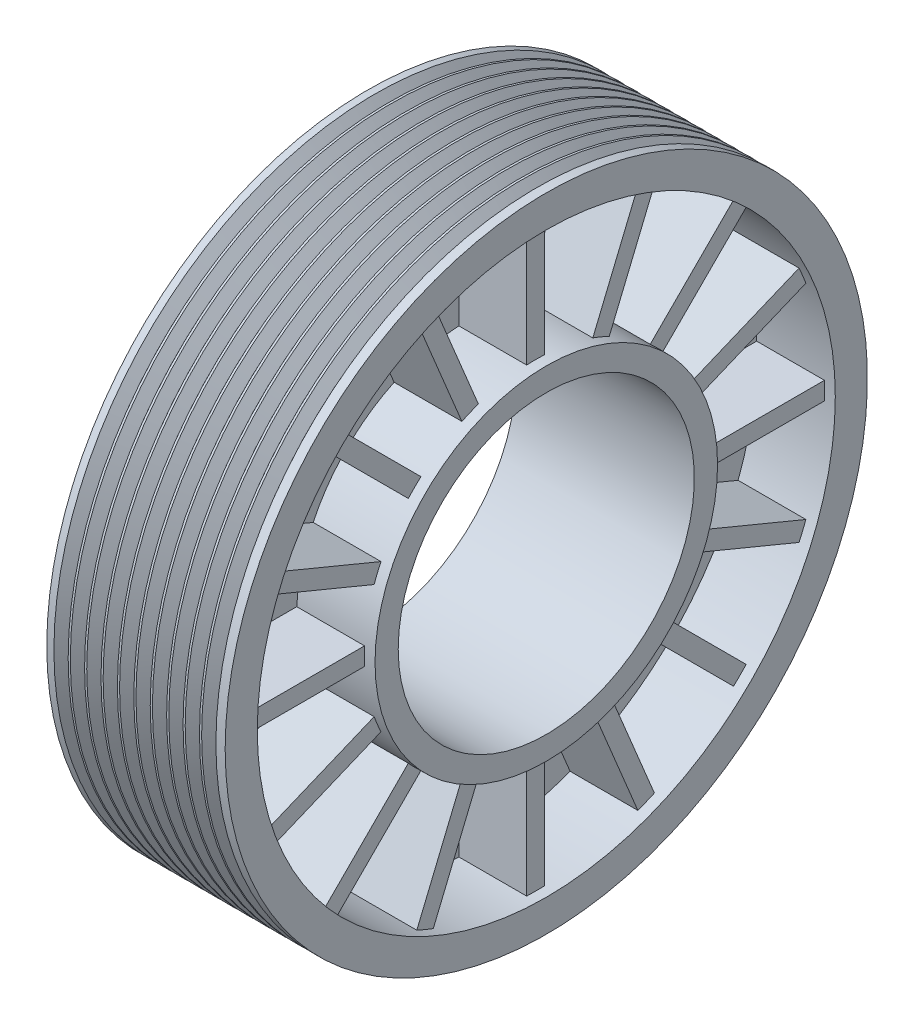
ISO-10303-21;
HEADER;
FILE_DESCRIPTION(('STEP AP214'),'2;1');
FILE_NAME('part.step','',(''),(''),'','','');
FILE_SCHEMA(('AUTOMOTIVE_DESIGN { 1 0 10303 214 1 1 1 1 }'));
ENDSEC;
DATA;
#1=APPLICATION_CONTEXT('core data for automotive mechanical design processes');
#2=APPLICATION_PROTOCOL_DEFINITION('international standard','automotive_design',2000,#1);
#3=PRODUCT_CONTEXT('',#1,'mechanical');
#4=PRODUCT('Part','Part','',(#3));
#5=PRODUCT_RELATED_PRODUCT_CATEGORY('part','',(#4));
#6=PRODUCT_DEFINITION_FORMATION('','',#4);
#7=PRODUCT_DEFINITION_CONTEXT('part definition',#1,'design');
#8=PRODUCT_DEFINITION('design','',#6,#7);
#9=PRODUCT_DEFINITION_SHAPE('','',#8);
#10=(LENGTH_UNIT() NAMED_UNIT(*) SI_UNIT(.MILLI.,.METRE.));
#11=(NAMED_UNIT(*) PLANE_ANGLE_UNIT() SI_UNIT($,.RADIAN.));
#12=(NAMED_UNIT(*) SI_UNIT($,.STERADIAN.) SOLID_ANGLE_UNIT());
#13=UNCERTAINTY_MEASURE_WITH_UNIT(LENGTH_MEASURE(1.E-05),#10,'distance_accuracy_value','');
#14=(GEOMETRIC_REPRESENTATION_CONTEXT(3) GLOBAL_UNCERTAINTY_ASSIGNED_CONTEXT((#13)) GLOBAL_UNIT_ASSIGNED_CONTEXT((#10,
#11,#12)) REPRESENTATION_CONTEXT('',''));
#15=CARTESIAN_POINT('',(0.,0.,0.));
#16=DIRECTION('',(0.,0.,1.));
#17=DIRECTION('',(1.,0.,0.));
#18=AXIS2_PLACEMENT_3D('',#15,#16,#17);
#19=CARTESIAN_POINT('',(-30.163219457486,-20.75,0.));
#20=DIRECTION('',(-1.,0.,0.));
#21=DIRECTION('',(0.,0.,1.));
#22=AXIS2_PLACEMENT_3D('',#19,#20,#21);
#23=CYLINDRICAL_SURFACE('',#22,45.);
#24=CARTESIAN_POINT('',(12.5,-20.75,0.));
#25=DIRECTION('',(-1.,0.,0.));
#26=DIRECTION('',(0.,0.,1.));
#27=AXIS2_PLACEMENT_3D('',#24,#25,#26);
#28=CIRCLE('',#27,45.);
#29=CARTESIAN_POINT('',(12.5,-20.75,45.));
#30=VERTEX_POINT('',#29);
#31=EDGE_CURVE('E889',#30,#30,#28,.T.);
#32=ORIENTED_EDGE('',*,*,#31,.T.);
#33=EDGE_LOOP('',(#32));
#34=FACE_BOUND('',#33,.T.);
#35=CARTESIAN_POINT('',(11.2,-20.75,0.));
#36=DIRECTION('',(-1.,0.,0.));
#37=DIRECTION('',(0.,0.,1.));
#38=AXIS2_PLACEMENT_3D('',#35,#36,#37);
#39=CIRCLE('',#38,45.);
#40=CARTESIAN_POINT('',(11.2,-20.75,45.));
#41=VERTEX_POINT('',#40);
#42=EDGE_CURVE('E3506',#41,#41,#39,.T.);
#43=ORIENTED_EDGE('',*,*,#42,.F.);
#44=EDGE_LOOP('',(#43));
#45=FACE_BOUND('',#44,.T.);
#46=ADVANCED_FACE('F49',(#34,#45),#23,.T.);
#47=CARTESIAN_POINT('',(8.9,-20.75,0.));
#48=DIRECTION('',(-1.,0.,0.));
#49=DIRECTION('',(0.,0.,1.));
#50=AXIS2_PLACEMENT_3D('',#47,#48,#49);
#51=CIRCLE('',#50,45.);
#52=CARTESIAN_POINT('',(8.9,-20.75,45.));
#53=VERTEX_POINT('',#52);
#54=EDGE_CURVE('E3517',#53,#53,#51,.T.);
#55=ORIENTED_EDGE('',*,*,#54,.F.);
#56=EDGE_LOOP('',(#55));
#57=FACE_BOUND('',#56,.T.);
#58=CARTESIAN_POINT('',(9.2,-20.75,0.));
#59=DIRECTION('',(-1.,0.,0.));
#60=DIRECTION('',(0.,0.,1.));
#61=AXIS2_PLACEMENT_3D('',#58,#59,#60);
#62=CIRCLE('',#61,45.);
#63=CARTESIAN_POINT('',(9.2,-20.75,45.));
#64=VERTEX_POINT('',#63);
#65=EDGE_CURVE('E3503',#64,#64,#62,.T.);
#66=ORIENTED_EDGE('',*,*,#65,.T.);
#67=EDGE_LOOP('',(#66));
#68=FACE_BOUND('',#67,.T.);
#69=ADVANCED_FACE('F1840',(#57,#68),#23,.T.);
#70=CARTESIAN_POINT('',(6.6,-20.75,0.));
#71=DIRECTION('',(-1.,0.,0.));
#72=DIRECTION('',(0.,0.,1.));
#73=AXIS2_PLACEMENT_3D('',#70,#71,#72);
#74=CIRCLE('',#73,45.);
#75=CARTESIAN_POINT('',(6.6,-20.75,45.));
#76=VERTEX_POINT('',#75);
#77=EDGE_CURVE('E3526',#76,#76,#74,.T.);
#78=ORIENTED_EDGE('',*,*,#77,.F.);
#79=EDGE_LOOP('',(#78));
#80=FACE_BOUND('',#79,.T.);
#81=CARTESIAN_POINT('',(6.9,-20.75,0.));
#82=DIRECTION('',(-1.,0.,0.));
#83=DIRECTION('',(0.,0.,1.));
#84=AXIS2_PLACEMENT_3D('',#81,#82,#83);
#85=CIRCLE('',#84,45.);
#86=CARTESIAN_POINT('',(6.9,-20.75,45.));
#87=VERTEX_POINT('',#86);
#88=EDGE_CURVE('E3511',#87,#87,#85,.T.);
#89=ORIENTED_EDGE('',*,*,#88,.T.);
#90=EDGE_LOOP('',(#89));
#91=FACE_BOUND('',#90,.T.);
#92=ADVANCED_FACE('F1846',(#80,#91),#23,.T.);
#93=CARTESIAN_POINT('',(4.3,-20.75,0.));
#94=DIRECTION('',(-1.,0.,0.));
#95=DIRECTION('',(0.,0.,1.));
#96=AXIS2_PLACEMENT_3D('',#93,#94,#95);
#97=CIRCLE('',#96,45.);
#98=CARTESIAN_POINT('',(4.3,-20.75,45.));
#99=VERTEX_POINT('',#98);
#100=EDGE_CURVE('E3535',#99,#99,#97,.T.);
#101=ORIENTED_EDGE('',*,*,#100,.F.);
#102=EDGE_LOOP('',(#101));
#103=FACE_BOUND('',#102,.T.);
#104=CARTESIAN_POINT('',(4.6,-20.75,0.));
#105=DIRECTION('',(-1.,0.,0.));
#106=DIRECTION('',(0.,0.,1.));
#107=AXIS2_PLACEMENT_3D('',#104,#105,#106);
#108=CIRCLE('',#107,45.);
#109=CARTESIAN_POINT('',(4.6,-20.75,45.));
#110=VERTEX_POINT('',#109);
#111=EDGE_CURVE('E3520',#110,#110,#108,.T.);
#112=ORIENTED_EDGE('',*,*,#111,.T.);
#113=EDGE_LOOP('',(#112));
#114=FACE_BOUND('',#113,.T.);
#115=ADVANCED_FACE('F3289',(#103,#114),#23,.T.);
#116=CARTESIAN_POINT('',(2.,-20.75,0.));
#117=DIRECTION('',(-1.,0.,0.));
#118=DIRECTION('',(0.,0.,1.));
#119=AXIS2_PLACEMENT_3D('',#116,#117,#118);
#120=CIRCLE('',#119,45.);
#121=CARTESIAN_POINT('',(2.,-20.75,45.));
#122=VERTEX_POINT('',#121);
#123=EDGE_CURVE('E3544',#122,#122,#120,.T.);
#124=ORIENTED_EDGE('',*,*,#123,.F.);
#125=EDGE_LOOP('',(#124));
#126=FACE_BOUND('',#125,.T.);
#127=CARTESIAN_POINT('',(2.3,-20.75,0.));
#128=DIRECTION('',(-1.,0.,0.));
#129=DIRECTION('',(0.,0.,1.));
#130=AXIS2_PLACEMENT_3D('',#127,#128,#129);
#131=CIRCLE('',#130,45.);
#132=CARTESIAN_POINT('',(2.3,-20.75,45.));
#133=VERTEX_POINT('',#132);
#134=EDGE_CURVE('E3529',#133,#133,#131,.T.);
#135=ORIENTED_EDGE('',*,*,#134,.T.);
#136=EDGE_LOOP('',(#135));
#137=FACE_BOUND('',#136,.T.);
#138=ADVANCED_FACE('F3281',(#126,#137),#23,.T.);
#139=CARTESIAN_POINT('',(-0.300000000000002,-20.75,0.));
#140=DIRECTION('',(-1.,0.,0.));
#141=DIRECTION('',(0.,0.,1.));
#142=AXIS2_PLACEMENT_3D('',#139,#140,#141);
#143=CIRCLE('',#142,45.);
#144=CARTESIAN_POINT('',(-0.300000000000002,-20.75,45.));
#145=VERTEX_POINT('',#144);
#146=EDGE_CURVE('E3553',#145,#145,#143,.T.);
#147=ORIENTED_EDGE('',*,*,#146,.F.);
#148=EDGE_LOOP('',(#147));
#149=FACE_BOUND('',#148,.T.);
#150=CARTESIAN_POINT('',(0.,-20.75,0.));
#151=DIRECTION('',(-1.,0.,0.));
#152=DIRECTION('',(0.,0.,1.));
#153=AXIS2_PLACEMENT_3D('',#150,#151,#152);
#154=CIRCLE('',#153,45.);
#155=CARTESIAN_POINT('',(0.,-20.75,45.));
#156=VERTEX_POINT('',#155);
#157=EDGE_CURVE('E3538',#156,#156,#154,.T.);
#158=ORIENTED_EDGE('',*,*,#157,.T.);
#159=EDGE_LOOP('',(#158));
#160=FACE_BOUND('',#159,.T.);
#161=ADVANCED_FACE('F3273',(#149,#160),#23,.T.);
#162=CARTESIAN_POINT('',(-2.6,-20.75,0.));
#163=DIRECTION('',(-1.,0.,0.));
#164=DIRECTION('',(0.,0.,1.));
#165=AXIS2_PLACEMENT_3D('',#162,#163,#164);
#166=CIRCLE('',#165,45.);
#167=CARTESIAN_POINT('',(-2.6,-20.75,45.));
#168=VERTEX_POINT('',#167);
#169=EDGE_CURVE('E3562',#168,#168,#166,.T.);
#170=ORIENTED_EDGE('',*,*,#169,.F.);
#171=EDGE_LOOP('',(#170));
#172=FACE_BOUND('',#171,.T.);
#173=CARTESIAN_POINT('',(-2.3,-20.75,0.));
#174=DIRECTION('',(-1.,0.,0.));
#175=DIRECTION('',(0.,0.,1.));
#176=AXIS2_PLACEMENT_3D('',#173,#174,#175);
#177=CIRCLE('',#176,45.);
#178=CARTESIAN_POINT('',(-2.3,-20.75,45.));
#179=VERTEX_POINT('',#178);
#180=EDGE_CURVE('E3547',#179,#179,#177,.T.);
#181=ORIENTED_EDGE('',*,*,#180,.T.);
#182=EDGE_LOOP('',(#181));
#183=FACE_BOUND('',#182,.T.);
#184=ADVANCED_FACE('F3265',(#172,#183),#23,.T.);
#185=CARTESIAN_POINT('',(-4.9,-20.75,0.));
#186=DIRECTION('',(-1.,0.,0.));
#187=DIRECTION('',(0.,0.,1.));
#188=AXIS2_PLACEMENT_3D('',#185,#186,#187);
#189=CIRCLE('',#188,45.);
#190=CARTESIAN_POINT('',(-4.9,-20.75,45.));
#191=VERTEX_POINT('',#190);
#192=EDGE_CURVE('E3571',#191,#191,#189,.T.);
#193=ORIENTED_EDGE('',*,*,#192,.F.);
#194=EDGE_LOOP('',(#193));
#195=FACE_BOUND('',#194,.T.);
#196=CARTESIAN_POINT('',(-4.6,-20.75,0.));
#197=DIRECTION('',(-1.,0.,0.));
#198=DIRECTION('',(0.,0.,1.));
#199=AXIS2_PLACEMENT_3D('',#196,#197,#198);
#200=CIRCLE('',#199,45.);
#201=CARTESIAN_POINT('',(-4.6,-20.75,45.));
#202=VERTEX_POINT('',#201);
#203=EDGE_CURVE('E3556',#202,#202,#200,.T.);
#204=ORIENTED_EDGE('',*,*,#203,.T.);
#205=EDGE_LOOP('',(#204));
#206=FACE_BOUND('',#205,.T.);
#207=ADVANCED_FACE('F3257',(#195,#206),#23,.T.);
#208=CARTESIAN_POINT('',(-7.2,-20.75,0.));
#209=DIRECTION('',(-1.,0.,0.));
#210=DIRECTION('',(0.,0.,1.));
#211=AXIS2_PLACEMENT_3D('',#208,#209,#210);
#212=CIRCLE('',#211,45.);
#213=CARTESIAN_POINT('',(-7.2,-20.75,45.));
#214=VERTEX_POINT('',#213);
#215=EDGE_CURVE('E1870',#214,#214,#212,.T.);
#216=ORIENTED_EDGE('',*,*,#215,.F.);
#217=EDGE_LOOP('',(#216));
#218=FACE_BOUND('',#217,.T.);
#219=CARTESIAN_POINT('',(-6.9,-20.75,0.));
#220=DIRECTION('',(-1.,0.,0.));
#221=DIRECTION('',(0.,0.,1.));
#222=AXIS2_PLACEMENT_3D('',#219,#220,#221);
#223=CIRCLE('',#222,45.);
#224=CARTESIAN_POINT('',(-6.9,-20.75,45.));
#225=VERTEX_POINT('',#224);
#226=EDGE_CURVE('E3565',#225,#225,#223,.T.);
#227=ORIENTED_EDGE('',*,*,#226,.T.);
#228=EDGE_LOOP('',(#227));
#229=FACE_BOUND('',#228,.T.);
#230=ADVANCED_FACE('F1861',(#218,#229),#23,.T.);
#231=CARTESIAN_POINT('',(-9.5,-20.75,0.));
#232=DIRECTION('',(-1.,0.,0.));
#233=DIRECTION('',(0.,0.,1.));
#234=AXIS2_PLACEMENT_3D('',#231,#232,#233);
#235=CIRCLE('',#234,45.);
#236=CARTESIAN_POINT('',(-9.5,-20.75,45.));
#237=VERTEX_POINT('',#236);
#238=EDGE_CURVE('E878',#237,#237,#235,.T.);
#239=ORIENTED_EDGE('',*,*,#238,.F.);
#240=EDGE_LOOP('',(#239));
#241=FACE_BOUND('',#240,.T.);
#242=CARTESIAN_POINT('',(-9.2,-20.75,0.));
#243=DIRECTION('',(-1.,0.,0.));
#244=DIRECTION('',(0.,0.,1.));
#245=AXIS2_PLACEMENT_3D('',#242,#243,#244);
#246=CIRCLE('',#245,45.);
#247=CARTESIAN_POINT('',(-9.2,-20.75,45.));
#248=VERTEX_POINT('',#247);
#249=EDGE_CURVE('E3574',#248,#248,#246,.T.);
#250=ORIENTED_EDGE('',*,*,#249,.T.);
#251=EDGE_LOOP('',(#250));
#252=FACE_BOUND('',#251,.T.);
#253=ADVANCED_FACE('F1851',(#241,#252),#23,.T.);
#254=CARTESIAN_POINT('',(-12.5,-20.75,0.));
#255=DIRECTION('',(-1.,0.,0.));
#256=DIRECTION('',(0.,0.,1.));
#257=AXIS2_PLACEMENT_3D('',#254,#255,#256);
#258=CIRCLE('',#257,45.);
#259=CARTESIAN_POINT('',(-12.5,-20.75,45.));
#260=VERTEX_POINT('',#259);
#261=EDGE_CURVE('E882',#260,#260,#258,.T.);
#262=ORIENTED_EDGE('',*,*,#261,.F.);
#263=EDGE_LOOP('',(#262));
#264=FACE_BOUND('',#263,.T.);
#265=CARTESIAN_POINT('',(-11.5,-20.75,0.));
#266=DIRECTION('',(-1.,0.,0.));
#267=DIRECTION('',(0.,0.,1.));
#268=AXIS2_PLACEMENT_3D('',#265,#266,#267);
#269=CIRCLE('',#268,45.);
#270=CARTESIAN_POINT('',(-11.5,-20.75,45.));
#271=VERTEX_POINT('',#270);
#272=EDGE_CURVE('E1867',#271,#271,#269,.T.);
#273=ORIENTED_EDGE('',*,*,#272,.T.);
#274=EDGE_LOOP('',(#273));
#275=FACE_BOUND('',#274,.T.);
#276=ADVANCED_FACE('F1842',(#264,#275),#23,.T.);
#277=CARTESIAN_POINT('',(-1.5,3.25,0.));
#278=DIRECTION('',(1.,0.,0.));
#279=DIRECTION('',(0.,0.,-1.));
#280=AXIS2_PLACEMENT_3D('',#277,#278,#279);
#281=PLANE('',#280);
#282=CARTESIAN_POINT('',(-1.5,5.05939751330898,-25.809397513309));
#283=DIRECTION('',(1.,0.,0.));
#284=DIRECTION('',(0.,0.,-1.));
#285=AXIS2_PLACEMENT_3D('',#282,#283,#284);
#286=CIRCLE('',#285,7.);
#287=CARTESIAN_POINT('',(-1.5,5.05939751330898,-32.809397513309));
#288=VERTEX_POINT('',#287);
#289=EDGE_CURVE('E1888',#288,#288,#286,.F.);
#290=ORIENTED_EDGE('',*,*,#289,.T.);
#291=EDGE_LOOP('',(#290));
#292=FACE_BOUND('',#291,.T.);
#293=ADVANCED_FACE('F1850',(#292),#281,.F.);
#294=DIRECTION('',(0.,0.923879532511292,-0.382683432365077));
#295=VECTOR('',#294,1.);
#296=CARTESIAN_POINT('',(-1.5,0.213635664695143,-7.33043195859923));
#297=LINE('',#296,#295);
#298=CARTESIAN_POINT('',(-1.5,1.87136844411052,-8.01708735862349));
#299=VERTEX_POINT('',#298);
#300=CARTESIAN_POINT('',(-1.5,17.1276493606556,-14.3364458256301));
#301=VERTEX_POINT('',#300);
#302=EDGE_CURVE('E1112',#299,#301,#297,.T.);
#303=ORIENTED_EDGE('',*,*,#302,.F.);
#304=CARTESIAN_POINT('',(-1.5,-20.75,0.));
#305=DIRECTION('',(-1.,0.,0.));
#306=DIRECTION('',(0.,0.,1.));
#307=AXIS2_PLACEMENT_3D('',#304,#305,#306);
#308=CIRCLE('',#307,24.);
#309=CARTESIAN_POINT('',(-1.5,3.21742581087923,-1.25));
#310=VERTEX_POINT('',#309);
#311=EDGE_CURVE('E897',#310,#299,#308,.T.);
#312=ORIENTED_EDGE('',*,*,#311,.F.);
#313=DIRECTION('',(0.,1.,0.));
#314=VECTOR('',#313,1.);
#315=CARTESIAN_POINT('',(-1.5,3.25,-1.25));
#316=LINE('',#315,#314);
#317=CARTESIAN_POINT('',(-1.5,19.7307052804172,-1.25));
#318=VERTEX_POINT('',#317);
#319=EDGE_CURVE('E1785',#310,#318,#316,.T.);
#320=ORIENTED_EDGE('',*,*,#319,.T.);
#321=CARTESIAN_POINT('',(-1.5,-20.75,0.));
#322=DIRECTION('',(-1.,0.,0.));
#323=DIRECTION('',(0.,0.,1.));
#324=AXIS2_PLACEMENT_3D('',#321,#322,#323);
#325=CIRCLE('',#324,40.5);
#326=EDGE_CURVE('E886',#318,#301,#325,.T.);
#327=ORIENTED_EDGE('',*,*,#326,.T.);
#328=EDGE_LOOP('',(#303,#312,#320,#327));
#329=FACE_BOUND('',#328,.T.);
#330=ADVANCED_FACE('F1857',(#329),#281,.F.);
#331=CARTESIAN_POINT('',(1.5,3.25,0.));
#332=DIRECTION('',(-1.,0.,0.));
#333=DIRECTION('',(0.,0.,1.));
#334=AXIS2_PLACEMENT_3D('',#331,#332,#333);
#335=PLANE('',#334);
#336=DIRECTION('',(0.,-0.923879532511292,0.382683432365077));
#337=VECTOR('',#336,1.);
#338=CARTESIAN_POINT('',(1.5,0.213635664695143,-7.33043195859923));
#339=LINE('',#338,#337);
#340=CARTESIAN_POINT('',(1.5,17.1276493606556,-14.3364458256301));
#341=VERTEX_POINT('',#340);
#342=CARTESIAN_POINT('',(1.5,1.87136844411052,-8.01708735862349));
#343=VERTEX_POINT('',#342);
#344=EDGE_CURVE('E1105',#341,#343,#339,.T.);
#345=ORIENTED_EDGE('',*,*,#344,.F.);
#346=CARTESIAN_POINT('',(1.5,-20.75,0.));
#347=DIRECTION('',(-1.,0.,0.));
#348=DIRECTION('',(0.,0.,1.));
#349=AXIS2_PLACEMENT_3D('',#346,#347,#348);
#350=CIRCLE('',#349,40.5);
#351=CARTESIAN_POINT('',(1.5,19.7307052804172,-1.25));
#352=VERTEX_POINT('',#351);
#353=EDGE_CURVE('E1809',#352,#341,#350,.T.);
#354=ORIENTED_EDGE('',*,*,#353,.F.);
#355=DIRECTION('',(0.,-1.,0.));
#356=VECTOR('',#355,1.);
#357=CARTESIAN_POINT('',(1.5,3.25,-1.25));
#358=LINE('',#357,#356);
#359=CARTESIAN_POINT('',(1.5,3.21742581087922,-1.25));
#360=VERTEX_POINT('',#359);
#361=EDGE_CURVE('E1778',#352,#360,#358,.T.);
#362=ORIENTED_EDGE('',*,*,#361,.T.);
#363=CARTESIAN_POINT('',(1.5,-20.75,0.));
#364=DIRECTION('',(-1.,0.,0.));
#365=DIRECTION('',(0.,0.,1.));
#366=AXIS2_PLACEMENT_3D('',#363,#364,#365);
#367=CIRCLE('',#366,24.);
#368=EDGE_CURVE('E1804',#360,#343,#367,.T.);
#369=ORIENTED_EDGE('',*,*,#368,.T.);
#370=EDGE_LOOP('',(#345,#354,#362,#369));
#371=FACE_BOUND('',#370,.T.);
#372=ADVANCED_FACE('F1837',(#371),#335,.F.);
#373=CARTESIAN_POINT('',(-1.5,16.1709407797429,-16.6461446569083));
#374=VERTEX_POINT('',#373);
#375=CARTESIAN_POINT('',(-1.5,12.9026699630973,-22.5332599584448));
#376=VERTEX_POINT('',#375);
#377=EDGE_CURVE('E895',#374,#376,#325,.T.);
#378=ORIENTED_EDGE('',*,*,#377,.T.);
#379=CARTESIAN_POINT('',(-1.5,5.05939751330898,-25.809397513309));
#380=DIRECTION('',(1.,0.,0.));
#381=DIRECTION('',(0.,0.,-1.));
#382=AXIS2_PLACEMENT_3D('',#379,#380,#381);
#383=CIRCLE('',#382,8.5);
#384=CARTESIAN_POINT('',(-1.5,-0.00177998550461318,-18.9804530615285));
#385=VERTEX_POINT('',#384);
#386=EDGE_CURVE('E870',#385,#376,#383,.F.);
#387=ORIENTED_EDGE('',*,*,#386,.F.);
#388=DIRECTION('',(0.,0.707106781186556,-0.707106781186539));
#389=VECTOR('',#388,1.);
#390=CARTESIAN_POINT('',(-1.5,-7.86611652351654,-11.1161165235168));
#391=LINE('',#390,#389);
#392=CARTESIAN_POINT('',(-1.5,-2.91858720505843,-16.0636458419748));
#393=VERTEX_POINT('',#392);
#394=EDGE_CURVE('E1146',#393,#385,#391,.T.);
#395=ORIENTED_EDGE('',*,*,#394,.F.);
#396=CARTESIAN_POINT('',(-1.5,0.914659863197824,-10.3267861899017));
#397=VERTEX_POINT('',#396);
#398=EDGE_CURVE('E901',#397,#393,#308,.T.);
#399=ORIENTED_EDGE('',*,*,#398,.F.);
#400=DIRECTION('',(0.,0.923879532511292,-0.382683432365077));
#401=VECTOR('',#400,1.);
#402=CARTESIAN_POINT('',(-1.5,-0.743072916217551,-9.64013078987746));
#403=LINE('',#402,#401);
#404=EDGE_CURVE('E1121',#397,#374,#403,.T.);
#405=ORIENTED_EDGE('',*,*,#404,.T.);
#406=EDGE_LOOP('',(#378,#387,#395,#399,#405));
#407=FACE_BOUND('',#406,.T.);
#408=ADVANCED_FACE('F2083',(#407),#281,.F.);
#409=CARTESIAN_POINT('',(1.5,16.1709407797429,-16.6461446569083));
#410=VERTEX_POINT('',#409);
#411=CARTESIAN_POINT('',(1.5,8.75806468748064,-27.7402977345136));
#412=VERTEX_POINT('',#411);
#413=EDGE_CURVE('E1813',#410,#412,#350,.T.);
#414=ORIENTED_EDGE('',*,*,#413,.F.);
#415=DIRECTION('',(0.,-0.923879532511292,0.382683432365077));
#416=VECTOR('',#415,1.);
#417=CARTESIAN_POINT('',(1.5,-0.743072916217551,-9.64013078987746));
#418=LINE('',#417,#416);
#419=CARTESIAN_POINT('',(1.5,0.914659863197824,-10.3267861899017));
#420=VERTEX_POINT('',#419);
#421=EDGE_CURVE('E1116',#410,#420,#418,.T.);
#422=ORIENTED_EDGE('',*,*,#421,.T.);
#423=CARTESIAN_POINT('',(1.5,-2.91858720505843,-16.0636458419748));
#424=VERTEX_POINT('',#423);
#425=EDGE_CURVE('E1808',#420,#424,#367,.T.);
#426=ORIENTED_EDGE('',*,*,#425,.T.);
#427=DIRECTION('',(0.,-0.707106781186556,0.707106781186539));
#428=VECTOR('',#427,1.);
#429=CARTESIAN_POINT('',(1.5,-7.86611652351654,-11.1161165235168));
#430=LINE('',#429,#428);
#431=EDGE_CURVE('E1140',#412,#424,#430,.T.);
#432=ORIENTED_EDGE('',*,*,#431,.F.);
#433=EDGE_LOOP('',(#414,#422,#426,#432));
#434=FACE_BOUND('',#433,.T.);
#435=ADVANCED_FACE('F1913',(#434),#335,.F.);
#436=DIRECTION('',(0.,0.707106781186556,-0.707106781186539));
#437=VECTOR('',#436,1.);
#438=CARTESIAN_POINT('',(-1.5,-9.63388347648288,-12.8838834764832));
#439=LINE('',#438,#437);
#440=CARTESIAN_POINT('',(-1.5,-4.68635415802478,-17.8314127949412));
#441=VERTEX_POINT('',#440);
#442=CARTESIAN_POINT('',(-1.5,-1.76954693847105,-20.7482200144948));
#443=VERTEX_POINT('',#442);
#444=EDGE_CURVE('E1156',#441,#443,#439,.T.);
#445=ORIENTED_EDGE('',*,*,#444,.T.);
#446=CARTESIAN_POINT('',(-1.5,1.78325995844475,-33.6526699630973));
#447=VERTEX_POINT('',#446);
#448=EDGE_CURVE('E72',#447,#443,#383,.F.);
#449=ORIENTED_EDGE('',*,*,#448,.F.);
#450=CARTESIAN_POINT('',(-1.5,-4.10385534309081,-36.9209407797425));
#451=VERTEX_POINT('',#450);
#452=EDGE_CURVE('E896',#447,#451,#325,.T.);
#453=ORIENTED_EDGE('',*,*,#452,.T.);
#454=DIRECTION('',(0.,0.3826834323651,-0.923879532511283));
#455=VECTOR('',#454,1.);
#456=CARTESIAN_POINT('',(-1.5,-16.0804319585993,-8.00692708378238));
#457=LINE('',#456,#455);
#458=CARTESIAN_POINT('',(-1.5,-10.4232138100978,-21.6646598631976));
#459=VERTEX_POINT('',#458);
#460=EDGE_CURVE('E1187',#459,#451,#457,.T.);
#461=ORIENTED_EDGE('',*,*,#460,.F.);
#462=EDGE_CURVE('E2092',#441,#459,#308,.T.);
#463=ORIENTED_EDGE('',*,*,#462,.F.);
#464=EDGE_LOOP('',(#445,#449,#453,#461,#463));
#465=FACE_BOUND('',#464,.T.);
#466=ADVANCED_FACE('F2210',(#465),#281,.F.);
#467=CARTESIAN_POINT('',(1.5,6.99029773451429,-29.50806468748));
#468=VERTEX_POINT('',#467);
#469=CARTESIAN_POINT('',(1.5,-4.10385534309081,-36.9209407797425));
#470=VERTEX_POINT('',#469);
#471=EDGE_CURVE('E1915',#468,#470,#350,.T.);
#472=ORIENTED_EDGE('',*,*,#471,.F.);
#473=DIRECTION('',(0.,-0.707106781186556,0.707106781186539));
#474=VECTOR('',#473,1.);
#475=CARTESIAN_POINT('',(1.5,-9.63388347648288,-12.8838834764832));
#476=LINE('',#475,#474);
#477=CARTESIAN_POINT('',(1.5,-4.68635415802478,-17.8314127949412));
#478=VERTEX_POINT('',#477);
#479=EDGE_CURVE('E1152',#468,#478,#476,.T.);
#480=ORIENTED_EDGE('',*,*,#479,.T.);
#481=CARTESIAN_POINT('',(1.5,-10.4232138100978,-21.6646598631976));
#482=VERTEX_POINT('',#481);
#483=EDGE_CURVE('E3840',#478,#482,#367,.T.);
#484=ORIENTED_EDGE('',*,*,#483,.T.);
#485=DIRECTION('',(0.,-0.3826834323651,0.923879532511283));
#486=VECTOR('',#485,1.);
#487=CARTESIAN_POINT('',(1.5,-16.0804319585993,-8.00692708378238));
#488=LINE('',#487,#486);
#489=EDGE_CURVE('E1178',#470,#482,#488,.T.);
#490=ORIENTED_EDGE('',*,*,#489,.F.);
#491=EDGE_LOOP('',(#472,#480,#484,#490));
#492=FACE_BOUND('',#491,.T.);
#493=ADVANCED_FACE('F2208',(#492),#335,.F.);
#494=CARTESIAN_POINT('',(-1.5,-12.732912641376,-22.6213684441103));
#495=VERTEX_POINT('',#494);
#496=CARTESIAN_POINT('',(-1.5,-19.4999999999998,-23.9674258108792));
#497=VERTEX_POINT('',#496);
#498=EDGE_CURVE('E2093',#495,#497,#308,.T.);
#499=ORIENTED_EDGE('',*,*,#498,.F.);
#500=DIRECTION('',(0.,0.3826834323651,-0.923879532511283));
#501=VECTOR('',#500,1.);
#502=CARTESIAN_POINT('',(-1.5,-18.3901307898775,-8.96363566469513));
#503=LINE('',#502,#501);
#504=CARTESIAN_POINT('',(-1.5,-6.41355417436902,-37.8776493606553));
#505=VERTEX_POINT('',#504);
#506=EDGE_CURVE('E1200',#495,#505,#503,.T.);
#507=ORIENTED_EDGE('',*,*,#506,.T.);
#508=CARTESIAN_POINT('',(-1.5,-19.4999999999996,-40.4807052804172));
#509=VERTEX_POINT('',#508);
#510=EDGE_CURVE('E2073',#505,#509,#325,.T.);
#511=ORIENTED_EDGE('',*,*,#510,.T.);
#512=DIRECTION('',(0.,0.,-1.));
#513=VECTOR('',#512,1.);
#514=CARTESIAN_POINT('',(-1.5,-19.5,-2.38293739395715E-13));
#515=LINE('',#514,#513);
#516=EDGE_CURVE('E1232',#497,#509,#515,.T.);
#517=ORIENTED_EDGE('',*,*,#516,.F.);
#518=EDGE_LOOP('',(#499,#507,#511,#517));
#519=FACE_BOUND('',#518,.T.);
#520=ADVANCED_FACE('F2203',(#519),#281,.F.);
#521=CARTESIAN_POINT('',(1.5,-6.41355417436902,-37.8776493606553));
#522=VERTEX_POINT('',#521);
#523=CARTESIAN_POINT('',(1.5,-19.4999999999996,-40.4807052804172));
#524=VERTEX_POINT('',#523);
#525=EDGE_CURVE('E1916',#522,#524,#350,.T.);
#526=ORIENTED_EDGE('',*,*,#525,.F.);
#527=DIRECTION('',(0.,-0.3826834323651,0.923879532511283));
#528=VECTOR('',#527,1.);
#529=CARTESIAN_POINT('',(1.5,-18.3901307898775,-8.96363566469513));
#530=LINE('',#529,#528);
#531=CARTESIAN_POINT('',(1.5,-12.732912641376,-22.6213684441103));
#532=VERTEX_POINT('',#531);
#533=EDGE_CURVE('E1193',#522,#532,#530,.T.);
#534=ORIENTED_EDGE('',*,*,#533,.T.);
#535=CARTESIAN_POINT('',(1.5,-19.4999999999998,-23.9674258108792));
#536=VERTEX_POINT('',#535);
#537=EDGE_CURVE('E3841',#532,#536,#367,.T.);
#538=ORIENTED_EDGE('',*,*,#537,.T.);
#539=DIRECTION('',(0.,0.,1.));
#540=VECTOR('',#539,1.);
#541=CARTESIAN_POINT('',(1.5,-19.5,-2.38293739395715E-13));
#542=LINE('',#541,#540);
#543=EDGE_CURVE('E1223',#524,#536,#542,.T.);
#544=ORIENTED_EDGE('',*,*,#543,.F.);
#545=EDGE_LOOP('',(#526,#534,#538,#544));
#546=FACE_BOUND('',#545,.T.);
#547=ADVANCED_FACE('F2201',(#546),#335,.F.);
#548=CARTESIAN_POINT('',(-1.5,-21.9999999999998,-23.9674258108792));
#549=VERTEX_POINT('',#548);
#550=CARTESIAN_POINT('',(-1.5,-28.7670873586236,-22.6213684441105));
#551=VERTEX_POINT('',#550);
#552=EDGE_CURVE('E2096',#549,#551,#308,.T.);
#553=ORIENTED_EDGE('',*,*,#552,.F.);
#554=DIRECTION('',(0.,0.,-1.));
#555=VECTOR('',#554,1.);
#556=CARTESIAN_POINT('',(-1.5,-22.,-2.64479864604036E-13));
#557=LINE('',#556,#555);
#558=CARTESIAN_POINT('',(-1.5,-21.9999999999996,-40.4807052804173));
#559=VERTEX_POINT('',#558);
#560=EDGE_CURVE('E1245',#549,#559,#557,.T.);
#561=ORIENTED_EDGE('',*,*,#560,.T.);
#562=CARTESIAN_POINT('',(-1.5,-35.0864458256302,-37.8776493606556));
#563=VERTEX_POINT('',#562);
#564=EDGE_CURVE('E2069',#559,#563,#325,.T.);
#565=ORIENTED_EDGE('',*,*,#564,.T.);
#566=DIRECTION('',(0.,-0.382683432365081,-0.923879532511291));
#567=VECTOR('',#566,1.);
#568=CARTESIAN_POINT('',(-1.5,-16.0804319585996,8.00692708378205));
#569=LINE('',#568,#567);
#570=EDGE_CURVE('E1277',#551,#563,#569,.T.);
#571=ORIENTED_EDGE('',*,*,#570,.F.);
#572=EDGE_LOOP('',(#553,#561,#565,#571));
#573=FACE_BOUND('',#572,.T.);
#574=ADVANCED_FACE('F2196',(#573),#281,.F.);
#575=CARTESIAN_POINT('',(1.5,-21.9999999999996,-40.4807052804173));
#576=VERTEX_POINT('',#575);
#577=CARTESIAN_POINT('',(1.5,-35.0864458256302,-37.8776493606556));
#578=VERTEX_POINT('',#577);
#579=EDGE_CURVE('E1919',#576,#578,#350,.T.);
#580=ORIENTED_EDGE('',*,*,#579,.F.);
#581=DIRECTION('',(0.,0.,1.));
#582=VECTOR('',#581,1.);
#583=CARTESIAN_POINT('',(1.5,-22.,-2.64479864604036E-13));
#584=LINE('',#583,#582);
#585=CARTESIAN_POINT('',(1.5,-21.9999999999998,-23.9674258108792));
#586=VERTEX_POINT('',#585);
#587=EDGE_CURVE('E1238',#576,#586,#584,.T.);
#588=ORIENTED_EDGE('',*,*,#587,.T.);
#589=CARTESIAN_POINT('',(1.5,-28.7670873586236,-22.6213684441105));
#590=VERTEX_POINT('',#589);
#591=EDGE_CURVE('E3842',#586,#590,#367,.T.);
#592=ORIENTED_EDGE('',*,*,#591,.T.);
#593=DIRECTION('',(0.,0.382683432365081,0.923879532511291));
#594=VECTOR('',#593,1.);
#595=CARTESIAN_POINT('',(1.5,-16.0804319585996,8.00692708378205));
#596=LINE('',#595,#594);
#597=EDGE_CURVE('E1268',#578,#590,#596,.T.);
#598=ORIENTED_EDGE('',*,*,#597,.F.);
#599=EDGE_LOOP('',(#580,#588,#592,#598));
#600=FACE_BOUND('',#599,.T.);
#601=ADVANCED_FACE('F2194',(#600),#335,.F.);
#602=CARTESIAN_POINT('',(-1.5,-31.0767861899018,-21.6646598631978));
#603=VERTEX_POINT('',#602);
#604=CARTESIAN_POINT('',(-1.5,-36.8136458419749,-17.8314127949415));
#605=VERTEX_POINT('',#604);
#606=EDGE_CURVE('E2099',#603,#605,#308,.T.);
#607=ORIENTED_EDGE('',*,*,#606,.F.);
#608=DIRECTION('',(0.,-0.382683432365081,-0.923879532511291));
#609=VECTOR('',#608,1.);
#610=CARTESIAN_POINT('',(-1.5,-18.3901307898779,8.96363566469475));
#611=LINE('',#610,#609);
#612=CARTESIAN_POINT('',(-1.5,-37.3961446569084,-36.9209407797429));
#613=VERTEX_POINT('',#612);
#614=EDGE_CURVE('E1290',#603,#613,#611,.T.);
#615=ORIENTED_EDGE('',*,*,#614,.T.);
#616=CARTESIAN_POINT('',(-1.5,-48.4902977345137,-29.5080646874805));
#617=VERTEX_POINT('',#616);
#618=EDGE_CURVE('E2065',#613,#617,#325,.T.);
#619=ORIENTED_EDGE('',*,*,#618,.T.);
#620=DIRECTION('',(0.,-0.707106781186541,-0.707106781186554));
#621=VECTOR('',#620,1.);
#622=CARTESIAN_POINT('',(-1.5,-7.86611652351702,11.1161165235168));
#623=LINE('',#622,#621);
#624=EDGE_CURVE('E1322',#605,#617,#623,.T.);
#625=ORIENTED_EDGE('',*,*,#624,.F.);
#626=EDGE_LOOP('',(#607,#615,#619,#625));
#627=FACE_BOUND('',#626,.T.);
#628=ADVANCED_FACE('F2189',(#627),#281,.F.);
#629=CARTESIAN_POINT('',(1.5,-37.3961446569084,-36.9209407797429));
#630=VERTEX_POINT('',#629);
#631=CARTESIAN_POINT('',(1.5,-48.4902977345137,-29.5080646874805));
#632=VERTEX_POINT('',#631);
#633=EDGE_CURVE('E1922',#630,#632,#350,.T.);
#634=ORIENTED_EDGE('',*,*,#633,.F.);
#635=DIRECTION('',(0.,0.382683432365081,0.923879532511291));
#636=VECTOR('',#635,1.);
#637=CARTESIAN_POINT('',(1.5,-18.3901307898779,8.96363566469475));
#638=LINE('',#637,#636);
#639=CARTESIAN_POINT('',(1.5,-31.0767861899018,-21.6646598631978));
#640=VERTEX_POINT('',#639);
#641=EDGE_CURVE('E1283',#630,#640,#638,.T.);
#642=ORIENTED_EDGE('',*,*,#641,.T.);
#643=CARTESIAN_POINT('',(1.5,-36.8136458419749,-17.8314127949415));
#644=VERTEX_POINT('',#643);
#645=EDGE_CURVE('E3845',#640,#644,#367,.T.);
#646=ORIENTED_EDGE('',*,*,#645,.T.);
#647=DIRECTION('',(0.,0.707106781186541,0.707106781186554));
#648=VECTOR('',#647,1.);
#649=CARTESIAN_POINT('',(1.5,-7.86611652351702,11.1161165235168));
#650=LINE('',#649,#648);
#651=EDGE_CURVE('E1313',#632,#644,#650,.T.);
#652=ORIENTED_EDGE('',*,*,#651,.F.);
#653=EDGE_LOOP('',(#634,#642,#646,#652));
#654=FACE_BOUND('',#653,.T.);
#655=ADVANCED_FACE('F2187',(#654),#335,.F.);
#656=CARTESIAN_POINT('',(-1.5,-38.5814127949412,-16.0636458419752));
#657=VERTEX_POINT('',#656);
#658=CARTESIAN_POINT('',(-1.5,-42.4146598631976,-10.3267861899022));
#659=VERTEX_POINT('',#658);
#660=EDGE_CURVE('E2102',#657,#659,#308,.T.);
#661=ORIENTED_EDGE('',*,*,#660,.F.);
#662=DIRECTION('',(0.,-0.707106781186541,-0.707106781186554));
#663=VECTOR('',#662,1.);
#664=CARTESIAN_POINT('',(-1.5,-9.63388347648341,12.8838834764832));
#665=LINE('',#664,#663);
#666=CARTESIAN_POINT('',(-1.5,-50.2580646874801,-27.7402977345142));
#667=VERTEX_POINT('',#666);
#668=EDGE_CURVE('E1335',#657,#667,#665,.T.);
#669=ORIENTED_EDGE('',*,*,#668,.T.);
#670=CARTESIAN_POINT('',(-1.5,-57.6709407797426,-16.6461446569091));
#671=VERTEX_POINT('',#670);
#672=EDGE_CURVE('E2061',#667,#671,#325,.T.);
#673=ORIENTED_EDGE('',*,*,#672,.T.);
#674=DIRECTION('',(0.,-0.923879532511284,-0.382683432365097));
#675=VECTOR('',#674,1.);
#676=CARTESIAN_POINT('',(-1.5,0.213635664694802,7.3304319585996));
#677=LINE('',#676,#675);
#678=EDGE_CURVE('E1367',#659,#671,#677,.T.);
#679=ORIENTED_EDGE('',*,*,#678,.F.);
#680=EDGE_LOOP('',(#661,#669,#673,#679));
#681=FACE_BOUND('',#680,.T.);
#682=ADVANCED_FACE('F2182',(#681),#281,.F.);
#683=CARTESIAN_POINT('',(1.5,-50.2580646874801,-27.7402977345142));
#684=VERTEX_POINT('',#683);
#685=CARTESIAN_POINT('',(1.5,-57.6709407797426,-16.6461446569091));
#686=VERTEX_POINT('',#685);
#687=EDGE_CURVE('E1925',#684,#686,#350,.T.);
#688=ORIENTED_EDGE('',*,*,#687,.F.);
#689=DIRECTION('',(0.,0.707106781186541,0.707106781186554));
#690=VECTOR('',#689,1.);
#691=CARTESIAN_POINT('',(1.5,-9.63388347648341,12.8838834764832));
#692=LINE('',#691,#690);
#693=CARTESIAN_POINT('',(1.5,-38.5814127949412,-16.0636458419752));
#694=VERTEX_POINT('',#693);
#695=EDGE_CURVE('E1328',#684,#694,#692,.T.);
#696=ORIENTED_EDGE('',*,*,#695,.T.);
#697=CARTESIAN_POINT('',(1.5,-42.4146598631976,-10.3267861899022));
#698=VERTEX_POINT('',#697);
#699=EDGE_CURVE('E3848',#694,#698,#367,.T.);
#700=ORIENTED_EDGE('',*,*,#699,.T.);
#701=DIRECTION('',(0.,0.923879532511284,0.382683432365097));
#702=VECTOR('',#701,1.);
#703=CARTESIAN_POINT('',(1.5,0.213635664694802,7.3304319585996));
#704=LINE('',#703,#702);
#705=EDGE_CURVE('E1358',#686,#698,#704,.T.);
#706=ORIENTED_EDGE('',*,*,#705,.F.);
#707=EDGE_LOOP('',(#688,#696,#700,#706));
#708=FACE_BOUND('',#707,.T.);
#709=ADVANCED_FACE('F2180',(#708),#335,.F.);
#710=CARTESIAN_POINT('',(-1.5,-43.3713684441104,-8.01708735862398));
#711=VERTEX_POINT('',#710);
#712=CARTESIAN_POINT('',(-1.5,-44.7174258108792,-1.25000000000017));
#713=VERTEX_POINT('',#712);
#714=EDGE_CURVE('E2105',#711,#713,#308,.T.);
#715=ORIENTED_EDGE('',*,*,#714,.F.);
#716=DIRECTION('',(0.,-0.923879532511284,-0.382683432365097));
#717=VECTOR('',#716,1.);
#718=CARTESIAN_POINT('',(-1.5,-0.74307291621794,9.64013078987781));
#719=LINE('',#718,#717);
#720=CARTESIAN_POINT('',(-1.5,-58.6276493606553,-14.3364458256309));
#721=VERTEX_POINT('',#720);
#722=EDGE_CURVE('E1380',#711,#721,#719,.T.);
#723=ORIENTED_EDGE('',*,*,#722,.T.);
#724=CARTESIAN_POINT('',(-1.5,-61.2307052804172,-1.25000000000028));
#725=VERTEX_POINT('',#724);
#726=EDGE_CURVE('E2057',#721,#725,#325,.T.);
#727=ORIENTED_EDGE('',*,*,#726,.T.);
#728=DIRECTION('',(0.,-1.,0.));
#729=VECTOR('',#728,1.);
#730=CARTESIAN_POINT('',(-1.5,3.25,-1.24999999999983));
#731=LINE('',#730,#729);
#732=EDGE_CURVE('E1412',#713,#725,#731,.T.);
#733=ORIENTED_EDGE('',*,*,#732,.F.);
#734=EDGE_LOOP('',(#715,#723,#727,#733));
#735=FACE_BOUND('',#734,.T.);
#736=ADVANCED_FACE('F2175',(#735),#281,.F.);
#737=CARTESIAN_POINT('',(1.5,-58.6276493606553,-14.3364458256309));
#738=VERTEX_POINT('',#737);
#739=CARTESIAN_POINT('',(1.5,-61.2307052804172,-1.25000000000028));
#740=VERTEX_POINT('',#739);
#741=EDGE_CURVE('E1928',#738,#740,#350,.T.);
#742=ORIENTED_EDGE('',*,*,#741,.F.);
#743=DIRECTION('',(0.,0.923879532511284,0.382683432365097));
#744=VECTOR('',#743,1.);
#745=CARTESIAN_POINT('',(1.5,-0.74307291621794,9.64013078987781));
#746=LINE('',#745,#744);
#747=CARTESIAN_POINT('',(1.5,-43.3713684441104,-8.01708735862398));
#748=VERTEX_POINT('',#747);
#749=EDGE_CURVE('E1373',#738,#748,#746,.T.);
#750=ORIENTED_EDGE('',*,*,#749,.T.);
#751=CARTESIAN_POINT('',(1.5,-44.7174258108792,-1.25000000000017));
#752=VERTEX_POINT('',#751);
#753=EDGE_CURVE('E3851',#748,#752,#367,.T.);
#754=ORIENTED_EDGE('',*,*,#753,.T.);
#755=DIRECTION('',(0.,1.,0.));
#756=VECTOR('',#755,1.);
#757=CARTESIAN_POINT('',(1.5,3.25,-1.24999999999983));
#758=LINE('',#757,#756);
#759=EDGE_CURVE('E1403',#740,#752,#758,.T.);
#760=ORIENTED_EDGE('',*,*,#759,.F.);
#761=EDGE_LOOP('',(#742,#750,#754,#760));
#762=FACE_BOUND('',#761,.T.);
#763=ADVANCED_FACE('F2173',(#762),#335,.F.);
#764=CARTESIAN_POINT('',(-1.5,-44.7174258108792,1.24999999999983));
#765=VERTEX_POINT('',#764);
#766=CARTESIAN_POINT('',(-1.5,-43.3713684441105,8.01708735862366));
#767=VERTEX_POINT('',#766);
#768=EDGE_CURVE('E2108',#765,#767,#308,.T.);
#769=ORIENTED_EDGE('',*,*,#768,.F.);
#770=DIRECTION('',(0.,-1.,0.));
#771=VECTOR('',#770,1.);
#772=CARTESIAN_POINT('',(-1.5,3.24999999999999,1.25000000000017));
#773=LINE('',#772,#771);
#774=CARTESIAN_POINT('',(-1.5,-61.2307052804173,1.24999999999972));
#775=VERTEX_POINT('',#774);
#776=EDGE_CURVE('E1425',#765,#775,#773,.T.);
#777=ORIENTED_EDGE('',*,*,#776,.T.);
#778=CARTESIAN_POINT('',(-1.5,-58.6276493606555,14.3364458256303));
#779=VERTEX_POINT('',#778);
#780=EDGE_CURVE('E2053',#775,#779,#325,.T.);
#781=ORIENTED_EDGE('',*,*,#780,.T.);
#782=DIRECTION('',(0.,-0.923879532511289,0.382683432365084));
#783=VECTOR('',#782,1.);
#784=CARTESIAN_POINT('',(-1.5,-0.743072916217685,-9.64013078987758));
#785=LINE('',#784,#783);
#786=EDGE_CURVE('E1457',#767,#779,#785,.T.);
#787=ORIENTED_EDGE('',*,*,#786,.F.);
#788=EDGE_LOOP('',(#769,#777,#781,#787));
#789=FACE_BOUND('',#788,.T.);
#790=ADVANCED_FACE('F2168',(#789),#281,.F.);
#791=CARTESIAN_POINT('',(1.5,-61.2307052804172,1.24999999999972));
#792=VERTEX_POINT('',#791);
#793=CARTESIAN_POINT('',(1.5,-58.6276493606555,14.3364458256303));
#794=VERTEX_POINT('',#793);
#795=EDGE_CURVE('E1931',#792,#794,#350,.T.);
#796=ORIENTED_EDGE('',*,*,#795,.F.);
#797=DIRECTION('',(0.,1.,0.));
#798=VECTOR('',#797,1.);
#799=CARTESIAN_POINT('',(1.5,3.24999999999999,1.25000000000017));
#800=LINE('',#799,#798);
#801=CARTESIAN_POINT('',(1.5,-44.7174258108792,1.24999999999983));
#802=VERTEX_POINT('',#801);
#803=EDGE_CURVE('E1418',#792,#802,#800,.T.);
#804=ORIENTED_EDGE('',*,*,#803,.T.);
#805=CARTESIAN_POINT('',(1.5,-43.3713684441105,8.01708735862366));
#806=VERTEX_POINT('',#805);
#807=EDGE_CURVE('E3854',#802,#806,#367,.T.);
#808=ORIENTED_EDGE('',*,*,#807,.T.);
#809=DIRECTION('',(0.,0.923879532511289,-0.382683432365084));
#810=VECTOR('',#809,1.);
#811=CARTESIAN_POINT('',(1.5,-0.743072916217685,-9.64013078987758));
#812=LINE('',#811,#810);
#813=EDGE_CURVE('E1448',#794,#806,#812,.T.);
#814=ORIENTED_EDGE('',*,*,#813,.F.);
#815=EDGE_LOOP('',(#796,#804,#808,#814));
#816=FACE_BOUND('',#815,.T.);
#817=ADVANCED_FACE('F2166',(#816),#335,.F.);
#818=CARTESIAN_POINT('',(-1.5,-42.4146598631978,10.3267861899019));
#819=VERTEX_POINT('',#818);
#820=CARTESIAN_POINT('',(-1.5,-38.5814127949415,16.0636458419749));
#821=VERTEX_POINT('',#820);
#822=EDGE_CURVE('E2111',#819,#821,#308,.T.);
#823=ORIENTED_EDGE('',*,*,#822,.F.);
#824=DIRECTION('',(0.,-0.923879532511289,0.382683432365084));
#825=VECTOR('',#824,1.);
#826=CARTESIAN_POINT('',(-1.5,0.213635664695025,-7.33043195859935));
#827=LINE('',#826,#825);
#828=CARTESIAN_POINT('',(-1.5,-57.6709407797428,16.6461446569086));
#829=VERTEX_POINT('',#828);
#830=EDGE_CURVE('E1470',#819,#829,#827,.T.);
#831=ORIENTED_EDGE('',*,*,#830,.T.);
#832=CARTESIAN_POINT('',(-1.5,-50.2580646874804,27.7402977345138));
#833=VERTEX_POINT('',#832);
#834=EDGE_CURVE('E2049',#829,#833,#325,.T.);
#835=ORIENTED_EDGE('',*,*,#834,.T.);
#836=DIRECTION('',(0.,-0.707106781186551,0.707106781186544));
#837=VECTOR('',#836,1.);
#838=CARTESIAN_POINT('',(-1.5,-9.63388347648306,-12.8838834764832));
#839=LINE('',#838,#837);
#840=EDGE_CURVE('E1502',#821,#833,#839,.T.);
#841=ORIENTED_EDGE('',*,*,#840,.F.);
#842=EDGE_LOOP('',(#823,#831,#835,#841));
#843=FACE_BOUND('',#842,.T.);
#844=ADVANCED_FACE('F2161',(#843),#281,.F.);
#845=CARTESIAN_POINT('',(1.5,-57.6709407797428,16.6461446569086));
#846=VERTEX_POINT('',#845);
#847=CARTESIAN_POINT('',(1.5,-50.2580646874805,27.7402977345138));
#848=VERTEX_POINT('',#847);
#849=EDGE_CURVE('E1934',#846,#848,#350,.T.);
#850=ORIENTED_EDGE('',*,*,#849,.F.);
#851=DIRECTION('',(0.,0.923879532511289,-0.382683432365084));
#852=VECTOR('',#851,1.);
#853=CARTESIAN_POINT('',(1.5,0.213635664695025,-7.33043195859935));
#854=LINE('',#853,#852);
#855=CARTESIAN_POINT('',(1.5,-42.4146598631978,10.3267861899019));
#856=VERTEX_POINT('',#855);
#857=EDGE_CURVE('E1463',#846,#856,#854,.T.);
#858=ORIENTED_EDGE('',*,*,#857,.T.);
#859=CARTESIAN_POINT('',(1.5,-38.5814127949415,16.0636458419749));
#860=VERTEX_POINT('',#859);
#861=EDGE_CURVE('E3857',#856,#860,#367,.T.);
#862=ORIENTED_EDGE('',*,*,#861,.T.);
#863=DIRECTION('',(0.,0.707106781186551,-0.707106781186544));
#864=VECTOR('',#863,1.);
#865=CARTESIAN_POINT('',(1.5,-9.63388347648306,-12.8838834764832));
#866=LINE('',#865,#864);
#867=EDGE_CURVE('E1493',#848,#860,#866,.T.);
#868=ORIENTED_EDGE('',*,*,#867,.F.);
#869=EDGE_LOOP('',(#850,#858,#862,#868));
#870=FACE_BOUND('',#869,.T.);
#871=ADVANCED_FACE('F2159',(#870),#335,.F.);
#872=CARTESIAN_POINT('',(-1.5,-36.8136458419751,17.8314127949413));
#873=VERTEX_POINT('',#872);
#874=CARTESIAN_POINT('',(-1.5,-31.0767861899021,21.6646598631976));
#875=VERTEX_POINT('',#874);
#876=EDGE_CURVE('E2114',#873,#875,#308,.T.);
#877=ORIENTED_EDGE('',*,*,#876,.F.);
#878=DIRECTION('',(0.,-0.707106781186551,0.707106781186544));
#879=VECTOR('',#878,1.);
#880=CARTESIAN_POINT('',(-1.5,-7.8661165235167,-11.1161165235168));
#881=LINE('',#880,#879);
#882=CARTESIAN_POINT('',(-1.5,-48.4902977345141,29.5080646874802));
#883=VERTEX_POINT('',#882);
#884=EDGE_CURVE('E1515',#873,#883,#881,.T.);
#885=ORIENTED_EDGE('',*,*,#884,.T.);
#886=CARTESIAN_POINT('',(-1.5,-37.396144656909,36.9209407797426));
#887=VERTEX_POINT('',#886);
#888=EDGE_CURVE('E2045',#883,#887,#325,.T.);
#889=ORIENTED_EDGE('',*,*,#888,.T.);
#890=DIRECTION('',(0.,-0.382683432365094,0.923879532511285));
#891=VECTOR('',#890,1.);
#892=CARTESIAN_POINT('',(-1.5,-18.3901307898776,-8.96363566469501));
#893=LINE('',#892,#891);
#894=EDGE_CURVE('E1547',#875,#887,#893,.T.);
#895=ORIENTED_EDGE('',*,*,#894,.F.);
#896=EDGE_LOOP('',(#877,#885,#889,#895));
#897=FACE_BOUND('',#896,.T.);
#898=ADVANCED_FACE('F2154',(#897),#281,.F.);
#899=CARTESIAN_POINT('',(1.5,-48.4902977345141,29.5080646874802));
#900=VERTEX_POINT('',#899);
#901=CARTESIAN_POINT('',(1.5,-37.396144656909,36.9209407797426));
#902=VERTEX_POINT('',#901);
#903=EDGE_CURVE('E1937',#900,#902,#350,.T.);
#904=ORIENTED_EDGE('',*,*,#903,.F.);
#905=DIRECTION('',(0.,0.707106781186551,-0.707106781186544));
#906=VECTOR('',#905,1.);
#907=CARTESIAN_POINT('',(1.5,-7.8661165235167,-11.1161165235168));
#908=LINE('',#907,#906);
#909=CARTESIAN_POINT('',(1.5,-36.8136458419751,17.8314127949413));
#910=VERTEX_POINT('',#909);
#911=EDGE_CURVE('E1508',#900,#910,#908,.T.);
#912=ORIENTED_EDGE('',*,*,#911,.T.);
#913=CARTESIAN_POINT('',(1.5,-31.0767861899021,21.6646598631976));
#914=VERTEX_POINT('',#913);
#915=EDGE_CURVE('E3860',#910,#914,#367,.T.);
#916=ORIENTED_EDGE('',*,*,#915,.T.);
#917=DIRECTION('',(0.,0.382683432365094,-0.923879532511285));
#918=VECTOR('',#917,1.);
#919=CARTESIAN_POINT('',(1.5,-18.3901307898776,-8.96363566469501));
#920=LINE('',#919,#918);
#921=EDGE_CURVE('E1538',#902,#914,#920,.T.);
#922=ORIENTED_EDGE('',*,*,#921,.F.);
#923=EDGE_LOOP('',(#904,#912,#916,#922));
#924=FACE_BOUND('',#923,.T.);
#925=ADVANCED_FACE('F2152',(#924),#335,.F.);
#926=CARTESIAN_POINT('',(-1.5,-28.7670873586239,22.6213684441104));
#927=VERTEX_POINT('',#926);
#928=CARTESIAN_POINT('',(-1.5,-22.0000000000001,23.9674258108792));
#929=VERTEX_POINT('',#928);
#930=EDGE_CURVE('E2117',#927,#929,#308,.T.);
#931=ORIENTED_EDGE('',*,*,#930,.F.);
#932=DIRECTION('',(0.,-0.382683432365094,0.923879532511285));
#933=VECTOR('',#932,1.);
#934=CARTESIAN_POINT('',(-1.5,-16.0804319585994,-8.00692708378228));
#935=LINE('',#934,#933);
#936=CARTESIAN_POINT('',(-1.5,-35.0864458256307,37.8776493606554));
#937=VERTEX_POINT('',#936);
#938=EDGE_CURVE('E1560',#927,#937,#935,.T.);
#939=ORIENTED_EDGE('',*,*,#938,.T.);
#940=CARTESIAN_POINT('',(-1.5,-22.0000000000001,40.4807052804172));
#941=VERTEX_POINT('',#940);
#942=EDGE_CURVE('E2041',#937,#941,#325,.T.);
#943=ORIENTED_EDGE('',*,*,#942,.T.);
#944=DIRECTION('',(0.,0.,1.));
#945=VECTOR('',#944,1.);
#946=CARTESIAN_POINT('',(-1.5,-22.,0.));
#947=LINE('',#946,#945);
#948=EDGE_CURVE('E1592',#929,#941,#947,.T.);
#949=ORIENTED_EDGE('',*,*,#948,.F.);
#950=EDGE_LOOP('',(#931,#939,#943,#949));
#951=FACE_BOUND('',#950,.T.);
#952=ADVANCED_FACE('F2147',(#951),#281,.F.);
#953=CARTESIAN_POINT('',(1.5,-35.0864458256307,37.8776493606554));
#954=VERTEX_POINT('',#953);
#955=CARTESIAN_POINT('',(1.5,-22.0000000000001,40.4807052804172));
#956=VERTEX_POINT('',#955);
#957=EDGE_CURVE('E1940',#954,#956,#350,.T.);
#958=ORIENTED_EDGE('',*,*,#957,.F.);
#959=DIRECTION('',(0.,0.382683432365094,-0.923879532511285));
#960=VECTOR('',#959,1.);
#961=CARTESIAN_POINT('',(1.5,-16.0804319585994,-8.00692708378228));
#962=LINE('',#961,#960);
#963=CARTESIAN_POINT('',(1.5,-28.7670873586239,22.6213684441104));
#964=VERTEX_POINT('',#963);
#965=EDGE_CURVE('E1553',#954,#964,#962,.T.);
#966=ORIENTED_EDGE('',*,*,#965,.T.);
#967=CARTESIAN_POINT('',(1.5,-22.0000000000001,23.9674258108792));
#968=VERTEX_POINT('',#967);
#969=EDGE_CURVE('E3863',#964,#968,#367,.T.);
#970=ORIENTED_EDGE('',*,*,#969,.T.);
#971=DIRECTION('',(0.,0.,-1.));
#972=VECTOR('',#971,1.);
#973=CARTESIAN_POINT('',(1.5,-22.,0.));
#974=LINE('',#973,#972);
#975=EDGE_CURVE('E1583',#956,#968,#974,.T.);
#976=ORIENTED_EDGE('',*,*,#975,.F.);
#977=EDGE_LOOP('',(#958,#966,#970,#976));
#978=FACE_BOUND('',#977,.T.);
#979=ADVANCED_FACE('F2143',(#978),#335,.F.);
#980=CARTESIAN_POINT('',(-1.5,-19.5000000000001,23.9674258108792));
#981=VERTEX_POINT('',#980);
#982=CARTESIAN_POINT('',(-1.5,-12.7329126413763,22.6213684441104));
#983=VERTEX_POINT('',#982);
#984=EDGE_CURVE('E2120',#981,#983,#308,.T.);
#985=ORIENTED_EDGE('',*,*,#984,.F.);
#986=DIRECTION('',(0.,0.,1.));
#987=VECTOR('',#986,1.);
#988=CARTESIAN_POINT('',(-1.5,-19.5,0.));
#989=LINE('',#988,#987);
#990=CARTESIAN_POINT('',(-1.5,-19.5000000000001,40.4807052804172));
#991=VERTEX_POINT('',#990);
#992=EDGE_CURVE('E1605',#981,#991,#989,.T.);
#993=ORIENTED_EDGE('',*,*,#992,.T.);
#994=CARTESIAN_POINT('',(-1.5,-6.41355417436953,37.8776493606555));
#995=VERTEX_POINT('',#994);
#996=EDGE_CURVE('E2037',#991,#995,#325,.T.);
#997=ORIENTED_EDGE('',*,*,#996,.T.);
#998=DIRECTION('',(0.,0.382683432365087,0.923879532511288));
#999=VECTOR('',#998,1.);
#1000=CARTESIAN_POINT('',(-1.5,-18.3901307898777,8.96363566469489));
#1001=LINE('',#1000,#999);
#1002=EDGE_CURVE('E1637',#983,#995,#1001,.T.);
#1003=ORIENTED_EDGE('',*,*,#1002,.F.);
#1004=EDGE_LOOP('',(#985,#993,#997,#1003));
#1005=FACE_BOUND('',#1004,.T.);
#1006=ADVANCED_FACE('F2136',(#1005),#281,.F.);
#1007=CARTESIAN_POINT('',(1.5,-19.5000000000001,40.4807052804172));
#1008=VERTEX_POINT('',#1007);
#1009=CARTESIAN_POINT('',(1.5,-6.41355417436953,37.8776493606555));
#1010=VERTEX_POINT('',#1009);
#1011=EDGE_CURVE('E1943',#1008,#1010,#350,.T.);
#1012=ORIENTED_EDGE('',*,*,#1011,.F.);
#1013=DIRECTION('',(0.,0.,-1.));
#1014=VECTOR('',#1013,1.);
#1015=CARTESIAN_POINT('',(1.5,-19.5,0.));
#1016=LINE('',#1015,#1014);
#1017=CARTESIAN_POINT('',(1.5,-19.5000000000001,23.9674258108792));
#1018=VERTEX_POINT('',#1017);
#1019=EDGE_CURVE('E1598',#1008,#1018,#1016,.T.);
#1020=ORIENTED_EDGE('',*,*,#1019,.T.);
#1021=CARTESIAN_POINT('',(1.5,-12.7329126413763,22.6213684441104));
#1022=VERTEX_POINT('',#1021);
#1023=EDGE_CURVE('E3866',#1018,#1022,#367,.T.);
#1024=ORIENTED_EDGE('',*,*,#1023,.T.);
#1025=DIRECTION('',(0.,-0.382683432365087,-0.923879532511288));
#1026=VECTOR('',#1025,1.);
#1027=CARTESIAN_POINT('',(1.5,-18.3901307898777,8.96363566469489));
#1028=LINE('',#1027,#1026);
#1029=EDGE_CURVE('E1628',#1010,#1022,#1028,.T.);
#1030=ORIENTED_EDGE('',*,*,#1029,.F.);
#1031=EDGE_LOOP('',(#1012,#1020,#1024,#1030));
#1032=FACE_BOUND('',#1031,.T.);
#1033=ADVANCED_FACE('F2135',(#1032),#335,.F.);
#1034=CARTESIAN_POINT('',(-1.5,-10.423213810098,21.6646598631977));
#1035=VERTEX_POINT('',#1034);
#1036=CARTESIAN_POINT('',(-1.5,-4.68635415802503,17.8314127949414));
#1037=VERTEX_POINT('',#1036);
#1038=EDGE_CURVE('E2123',#1035,#1037,#308,.T.);
#1039=ORIENTED_EDGE('',*,*,#1038,.F.);
#1040=DIRECTION('',(0.,0.382683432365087,0.923879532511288));
#1041=VECTOR('',#1040,1.);
#1042=CARTESIAN_POINT('',(-1.5,-16.0804319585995,8.00692708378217));
#1043=LINE('',#1042,#1041);
#1044=CARTESIAN_POINT('',(-1.5,-4.10385534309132,36.9209407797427));
#1045=VERTEX_POINT('',#1044);
#1046=EDGE_CURVE('E1650',#1035,#1045,#1043,.T.);
#1047=ORIENTED_EDGE('',*,*,#1046,.T.);
#1048=CARTESIAN_POINT('',(-1.5,6.99029773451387,29.5080646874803));
#1049=VERTEX_POINT('',#1048);
#1050=EDGE_CURVE('E2036',#1045,#1049,#325,.T.);
#1051=ORIENTED_EDGE('',*,*,#1050,.T.);
#1052=DIRECTION('',(0.,0.707106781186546,0.707106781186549));
#1053=VECTOR('',#1052,1.);
#1054=CARTESIAN_POINT('',(-1.5,-9.63388347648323,12.8838834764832));
#1055=LINE('',#1054,#1053);
#1056=EDGE_CURVE('E1682',#1037,#1049,#1055,.T.);
#1057=ORIENTED_EDGE('',*,*,#1056,.F.);
#1058=EDGE_LOOP('',(#1039,#1047,#1051,#1057));
#1059=FACE_BOUND('',#1058,.T.);
#1060=ADVANCED_FACE('F2132',(#1059),#281,.F.);
#1061=CARTESIAN_POINT('',(1.5,-4.10385534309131,36.9209407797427));
#1062=VERTEX_POINT('',#1061);
#1063=CARTESIAN_POINT('',(1.5,6.99029773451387,29.5080646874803));
#1064=VERTEX_POINT('',#1063);
#1065=EDGE_CURVE('E1946',#1062,#1064,#350,.T.);
#1066=ORIENTED_EDGE('',*,*,#1065,.F.);
#1067=DIRECTION('',(0.,-0.382683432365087,-0.923879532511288));
#1068=VECTOR('',#1067,1.);
#1069=CARTESIAN_POINT('',(1.5,-16.0804319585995,8.00692708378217));
#1070=LINE('',#1069,#1068);
#1071=CARTESIAN_POINT('',(1.5,-10.423213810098,21.6646598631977));
#1072=VERTEX_POINT('',#1071);
#1073=EDGE_CURVE('E1643',#1062,#1072,#1070,.T.);
#1074=ORIENTED_EDGE('',*,*,#1073,.T.);
#1075=CARTESIAN_POINT('',(1.5,-4.68635415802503,17.8314127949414));
#1076=VERTEX_POINT('',#1075);
#1077=EDGE_CURVE('E3869',#1072,#1076,#367,.T.);
#1078=ORIENTED_EDGE('',*,*,#1077,.T.);
#1079=DIRECTION('',(0.,-0.707106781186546,-0.707106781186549));
#1080=VECTOR('',#1079,1.);
#1081=CARTESIAN_POINT('',(1.5,-9.63388347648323,12.8838834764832));
#1082=LINE('',#1081,#1080);
#1083=EDGE_CURVE('E1673',#1064,#1076,#1082,.T.);
#1084=ORIENTED_EDGE('',*,*,#1083,.F.);
#1085=EDGE_LOOP('',(#1066,#1074,#1078,#1084));
#1086=FACE_BOUND('',#1085,.T.);
#1087=ADVANCED_FACE('F2134',(#1086),#335,.F.);
#1088=CARTESIAN_POINT('',(-1.5,-2.91858720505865,16.063645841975));
#1089=VERTEX_POINT('',#1088);
#1090=CARTESIAN_POINT('',(-1.5,0.914659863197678,10.326786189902));
#1091=VERTEX_POINT('',#1090);
#1092=EDGE_CURVE('E2029',#1089,#1091,#308,.T.);
#1093=ORIENTED_EDGE('',*,*,#1092,.F.);
#1094=DIRECTION('',(0.,0.707106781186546,0.707106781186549));
#1095=VECTOR('',#1094,1.);
#1096=CARTESIAN_POINT('',(-1.5,-7.86611652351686,11.1161165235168));
#1097=LINE('',#1096,#1095);
#1098=CARTESIAN_POINT('',(-1.5,8.75806468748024,27.740297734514));
#1099=VERTEX_POINT('',#1098);
#1100=EDGE_CURVE('E1695',#1089,#1099,#1097,.T.);
#1101=ORIENTED_EDGE('',*,*,#1100,.T.);
#1102=CARTESIAN_POINT('',(-1.5,16.1709407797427,16.6461446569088));
#1103=VERTEX_POINT('',#1102);
#1104=EDGE_CURVE('E884',#1099,#1103,#325,.T.);
#1105=ORIENTED_EDGE('',*,*,#1104,.T.);
#1106=DIRECTION('',(0.,0.923879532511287,0.382683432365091));
#1107=VECTOR('',#1106,1.);
#1108=CARTESIAN_POINT('',(-1.5,-0.743072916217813,9.64013078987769));
#1109=LINE('',#1108,#1107);
#1110=EDGE_CURVE('E1727',#1091,#1103,#1109,.T.);
#1111=ORIENTED_EDGE('',*,*,#1110,.F.);
#1112=EDGE_LOOP('',(#1093,#1101,#1105,#1111));
#1113=FACE_BOUND('',#1112,.T.);
#1114=ADVANCED_FACE('F2034',(#1113),#281,.F.);
#1115=CARTESIAN_POINT('',(1.5,8.75806468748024,27.740297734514));
#1116=VERTEX_POINT('',#1115);
#1117=CARTESIAN_POINT('',(1.5,16.1709407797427,16.6461446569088));
#1118=VERTEX_POINT('',#1117);
#1119=EDGE_CURVE('E1949',#1116,#1118,#350,.T.);
#1120=ORIENTED_EDGE('',*,*,#1119,.F.);
#1121=DIRECTION('',(0.,-0.707106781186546,-0.707106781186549));
#1122=VECTOR('',#1121,1.);
#1123=CARTESIAN_POINT('',(1.5,-7.86611652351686,11.1161165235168));
#1124=LINE('',#1123,#1122);
#1125=CARTESIAN_POINT('',(1.5,-2.91858720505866,16.063645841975));
#1126=VERTEX_POINT('',#1125);
#1127=EDGE_CURVE('E1688',#1116,#1126,#1124,.T.);
#1128=ORIENTED_EDGE('',*,*,#1127,.T.);
#1129=CARTESIAN_POINT('',(1.5,0.914659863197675,10.326786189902));
#1130=VERTEX_POINT('',#1129);
#1131=EDGE_CURVE('E3872',#1126,#1130,#367,.T.);
#1132=ORIENTED_EDGE('',*,*,#1131,.T.);
#1133=DIRECTION('',(0.,-0.923879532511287,-0.382683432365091));
#1134=VECTOR('',#1133,1.);
#1135=CARTESIAN_POINT('',(1.5,-0.743072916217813,9.64013078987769));
#1136=LINE('',#1135,#1134);
#1137=EDGE_CURVE('E1718',#1118,#1130,#1136,.T.);
#1138=ORIENTED_EDGE('',*,*,#1137,.F.);
#1139=EDGE_LOOP('',(#1120,#1128,#1132,#1138));
#1140=FACE_BOUND('',#1139,.T.);
#1141=ADVANCED_FACE('F1838',(#1140),#335,.F.);
#1142=CARTESIAN_POINT('',(-12.5,0.,0.));
#1143=DIRECTION('',(1.,0.,0.));
#1144=DIRECTION('',(0.,0.,-1.));
#1145=AXIS2_PLACEMENT_3D('',#1142,#1143,#1144);
#1146=PLANE('',#1145);
#1147=CARTESIAN_POINT('',(-12.5,-20.75,0.));
#1148=DIRECTION('',(-1.,0.,0.));
#1149=DIRECTION('',(0.,0.,1.));
#1150=AXIS2_PLACEMENT_3D('',#1147,#1148,#1149);
#1151=CIRCLE('',#1150,20.75);
#1152=CARTESIAN_POINT('',(-12.5,-20.75,20.75));
#1153=VERTEX_POINT('',#1152);
#1154=EDGE_CURVE('E1794',#1153,#1153,#1151,.T.);
#1155=ORIENTED_EDGE('',*,*,#1154,.F.);
#1156=EDGE_LOOP('',(#1155));
#1157=FACE_BOUND('',#1156,.T.);
#1158=CARTESIAN_POINT('',(-12.5,-20.75,0.));
#1159=DIRECTION('',(-1.,0.,0.));
#1160=DIRECTION('',(0.,0.,1.));
#1161=AXIS2_PLACEMENT_3D('',#1158,#1159,#1160);
#1162=CIRCLE('',#1161,24.);
#1163=CARTESIAN_POINT('',(-12.5,-20.75,24.));
#1164=VERTEX_POINT('',#1163);
#1165=EDGE_CURVE('E900',#1164,#1164,#1162,.T.);
#1166=ORIENTED_EDGE('',*,*,#1165,.T.);
#1167=EDGE_LOOP('',(#1166));
#1168=FACE_BOUND('',#1167,.T.);
#1169=ADVANCED_FACE('F51',(#1157,#1168),#1146,.F.);
#1170=CARTESIAN_POINT('',(-30.163219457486,-20.75,0.));
#1171=DIRECTION('',(-1.,0.,0.));
#1172=DIRECTION('',(0.,0.,1.));
#1173=AXIS2_PLACEMENT_3D('',#1170,#1171,#1172);
#1174=CYLINDRICAL_SURFACE('',#1173,24.);
#1175=CARTESIAN_POINT('',(-11.,-20.75,0.));
#1176=DIRECTION('',(-1.,0.,0.));
#1177=DIRECTION('',(0.,0.,1.));
#1178=AXIS2_PLACEMENT_3D('',#1175,#1176,#1177);
#1179=CIRCLE('',#1178,24.);
#1180=CARTESIAN_POINT('',(-11.,1.87136844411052,-8.0170873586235));
#1181=VERTEX_POINT('',#1180);
#1182=CARTESIAN_POINT('',(-11.,0.914659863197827,-10.3267861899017));
#1183=VERTEX_POINT('',#1182);
#1184=EDGE_CURVE('E1124',#1181,#1183,#1179,.T.);
#1185=ORIENTED_EDGE('',*,*,#1184,.T.);
#1186=DIRECTION('',(-1.,0.,0.));
#1187=VECTOR('',#1186,1.);
#1188=CARTESIAN_POINT('',(-30.163219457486,0.914659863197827,-10.3267861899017));
#1189=LINE('',#1188,#1187);
#1190=EDGE_CURVE('E1093',#1183,#397,#1189,.F.);
#1191=ORIENTED_EDGE('',*,*,#1190,.T.);
#1192=ORIENTED_EDGE('',*,*,#398,.T.);
#1193=DIRECTION('',(-1.,0.,0.));
#1194=VECTOR('',#1193,1.);
#1195=CARTESIAN_POINT('',(-30.163219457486,-2.91858720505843,-16.0636458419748));
#1196=LINE('',#1195,#1194);
#1197=CARTESIAN_POINT('',(-11.,-2.91858720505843,-16.0636458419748));
#1198=VERTEX_POINT('',#1197);
#1199=EDGE_CURVE('E1149',#1198,#393,#1196,.F.);
#1200=ORIENTED_EDGE('',*,*,#1199,.F.);
#1201=CARTESIAN_POINT('',(-11.,-20.75,0.));
#1202=DIRECTION('',(-1.,0.,0.));
#1203=DIRECTION('',(0.,0.,1.));
#1204=AXIS2_PLACEMENT_3D('',#1201,#1202,#1203);
#1205=CIRCLE('',#1204,24.);
#1206=CARTESIAN_POINT('',(-11.,-4.68635415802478,-17.8314127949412));
#1207=VERTEX_POINT('',#1206);
#1208=EDGE_CURVE('E1161',#1198,#1207,#1205,.T.);
#1209=ORIENTED_EDGE('',*,*,#1208,.T.);
#1210=DIRECTION('',(-1.,0.,0.));
#1211=VECTOR('',#1210,1.);
#1212=CARTESIAN_POINT('',(-30.163219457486,-4.68635415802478,-17.8314127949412));
#1213=LINE('',#1212,#1211);
#1214=EDGE_CURVE('E1158',#1207,#441,#1213,.F.);
#1215=ORIENTED_EDGE('',*,*,#1214,.T.);
#1216=ORIENTED_EDGE('',*,*,#462,.T.);
#1217=DIRECTION('',(-1.,0.,0.));
#1218=VECTOR('',#1217,1.);
#1219=CARTESIAN_POINT('',(-30.163219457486,-10.4232138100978,-21.6646598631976));
#1220=LINE('',#1219,#1218);
#1221=CARTESIAN_POINT('',(-11.,-10.4232138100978,-21.6646598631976));
#1222=VERTEX_POINT('',#1221);
#1223=EDGE_CURVE('E1190',#1222,#459,#1220,.F.);
#1224=ORIENTED_EDGE('',*,*,#1223,.F.);
#1225=CARTESIAN_POINT('',(-11.,-20.75,0.));
#1226=DIRECTION('',(-1.,0.,0.));
#1227=DIRECTION('',(0.,0.,1.));
#1228=AXIS2_PLACEMENT_3D('',#1225,#1226,#1227);
#1229=CIRCLE('',#1228,24.);
#1230=CARTESIAN_POINT('',(-11.,-12.732912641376,-22.6213684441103));
#1231=VERTEX_POINT('',#1230);
#1232=EDGE_CURVE('E1206',#1222,#1231,#1229,.T.);
#1233=ORIENTED_EDGE('',*,*,#1232,.T.);
#1234=DIRECTION('',(-1.,0.,0.));
#1235=VECTOR('',#1234,1.);
#1236=CARTESIAN_POINT('',(-30.163219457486,-12.732912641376,-22.6213684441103));
#1237=LINE('',#1236,#1235);
#1238=EDGE_CURVE('E1203',#1231,#495,#1237,.F.);
#1239=ORIENTED_EDGE('',*,*,#1238,.T.);
#1240=ORIENTED_EDGE('',*,*,#498,.T.);
#1241=DIRECTION('',(-1.,0.,0.));
#1242=VECTOR('',#1241,1.);
#1243=CARTESIAN_POINT('',(-30.163219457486,-19.4999999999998,-23.9674258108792));
#1244=LINE('',#1243,#1242);
#1245=CARTESIAN_POINT('',(-11.,-19.4999999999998,-23.9674258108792));
#1246=VERTEX_POINT('',#1245);
#1247=EDGE_CURVE('E1235',#1246,#497,#1244,.F.);
#1248=ORIENTED_EDGE('',*,*,#1247,.F.);
#1249=CARTESIAN_POINT('',(-11.,-20.75,0.));
#1250=DIRECTION('',(-1.,0.,0.));
#1251=DIRECTION('',(0.,0.,1.));
#1252=AXIS2_PLACEMENT_3D('',#1249,#1250,#1251);
#1253=CIRCLE('',#1252,24.);
#1254=CARTESIAN_POINT('',(-11.,-21.9999999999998,-23.9674258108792));
#1255=VERTEX_POINT('',#1254);
#1256=EDGE_CURVE('E1251',#1246,#1255,#1253,.T.);
#1257=ORIENTED_EDGE('',*,*,#1256,.T.);
#1258=DIRECTION('',(-1.,0.,0.));
#1259=VECTOR('',#1258,1.);
#1260=CARTESIAN_POINT('',(-30.163219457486,-21.9999999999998,-23.9674258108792));
#1261=LINE('',#1260,#1259);
#1262=EDGE_CURVE('E1248',#1255,#549,#1261,.F.);
#1263=ORIENTED_EDGE('',*,*,#1262,.T.);
#1264=ORIENTED_EDGE('',*,*,#552,.T.);
#1265=DIRECTION('',(-1.,0.,0.));
#1266=VECTOR('',#1265,1.);
#1267=CARTESIAN_POINT('',(-30.163219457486,-28.7670873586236,-22.6213684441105));
#1268=LINE('',#1267,#1266);
#1269=CARTESIAN_POINT('',(-11.,-28.7670873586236,-22.6213684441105));
#1270=VERTEX_POINT('',#1269);
#1271=EDGE_CURVE('E1280',#1270,#551,#1268,.F.);
#1272=ORIENTED_EDGE('',*,*,#1271,.F.);
#1273=CARTESIAN_POINT('',(-11.,-20.75,0.));
#1274=DIRECTION('',(-1.,0.,0.));
#1275=DIRECTION('',(0.,0.,1.));
#1276=AXIS2_PLACEMENT_3D('',#1273,#1274,#1275);
#1277=CIRCLE('',#1276,24.);
#1278=CARTESIAN_POINT('',(-11.,-31.0767861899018,-21.6646598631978));
#1279=VERTEX_POINT('',#1278);
#1280=EDGE_CURVE('E1296',#1270,#1279,#1277,.T.);
#1281=ORIENTED_EDGE('',*,*,#1280,.T.);
#1282=DIRECTION('',(-1.,0.,0.));
#1283=VECTOR('',#1282,1.);
#1284=CARTESIAN_POINT('',(-30.163219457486,-31.0767861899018,-21.6646598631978));
#1285=LINE('',#1284,#1283);
#1286=EDGE_CURVE('E1293',#1279,#603,#1285,.F.);
#1287=ORIENTED_EDGE('',*,*,#1286,.T.);
#1288=ORIENTED_EDGE('',*,*,#606,.T.);
#1289=DIRECTION('',(-1.,0.,0.));
#1290=VECTOR('',#1289,1.);
#1291=CARTESIAN_POINT('',(-30.163219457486,-36.8136458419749,-17.8314127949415));
#1292=LINE('',#1291,#1290);
#1293=CARTESIAN_POINT('',(-11.,-36.8136458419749,-17.8314127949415));
#1294=VERTEX_POINT('',#1293);
#1295=EDGE_CURVE('E1325',#1294,#605,#1292,.F.);
#1296=ORIENTED_EDGE('',*,*,#1295,.F.);
#1297=CARTESIAN_POINT('',(-11.,-20.75,0.));
#1298=DIRECTION('',(-1.,0.,0.));
#1299=DIRECTION('',(0.,0.,1.));
#1300=AXIS2_PLACEMENT_3D('',#1297,#1298,#1299);
#1301=CIRCLE('',#1300,24.);
#1302=CARTESIAN_POINT('',(-11.,-38.5814127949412,-16.0636458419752));
#1303=VERTEX_POINT('',#1302);
#1304=EDGE_CURVE('E1341',#1294,#1303,#1301,.T.);
#1305=ORIENTED_EDGE('',*,*,#1304,.T.);
#1306=DIRECTION('',(-1.,0.,0.));
#1307=VECTOR('',#1306,1.);
#1308=CARTESIAN_POINT('',(-30.163219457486,-38.5814127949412,-16.0636458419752));
#1309=LINE('',#1308,#1307);
#1310=EDGE_CURVE('E1338',#1303,#657,#1309,.F.);
#1311=ORIENTED_EDGE('',*,*,#1310,.T.);
#1312=ORIENTED_EDGE('',*,*,#660,.T.);
#1313=DIRECTION('',(-1.,0.,0.));
#1314=VECTOR('',#1313,1.);
#1315=CARTESIAN_POINT('',(-30.163219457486,-42.4146598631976,-10.3267861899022));
#1316=LINE('',#1315,#1314);
#1317=CARTESIAN_POINT('',(-11.,-42.4146598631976,-10.3267861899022));
#1318=VERTEX_POINT('',#1317);
#1319=EDGE_CURVE('E1370',#1318,#659,#1316,.F.);
#1320=ORIENTED_EDGE('',*,*,#1319,.F.);
#1321=CARTESIAN_POINT('',(-11.,-20.75,0.));
#1322=DIRECTION('',(-1.,0.,0.));
#1323=DIRECTION('',(0.,0.,1.));
#1324=AXIS2_PLACEMENT_3D('',#1321,#1322,#1323);
#1325=CIRCLE('',#1324,24.);
#1326=CARTESIAN_POINT('',(-11.,-43.3713684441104,-8.01708735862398));
#1327=VERTEX_POINT('',#1326);
#1328=EDGE_CURVE('E1386',#1318,#1327,#1325,.T.);
#1329=ORIENTED_EDGE('',*,*,#1328,.T.);
#1330=DIRECTION('',(-1.,0.,0.));
#1331=VECTOR('',#1330,1.);
#1332=CARTESIAN_POINT('',(-30.163219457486,-43.3713684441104,-8.01708735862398));
#1333=LINE('',#1332,#1331);
#1334=EDGE_CURVE('E1383',#1327,#711,#1333,.F.);
#1335=ORIENTED_EDGE('',*,*,#1334,.T.);
#1336=ORIENTED_EDGE('',*,*,#714,.T.);
#1337=DIRECTION('',(-1.,0.,0.));
#1338=VECTOR('',#1337,1.);
#1339=CARTESIAN_POINT('',(-30.163219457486,-44.7174258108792,-1.25000000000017));
#1340=LINE('',#1339,#1338);
#1341=CARTESIAN_POINT('',(-11.,-44.7174258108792,-1.25000000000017));
#1342=VERTEX_POINT('',#1341);
#1343=EDGE_CURVE('E1415',#1342,#713,#1340,.F.);
#1344=ORIENTED_EDGE('',*,*,#1343,.F.);
#1345=CARTESIAN_POINT('',(-11.,-20.75,0.));
#1346=DIRECTION('',(-1.,0.,0.));
#1347=DIRECTION('',(0.,0.,1.));
#1348=AXIS2_PLACEMENT_3D('',#1345,#1346,#1347);
#1349=CIRCLE('',#1348,24.);
#1350=CARTESIAN_POINT('',(-11.,-44.7174258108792,1.24999999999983));
#1351=VERTEX_POINT('',#1350);
#1352=EDGE_CURVE('E1431',#1342,#1351,#1349,.T.);
#1353=ORIENTED_EDGE('',*,*,#1352,.T.);
#1354=DIRECTION('',(-1.,0.,0.));
#1355=VECTOR('',#1354,1.);
#1356=CARTESIAN_POINT('',(-30.163219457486,-44.7174258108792,1.24999999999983));
#1357=LINE('',#1356,#1355);
#1358=EDGE_CURVE('E1428',#1351,#765,#1357,.F.);
#1359=ORIENTED_EDGE('',*,*,#1358,.T.);
#1360=ORIENTED_EDGE('',*,*,#768,.T.);
#1361=DIRECTION('',(-1.,0.,0.));
#1362=VECTOR('',#1361,1.);
#1363=CARTESIAN_POINT('',(-30.163219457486,-43.3713684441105,8.01708735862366));
#1364=LINE('',#1363,#1362);
#1365=CARTESIAN_POINT('',(-11.,-43.3713684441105,8.01708735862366));
#1366=VERTEX_POINT('',#1365);
#1367=EDGE_CURVE('E1460',#1366,#767,#1364,.F.);
#1368=ORIENTED_EDGE('',*,*,#1367,.F.);
#1369=CARTESIAN_POINT('',(-11.,-20.75,0.));
#1370=DIRECTION('',(-1.,0.,0.));
#1371=DIRECTION('',(0.,0.,1.));
#1372=AXIS2_PLACEMENT_3D('',#1369,#1370,#1371);
#1373=CIRCLE('',#1372,24.);
#1374=CARTESIAN_POINT('',(-11.,-42.4146598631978,10.3267861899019));
#1375=VERTEX_POINT('',#1374);
#1376=EDGE_CURVE('E1476',#1366,#1375,#1373,.T.);
#1377=ORIENTED_EDGE('',*,*,#1376,.T.);
#1378=DIRECTION('',(-1.,0.,0.));
#1379=VECTOR('',#1378,1.);
#1380=CARTESIAN_POINT('',(-30.163219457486,-42.4146598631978,10.3267861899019));
#1381=LINE('',#1380,#1379);
#1382=EDGE_CURVE('E1473',#1375,#819,#1381,.F.);
#1383=ORIENTED_EDGE('',*,*,#1382,.T.);
#1384=ORIENTED_EDGE('',*,*,#822,.T.);
#1385=DIRECTION('',(-1.,0.,0.));
#1386=VECTOR('',#1385,1.);
#1387=CARTESIAN_POINT('',(-30.163219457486,-38.5814127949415,16.0636458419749));
#1388=LINE('',#1387,#1386);
#1389=CARTESIAN_POINT('',(-11.,-38.5814127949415,16.0636458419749));
#1390=VERTEX_POINT('',#1389);
#1391=EDGE_CURVE('E1505',#1390,#821,#1388,.F.);
#1392=ORIENTED_EDGE('',*,*,#1391,.F.);
#1393=CARTESIAN_POINT('',(-11.,-20.75,0.));
#1394=DIRECTION('',(-1.,0.,0.));
#1395=DIRECTION('',(0.,0.,1.));
#1396=AXIS2_PLACEMENT_3D('',#1393,#1394,#1395);
#1397=CIRCLE('',#1396,24.);
#1398=CARTESIAN_POINT('',(-11.,-36.8136458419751,17.8314127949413));
#1399=VERTEX_POINT('',#1398);
#1400=EDGE_CURVE('E1521',#1390,#1399,#1397,.T.);
#1401=ORIENTED_EDGE('',*,*,#1400,.T.);
#1402=DIRECTION('',(-1.,0.,0.));
#1403=VECTOR('',#1402,1.);
#1404=CARTESIAN_POINT('',(-30.163219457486,-36.8136458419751,17.8314127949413));
#1405=LINE('',#1404,#1403);
#1406=EDGE_CURVE('E1518',#1399,#873,#1405,.F.);
#1407=ORIENTED_EDGE('',*,*,#1406,.T.);
#1408=ORIENTED_EDGE('',*,*,#876,.T.);
#1409=DIRECTION('',(-1.,0.,0.));
#1410=VECTOR('',#1409,1.);
#1411=CARTESIAN_POINT('',(-30.163219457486,-31.0767861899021,21.6646598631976));
#1412=LINE('',#1411,#1410);
#1413=CARTESIAN_POINT('',(-11.,-31.0767861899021,21.6646598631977));
#1414=VERTEX_POINT('',#1413);
#1415=EDGE_CURVE('E1550',#1414,#875,#1412,.F.);
#1416=ORIENTED_EDGE('',*,*,#1415,.F.);
#1417=CARTESIAN_POINT('',(-11.,-20.75,0.));
#1418=DIRECTION('',(-1.,0.,0.));
#1419=DIRECTION('',(0.,0.,1.));
#1420=AXIS2_PLACEMENT_3D('',#1417,#1418,#1419);
#1421=CIRCLE('',#1420,24.);
#1422=CARTESIAN_POINT('',(-11.,-28.7670873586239,22.6213684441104));
#1423=VERTEX_POINT('',#1422);
#1424=EDGE_CURVE('E1566',#1414,#1423,#1421,.T.);
#1425=ORIENTED_EDGE('',*,*,#1424,.T.);
#1426=DIRECTION('',(-1.,0.,0.));
#1427=VECTOR('',#1426,1.);
#1428=CARTESIAN_POINT('',(-30.163219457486,-28.7670873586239,22.6213684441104));
#1429=LINE('',#1428,#1427);
#1430=EDGE_CURVE('E1563',#1423,#927,#1429,.F.);
#1431=ORIENTED_EDGE('',*,*,#1430,.T.);
#1432=ORIENTED_EDGE('',*,*,#930,.T.);
#1433=DIRECTION('',(-1.,0.,0.));
#1434=VECTOR('',#1433,1.);
#1435=CARTESIAN_POINT('',(-30.163219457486,-22.0000000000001,23.9674258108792));
#1436=LINE('',#1435,#1434);
#1437=CARTESIAN_POINT('',(-11.,-22.0000000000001,23.9674258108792));
#1438=VERTEX_POINT('',#1437);
#1439=EDGE_CURVE('E1595',#1438,#929,#1436,.F.);
#1440=ORIENTED_EDGE('',*,*,#1439,.F.);
#1441=CARTESIAN_POINT('',(-11.,-20.75,0.));
#1442=DIRECTION('',(-1.,0.,0.));
#1443=DIRECTION('',(0.,0.,1.));
#1444=AXIS2_PLACEMENT_3D('',#1441,#1442,#1443);
#1445=CIRCLE('',#1444,24.);
#1446=CARTESIAN_POINT('',(-11.,-19.5000000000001,23.9674258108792));
#1447=VERTEX_POINT('',#1446);
#1448=EDGE_CURVE('E1611',#1438,#1447,#1445,.T.);
#1449=ORIENTED_EDGE('',*,*,#1448,.T.);
#1450=DIRECTION('',(-1.,0.,0.));
#1451=VECTOR('',#1450,1.);
#1452=CARTESIAN_POINT('',(-30.163219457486,-19.5000000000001,23.9674258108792));
#1453=LINE('',#1452,#1451);
#1454=EDGE_CURVE('E1608',#1447,#981,#1453,.F.);
#1455=ORIENTED_EDGE('',*,*,#1454,.T.);
#1456=ORIENTED_EDGE('',*,*,#984,.T.);
#1457=DIRECTION('',(-1.,0.,0.));
#1458=VECTOR('',#1457,1.);
#1459=CARTESIAN_POINT('',(-30.163219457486,-12.7329126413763,22.6213684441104));
#1460=LINE('',#1459,#1458);
#1461=CARTESIAN_POINT('',(-11.,-12.7329126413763,22.6213684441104));
#1462=VERTEX_POINT('',#1461);
#1463=EDGE_CURVE('E1640',#1462,#983,#1460,.F.);
#1464=ORIENTED_EDGE('',*,*,#1463,.F.);
#1465=CARTESIAN_POINT('',(-11.,-20.75,0.));
#1466=DIRECTION('',(-1.,0.,0.));
#1467=DIRECTION('',(0.,0.,1.));
#1468=AXIS2_PLACEMENT_3D('',#1465,#1466,#1467);
#1469=CIRCLE('',#1468,24.);
#1470=CARTESIAN_POINT('',(-11.,-10.423213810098,21.6646598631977));
#1471=VERTEX_POINT('',#1470);
#1472=EDGE_CURVE('E1656',#1462,#1471,#1469,.T.);
#1473=ORIENTED_EDGE('',*,*,#1472,.T.);
#1474=DIRECTION('',(-1.,0.,0.));
#1475=VECTOR('',#1474,1.);
#1476=CARTESIAN_POINT('',(-30.163219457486,-10.423213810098,21.6646598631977));
#1477=LINE('',#1476,#1475);
#1478=EDGE_CURVE('E1653',#1471,#1035,#1477,.F.);
#1479=ORIENTED_EDGE('',*,*,#1478,.T.);
#1480=ORIENTED_EDGE('',*,*,#1038,.T.);
#1481=DIRECTION('',(-1.,0.,0.));
#1482=VECTOR('',#1481,1.);
#1483=CARTESIAN_POINT('',(-30.163219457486,-4.68635415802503,17.8314127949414));
#1484=LINE('',#1483,#1482);
#1485=CARTESIAN_POINT('',(-11.,-4.68635415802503,17.8314127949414));
#1486=VERTEX_POINT('',#1485);
#1487=EDGE_CURVE('E1685',#1486,#1037,#1484,.F.);
#1488=ORIENTED_EDGE('',*,*,#1487,.F.);
#1489=CARTESIAN_POINT('',(-11.,-20.75,0.));
#1490=DIRECTION('',(-1.,0.,0.));
#1491=DIRECTION('',(0.,0.,1.));
#1492=AXIS2_PLACEMENT_3D('',#1489,#1490,#1491);
#1493=CIRCLE('',#1492,24.);
#1494=CARTESIAN_POINT('',(-11.,-2.91858720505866,16.063645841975));
#1495=VERTEX_POINT('',#1494);
#1496=EDGE_CURVE('E1701',#1486,#1495,#1493,.T.);
#1497=ORIENTED_EDGE('',*,*,#1496,.T.);
#1498=DIRECTION('',(-1.,0.,0.));
#1499=VECTOR('',#1498,1.);
#1500=CARTESIAN_POINT('',(-30.163219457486,-2.91858720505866,16.063645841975));
#1501=LINE('',#1500,#1499);
#1502=EDGE_CURVE('E1698',#1495,#1089,#1501,.F.);
#1503=ORIENTED_EDGE('',*,*,#1502,.T.);
#1504=ORIENTED_EDGE('',*,*,#1092,.T.);
#1505=DIRECTION('',(-1.,0.,0.));
#1506=VECTOR('',#1505,1.);
#1507=CARTESIAN_POINT('',(-30.163219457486,0.914659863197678,10.326786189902));
#1508=LINE('',#1507,#1506);
#1509=CARTESIAN_POINT('',(-11.,0.914659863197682,10.326786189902));
#1510=VERTEX_POINT('',#1509);
#1511=EDGE_CURVE('E1730',#1510,#1091,#1508,.F.);
#1512=ORIENTED_EDGE('',*,*,#1511,.F.);
#1513=CARTESIAN_POINT('',(-11.,-20.75,0.));
#1514=DIRECTION('',(-1.,0.,0.));
#1515=DIRECTION('',(0.,0.,1.));
#1516=AXIS2_PLACEMENT_3D('',#1513,#1514,#1515);
#1517=CIRCLE('',#1516,24.);
#1518=CARTESIAN_POINT('',(-11.,1.87136844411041,8.01708735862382));
#1519=VERTEX_POINT('',#1518);
#1520=EDGE_CURVE('E1746',#1510,#1519,#1517,.T.);
#1521=ORIENTED_EDGE('',*,*,#1520,.T.);
#1522=DIRECTION('',(-1.,0.,0.));
#1523=VECTOR('',#1522,1.);
#1524=CARTESIAN_POINT('',(-30.163219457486,1.87136844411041,8.01708735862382));
#1525=LINE('',#1524,#1523);
#1526=CARTESIAN_POINT('',(-1.5,1.87136844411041,8.01708735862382));
#1527=VERTEX_POINT('',#1526);
#1528=EDGE_CURVE('E1743',#1519,#1527,#1525,.F.);
#1529=ORIENTED_EDGE('',*,*,#1528,.T.);
#1530=CARTESIAN_POINT('',(-1.5,3.21742581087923,1.25));
#1531=VERTEX_POINT('',#1530);
#1532=EDGE_CURVE('E894',#1527,#1531,#308,.T.);
#1533=ORIENTED_EDGE('',*,*,#1532,.T.);
#1534=DIRECTION('',(-1.,0.,0.));
#1535=VECTOR('',#1534,1.);
#1536=CARTESIAN_POINT('',(-30.163219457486,3.21742581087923,1.25));
#1537=LINE('',#1536,#1535);
#1538=CARTESIAN_POINT('',(-11.,3.21742581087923,1.25));
#1539=VERTEX_POINT('',#1538);
#1540=EDGE_CURVE('E1775',#1539,#1531,#1537,.F.);
#1541=ORIENTED_EDGE('',*,*,#1540,.F.);
#1542=CARTESIAN_POINT('',(-11.,-20.75,0.));
#1543=DIRECTION('',(-1.,0.,0.));
#1544=DIRECTION('',(0.,0.,1.));
#1545=AXIS2_PLACEMENT_3D('',#1542,#1543,#1544);
#1546=CIRCLE('',#1545,24.);
#1547=CARTESIAN_POINT('',(-11.,3.21742581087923,-1.25));
#1548=VERTEX_POINT('',#1547);
#1549=EDGE_CURVE('E1791',#1539,#1548,#1546,.T.);
#1550=ORIENTED_EDGE('',*,*,#1549,.T.);
#1551=DIRECTION('',(-1.,0.,0.));
#1552=VECTOR('',#1551,1.);
#1553=CARTESIAN_POINT('',(-30.163219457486,3.21742581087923,-1.25));
#1554=LINE('',#1553,#1552);
#1555=EDGE_CURVE('E1788',#1548,#310,#1554,.F.);
#1556=ORIENTED_EDGE('',*,*,#1555,.T.);
#1557=ORIENTED_EDGE('',*,*,#311,.T.);
#1558=DIRECTION('',(-1.,0.,0.));
#1559=VECTOR('',#1558,1.);
#1560=CARTESIAN_POINT('',(-30.163219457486,1.87136844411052,-8.0170873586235));
#1561=LINE('',#1560,#1559);
#1562=EDGE_CURVE('E1114',#1181,#299,#1561,.F.);
#1563=ORIENTED_EDGE('',*,*,#1562,.F.);
#1564=EDGE_LOOP('',(#1185,#1191,#1192,#1200,#1209,#1215,#1216,#1224,#1233,#1239,#1240,#1248,
#1257,#1263,#1264,#1272,#1281,#1287,#1288,#1296,#1305,#1311,#1312,#1320,#1329,#1335,#1336,#1344,
#1353,#1359,#1360,#1368,#1377,#1383,#1384,#1392,#1401,#1407,#1408,#1416,#1425,#1431,#1432,#1440,
#1449,#1455,#1456,#1464,#1473,#1479,#1480,#1488,#1497,#1503,#1504,#1512,#1521,#1529,#1533,#1541,
#1550,#1556,#1557,#1563));
#1565=FACE_BOUND('',#1564,.T.);
#1566=ORIENTED_EDGE('',*,*,#1165,.F.);
#1567=EDGE_LOOP('',(#1566));
#1568=FACE_BOUND('',#1567,.T.);
#1569=ADVANCED_FACE('F2002',(#1565,#1568),#1174,.T.);
#1570=ORIENTED_EDGE('',*,*,#1532,.F.);
#1571=DIRECTION('',(0.,0.923879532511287,0.382683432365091));
#1572=VECTOR('',#1571,1.);
#1573=CARTESIAN_POINT('',(-1.5,0.213635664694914,7.33043195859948));
#1574=LINE('',#1573,#1572);
#1575=CARTESIAN_POINT('',(-1.5,17.1276493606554,14.3364458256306));
#1576=VERTEX_POINT('',#1575);
#1577=EDGE_CURVE('E1740',#1527,#1576,#1574,.T.);
#1578=ORIENTED_EDGE('',*,*,#1577,.T.);
#1579=CARTESIAN_POINT('',(-1.5,19.7307052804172,1.25));
#1580=VERTEX_POINT('',#1579);
#1581=EDGE_CURVE('E881',#1576,#1580,#325,.T.);
#1582=ORIENTED_EDGE('',*,*,#1581,.T.);
#1583=DIRECTION('',(0.,1.,0.));
#1584=VECTOR('',#1583,1.);
#1585=CARTESIAN_POINT('',(-1.5,3.25,1.25));
#1586=LINE('',#1585,#1584);
#1587=EDGE_CURVE('E1772',#1531,#1580,#1586,.T.);
#1588=ORIENTED_EDGE('',*,*,#1587,.F.);
#1589=EDGE_LOOP('',(#1570,#1578,#1582,#1588));
#1590=FACE_BOUND('',#1589,.T.);
#1591=ADVANCED_FACE('F1860',(#1590),#281,.F.);
#1592=CARTESIAN_POINT('',(-30.163219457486,-20.75,0.));
#1593=DIRECTION('',(-1.,0.,0.));
#1594=DIRECTION('',(0.,0.,1.));
#1595=AXIS2_PLACEMENT_3D('',#1592,#1593,#1594);
#1596=CYLINDRICAL_SURFACE('',#1595,40.5);
#1597=CARTESIAN_POINT('',(-11.,-20.75,0.));
#1598=DIRECTION('',(-1.,0.,0.));
#1599=DIRECTION('',(0.,0.,1.));
#1600=AXIS2_PLACEMENT_3D('',#1597,#1598,#1599);
#1601=CIRCLE('',#1600,40.5);
#1602=CARTESIAN_POINT('',(-11.,1.78325995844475,-33.6526699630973));
#1603=VERTEX_POINT('',#1602);
#1604=CARTESIAN_POINT('',(-11.,3.30131970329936,-32.5850275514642));
#1605=VERTEX_POINT('',#1604);
#1606=EDGE_CURVE('E1893',#1603,#1605,#1601,.F.);
#1607=ORIENTED_EDGE('',*,*,#1606,.T.);
#1608=DIRECTION('',(-1.,0.,0.));
#1609=VECTOR('',#1608,1.);
#1610=CARTESIAN_POINT('',(-7.,3.30131970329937,-32.5850275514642));
#1611=LINE('',#1610,#1609);
#1612=CARTESIAN_POINT('',(-12.5,3.30131970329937,-32.5850275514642));
#1613=VERTEX_POINT('',#1612);
#1614=EDGE_CURVE('E871',#1605,#1613,#1611,.T.);
#1615=ORIENTED_EDGE('',*,*,#1614,.T.);
#1616=CARTESIAN_POINT('',(-12.5,-20.75,0.));
#1617=DIRECTION('',(-1.,0.,0.));
#1618=DIRECTION('',(0.,0.,1.));
#1619=AXIS2_PLACEMENT_3D('',#1616,#1617,#1618);
#1620=CIRCLE('',#1619,40.5);
#1621=CARTESIAN_POINT('',(-12.5,11.8350275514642,-24.0513197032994));
#1622=VERTEX_POINT('',#1621);
#1623=EDGE_CURVE('E877',#1613,#1622,#1620,.T.);
#1624=ORIENTED_EDGE('',*,*,#1623,.T.);
#1625=DIRECTION('',(-1.,0.,0.));
#1626=VECTOR('',#1625,1.);
#1627=CARTESIAN_POINT('',(-7.,11.8350275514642,-24.0513197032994));
#1628=LINE('',#1627,#1626);
#1629=CARTESIAN_POINT('',(-11.,11.8350275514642,-24.0513197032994));
#1630=VERTEX_POINT('',#1629);
#1631=EDGE_CURVE('E859',#1622,#1630,#1628,.F.);
#1632=ORIENTED_EDGE('',*,*,#1631,.T.);
#1633=CARTESIAN_POINT('',(-11.,12.9026699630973,-22.5332599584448));
#1634=VERTEX_POINT('',#1633);
#1635=EDGE_CURVE('E1891',#1630,#1634,#1601,.F.);
#1636=ORIENTED_EDGE('',*,*,#1635,.T.);
#1637=DIRECTION('',(-1.,0.,0.));
#1638=VECTOR('',#1637,1.);
#1639=CARTESIAN_POINT('',(-6.25,12.9026699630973,-22.5332599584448));
#1640=LINE('',#1639,#1638);
#1641=EDGE_CURVE('E1897',#1634,#376,#1640,.F.);
#1642=ORIENTED_EDGE('',*,*,#1641,.T.);
#1643=ORIENTED_EDGE('',*,*,#377,.F.);
#1644=DIRECTION('',(-1.,0.,0.));
#1645=VECTOR('',#1644,1.);
#1646=CARTESIAN_POINT('',(-30.163219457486,16.1709407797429,-16.6461446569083));
#1647=LINE('',#1646,#1645);
#1648=CARTESIAN_POINT('',(-11.,16.1709407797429,-16.6461446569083));
#1649=VERTEX_POINT('',#1648);
#1650=EDGE_CURVE('E1080',#374,#1649,#1647,.T.);
#1651=ORIENTED_EDGE('',*,*,#1650,.T.);
#1652=CARTESIAN_POINT('',(-11.,-20.75,0.));
#1653=DIRECTION('',(-1.,0.,0.));
#1654=DIRECTION('',(0.,0.,1.));
#1655=AXIS2_PLACEMENT_3D('',#1652,#1653,#1654);
#1656=CIRCLE('',#1655,40.5);
#1657=CARTESIAN_POINT('',(-11.,17.1276493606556,-14.3364458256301));
#1658=VERTEX_POINT('',#1657);
#1659=EDGE_CURVE('E57',#1649,#1658,#1656,.F.);
#1660=ORIENTED_EDGE('',*,*,#1659,.T.);
#1661=DIRECTION('',(-1.,0.,0.));
#1662=VECTOR('',#1661,1.);
#1663=CARTESIAN_POINT('',(-30.163219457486,17.1276493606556,-14.3364458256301));
#1664=LINE('',#1663,#1662);
#1665=EDGE_CURVE('E1078',#301,#1658,#1664,.T.);
#1666=ORIENTED_EDGE('',*,*,#1665,.F.);
#1667=ORIENTED_EDGE('',*,*,#326,.F.);
#1668=DIRECTION('',(-1.,0.,0.));
#1669=VECTOR('',#1668,1.);
#1670=CARTESIAN_POINT('',(-30.163219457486,19.7307052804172,-1.25));
#1671=LINE('',#1670,#1669);
#1672=CARTESIAN_POINT('',(-11.,19.7307052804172,-1.25));
#1673=VERTEX_POINT('',#1672);
#1674=EDGE_CURVE('E1782',#318,#1673,#1671,.T.);
#1675=ORIENTED_EDGE('',*,*,#1674,.T.);
#1676=CARTESIAN_POINT('',(-11.,-20.75,0.));
#1677=DIRECTION('',(-1.,0.,0.));
#1678=DIRECTION('',(0.,0.,1.));
#1679=AXIS2_PLACEMENT_3D('',#1676,#1677,#1678);
#1680=CIRCLE('',#1679,40.5);
#1681=CARTESIAN_POINT('',(-11.,19.7307052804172,1.25));
#1682=VERTEX_POINT('',#1681);
#1683=EDGE_CURVE('E912',#1673,#1682,#1680,.F.);
#1684=ORIENTED_EDGE('',*,*,#1683,.T.);
#1685=DIRECTION('',(-1.,0.,0.));
#1686=VECTOR('',#1685,1.);
#1687=CARTESIAN_POINT('',(-30.163219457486,19.7307052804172,1.25));
#1688=LINE('',#1687,#1686);
#1689=EDGE_CURVE('E1769',#1580,#1682,#1688,.T.);
#1690=ORIENTED_EDGE('',*,*,#1689,.F.);
#1691=ORIENTED_EDGE('',*,*,#1581,.F.);
#1692=DIRECTION('',(-1.,0.,0.));
#1693=VECTOR('',#1692,1.);
#1694=CARTESIAN_POINT('',(-30.163219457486,17.1276493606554,14.3364458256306));
#1695=LINE('',#1694,#1693);
#1696=CARTESIAN_POINT('',(-11.,17.1276493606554,14.3364458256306));
#1697=VERTEX_POINT('',#1696);
#1698=EDGE_CURVE('E1737',#1576,#1697,#1695,.T.);
#1699=ORIENTED_EDGE('',*,*,#1698,.T.);
#1700=CARTESIAN_POINT('',(-11.,-20.75,0.));
#1701=DIRECTION('',(-1.,0.,0.));
#1702=DIRECTION('',(0.,0.,1.));
#1703=AXIS2_PLACEMENT_3D('',#1700,#1701,#1702);
#1704=CIRCLE('',#1703,40.5);
#1705=CARTESIAN_POINT('',(-11.,16.1709407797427,16.6461446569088));
#1706=VERTEX_POINT('',#1705);
#1707=EDGE_CURVE('E923',#1697,#1706,#1704,.F.);
#1708=ORIENTED_EDGE('',*,*,#1707,.T.);
#1709=DIRECTION('',(-1.,0.,0.));
#1710=VECTOR('',#1709,1.);
#1711=CARTESIAN_POINT('',(-30.163219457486,16.1709407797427,16.6461446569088));
#1712=LINE('',#1711,#1710);
#1713=EDGE_CURVE('E1724',#1103,#1706,#1712,.T.);
#1714=ORIENTED_EDGE('',*,*,#1713,.F.);
#1715=ORIENTED_EDGE('',*,*,#1104,.F.);
#1716=DIRECTION('',(-1.,0.,0.));
#1717=VECTOR('',#1716,1.);
#1718=CARTESIAN_POINT('',(-30.163219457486,8.75806468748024,27.740297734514));
#1719=LINE('',#1718,#1717);
#1720=CARTESIAN_POINT('',(-11.,8.75806468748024,27.740297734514));
#1721=VERTEX_POINT('',#1720);
#1722=EDGE_CURVE('E1692',#1099,#1721,#1719,.T.);
#1723=ORIENTED_EDGE('',*,*,#1722,.T.);
#1724=CARTESIAN_POINT('',(-11.,-20.75,0.));
#1725=DIRECTION('',(-1.,0.,0.));
#1726=DIRECTION('',(0.,0.,1.));
#1727=AXIS2_PLACEMENT_3D('',#1724,#1725,#1726);
#1728=CIRCLE('',#1727,40.5);
#1729=CARTESIAN_POINT('',(-11.,6.99029773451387,29.5080646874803));
#1730=VERTEX_POINT('',#1729);
#1731=EDGE_CURVE('E934',#1721,#1730,#1728,.F.);
#1732=ORIENTED_EDGE('',*,*,#1731,.T.);
#1733=DIRECTION('',(-1.,0.,0.));
#1734=VECTOR('',#1733,1.);
#1735=CARTESIAN_POINT('',(-30.163219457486,6.99029773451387,29.5080646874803));
#1736=LINE('',#1735,#1734);
#1737=EDGE_CURVE('E1679',#1049,#1730,#1736,.T.);
#1738=ORIENTED_EDGE('',*,*,#1737,.F.);
#1739=ORIENTED_EDGE('',*,*,#1050,.F.);
#1740=DIRECTION('',(-1.,0.,0.));
#1741=VECTOR('',#1740,1.);
#1742=CARTESIAN_POINT('',(-30.163219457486,-4.10385534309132,36.9209407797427));
#1743=LINE('',#1742,#1741);
#1744=CARTESIAN_POINT('',(-11.,-4.10385534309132,36.9209407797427));
#1745=VERTEX_POINT('',#1744);
#1746=EDGE_CURVE('E1647',#1045,#1745,#1743,.T.);
#1747=ORIENTED_EDGE('',*,*,#1746,.T.);
#1748=CARTESIAN_POINT('',(-11.,-20.75,0.));
#1749=DIRECTION('',(-1.,0.,0.));
#1750=DIRECTION('',(0.,0.,1.));
#1751=AXIS2_PLACEMENT_3D('',#1748,#1749,#1750);
#1752=CIRCLE('',#1751,40.5);
#1753=CARTESIAN_POINT('',(-11.,-6.41355417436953,37.8776493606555));
#1754=VERTEX_POINT('',#1753);
#1755=EDGE_CURVE('E945',#1745,#1754,#1752,.F.);
#1756=ORIENTED_EDGE('',*,*,#1755,.T.);
#1757=DIRECTION('',(-1.,0.,0.));
#1758=VECTOR('',#1757,1.);
#1759=CARTESIAN_POINT('',(-30.163219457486,-6.41355417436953,37.8776493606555));
#1760=LINE('',#1759,#1758);
#1761=EDGE_CURVE('E1634',#995,#1754,#1760,.T.);
#1762=ORIENTED_EDGE('',*,*,#1761,.F.);
#1763=ORIENTED_EDGE('',*,*,#996,.F.);
#1764=DIRECTION('',(-1.,0.,0.));
#1765=VECTOR('',#1764,1.);
#1766=CARTESIAN_POINT('',(-30.163219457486,-19.5000000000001,40.4807052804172));
#1767=LINE('',#1766,#1765);
#1768=CARTESIAN_POINT('',(-11.,-19.5000000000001,40.4807052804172));
#1769=VERTEX_POINT('',#1768);
#1770=EDGE_CURVE('E1602',#991,#1769,#1767,.T.);
#1771=ORIENTED_EDGE('',*,*,#1770,.T.);
#1772=CARTESIAN_POINT('',(-11.,-20.75,0.));
#1773=DIRECTION('',(-1.,0.,0.));
#1774=DIRECTION('',(0.,0.,1.));
#1775=AXIS2_PLACEMENT_3D('',#1772,#1773,#1774);
#1776=CIRCLE('',#1775,40.5);
#1777=CARTESIAN_POINT('',(-11.,-22.0000000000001,40.4807052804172));
#1778=VERTEX_POINT('',#1777);
#1779=EDGE_CURVE('E956',#1769,#1778,#1776,.F.);
#1780=ORIENTED_EDGE('',*,*,#1779,.T.);
#1781=DIRECTION('',(-1.,0.,0.));
#1782=VECTOR('',#1781,1.);
#1783=CARTESIAN_POINT('',(-30.163219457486,-22.0000000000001,40.4807052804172));
#1784=LINE('',#1783,#1782);
#1785=EDGE_CURVE('E1589',#941,#1778,#1784,.T.);
#1786=ORIENTED_EDGE('',*,*,#1785,.F.);
#1787=ORIENTED_EDGE('',*,*,#942,.F.);
#1788=DIRECTION('',(-1.,0.,0.));
#1789=VECTOR('',#1788,1.);
#1790=CARTESIAN_POINT('',(-30.163219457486,-35.0864458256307,37.8776493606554));
#1791=LINE('',#1790,#1789);
#1792=CARTESIAN_POINT('',(-11.,-35.0864458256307,37.8776493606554));
#1793=VERTEX_POINT('',#1792);
#1794=EDGE_CURVE('E1557',#937,#1793,#1791,.T.);
#1795=ORIENTED_EDGE('',*,*,#1794,.T.);
#1796=CARTESIAN_POINT('',(-11.,-20.75,0.));
#1797=DIRECTION('',(-1.,0.,0.));
#1798=DIRECTION('',(0.,0.,1.));
#1799=AXIS2_PLACEMENT_3D('',#1796,#1797,#1798);
#1800=CIRCLE('',#1799,40.5);
#1801=CARTESIAN_POINT('',(-11.,-37.396144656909,36.9209407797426));
#1802=VERTEX_POINT('',#1801);
#1803=EDGE_CURVE('E967',#1793,#1802,#1800,.F.);
#1804=ORIENTED_EDGE('',*,*,#1803,.T.);
#1805=DIRECTION('',(-1.,0.,0.));
#1806=VECTOR('',#1805,1.);
#1807=CARTESIAN_POINT('',(-30.163219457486,-37.396144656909,36.9209407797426));
#1808=LINE('',#1807,#1806);
#1809=EDGE_CURVE('E1544',#887,#1802,#1808,.T.);
#1810=ORIENTED_EDGE('',*,*,#1809,.F.);
#1811=ORIENTED_EDGE('',*,*,#888,.F.);
#1812=DIRECTION('',(-1.,0.,0.));
#1813=VECTOR('',#1812,1.);
#1814=CARTESIAN_POINT('',(-30.163219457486,-48.4902977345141,29.5080646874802));
#1815=LINE('',#1814,#1813);
#1816=CARTESIAN_POINT('',(-11.,-48.4902977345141,29.5080646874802));
#1817=VERTEX_POINT('',#1816);
#1818=EDGE_CURVE('E1512',#883,#1817,#1815,.T.);
#1819=ORIENTED_EDGE('',*,*,#1818,.T.);
#1820=CARTESIAN_POINT('',(-11.,-20.75,0.));
#1821=DIRECTION('',(-1.,0.,0.));
#1822=DIRECTION('',(0.,0.,1.));
#1823=AXIS2_PLACEMENT_3D('',#1820,#1821,#1822);
#1824=CIRCLE('',#1823,40.5);
#1825=CARTESIAN_POINT('',(-11.,-50.2580646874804,27.7402977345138));
#1826=VERTEX_POINT('',#1825);
#1827=EDGE_CURVE('E978',#1817,#1826,#1824,.F.);
#1828=ORIENTED_EDGE('',*,*,#1827,.T.);
#1829=DIRECTION('',(-1.,0.,0.));
#1830=VECTOR('',#1829,1.);
#1831=CARTESIAN_POINT('',(-30.163219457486,-50.2580646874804,27.7402977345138));
#1832=LINE('',#1831,#1830);
#1833=EDGE_CURVE('E1499',#833,#1826,#1832,.T.);
#1834=ORIENTED_EDGE('',*,*,#1833,.F.);
#1835=ORIENTED_EDGE('',*,*,#834,.F.);
#1836=DIRECTION('',(-1.,0.,0.));
#1837=VECTOR('',#1836,1.);
#1838=CARTESIAN_POINT('',(-30.163219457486,-57.6709407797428,16.6461446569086));
#1839=LINE('',#1838,#1837);
#1840=CARTESIAN_POINT('',(-11.,-57.6709407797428,16.6461446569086));
#1841=VERTEX_POINT('',#1840);
#1842=EDGE_CURVE('E1467',#829,#1841,#1839,.T.);
#1843=ORIENTED_EDGE('',*,*,#1842,.T.);
#1844=CARTESIAN_POINT('',(-11.,-20.75,0.));
#1845=DIRECTION('',(-1.,0.,0.));
#1846=DIRECTION('',(0.,0.,1.));
#1847=AXIS2_PLACEMENT_3D('',#1844,#1845,#1846);
#1848=CIRCLE('',#1847,40.5);
#1849=CARTESIAN_POINT('',(-11.,-58.6276493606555,14.3364458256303));
#1850=VERTEX_POINT('',#1849);
#1851=EDGE_CURVE('E989',#1841,#1850,#1848,.F.);
#1852=ORIENTED_EDGE('',*,*,#1851,.T.);
#1853=DIRECTION('',(-1.,0.,0.));
#1854=VECTOR('',#1853,1.);
#1855=CARTESIAN_POINT('',(-30.163219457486,-58.6276493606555,14.3364458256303));
#1856=LINE('',#1855,#1854);
#1857=EDGE_CURVE('E1454',#779,#1850,#1856,.T.);
#1858=ORIENTED_EDGE('',*,*,#1857,.F.);
#1859=ORIENTED_EDGE('',*,*,#780,.F.);
#1860=DIRECTION('',(-1.,0.,0.));
#1861=VECTOR('',#1860,1.);
#1862=CARTESIAN_POINT('',(-30.163219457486,-61.2307052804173,1.24999999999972));
#1863=LINE('',#1862,#1861);
#1864=CARTESIAN_POINT('',(-11.,-61.2307052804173,1.24999999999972));
#1865=VERTEX_POINT('',#1864);
#1866=EDGE_CURVE('E1422',#775,#1865,#1863,.T.);
#1867=ORIENTED_EDGE('',*,*,#1866,.T.);
#1868=CARTESIAN_POINT('',(-11.,-20.75,0.));
#1869=DIRECTION('',(-1.,0.,0.));
#1870=DIRECTION('',(0.,0.,1.));
#1871=AXIS2_PLACEMENT_3D('',#1868,#1869,#1870);
#1872=CIRCLE('',#1871,40.5);
#1873=CARTESIAN_POINT('',(-11.,-61.2307052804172,-1.25000000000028));
#1874=VERTEX_POINT('',#1873);
#1875=EDGE_CURVE('E1000',#1865,#1874,#1872,.F.);
#1876=ORIENTED_EDGE('',*,*,#1875,.T.);
#1877=DIRECTION('',(-1.,0.,0.));
#1878=VECTOR('',#1877,1.);
#1879=CARTESIAN_POINT('',(-30.163219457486,-61.2307052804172,-1.25000000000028));
#1880=LINE('',#1879,#1878);
#1881=EDGE_CURVE('E1409',#725,#1874,#1880,.T.);
#1882=ORIENTED_EDGE('',*,*,#1881,.F.);
#1883=ORIENTED_EDGE('',*,*,#726,.F.);
#1884=DIRECTION('',(-1.,0.,0.));
#1885=VECTOR('',#1884,1.);
#1886=CARTESIAN_POINT('',(-30.163219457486,-58.6276493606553,-14.3364458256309));
#1887=LINE('',#1886,#1885);
#1888=CARTESIAN_POINT('',(-11.,-58.6276493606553,-14.3364458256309));
#1889=VERTEX_POINT('',#1888);
#1890=EDGE_CURVE('E1377',#721,#1889,#1887,.T.);
#1891=ORIENTED_EDGE('',*,*,#1890,.T.);
#1892=CARTESIAN_POINT('',(-11.,-20.75,0.));
#1893=DIRECTION('',(-1.,0.,0.));
#1894=DIRECTION('',(0.,0.,1.));
#1895=AXIS2_PLACEMENT_3D('',#1892,#1893,#1894);
#1896=CIRCLE('',#1895,40.5);
#1897=CARTESIAN_POINT('',(-11.,-57.6709407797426,-16.6461446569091));
#1898=VERTEX_POINT('',#1897);
#1899=EDGE_CURVE('E1011',#1889,#1898,#1896,.F.);
#1900=ORIENTED_EDGE('',*,*,#1899,.T.);
#1901=DIRECTION('',(-1.,0.,0.));
#1902=VECTOR('',#1901,1.);
#1903=CARTESIAN_POINT('',(-30.163219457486,-57.6709407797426,-16.6461446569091));
#1904=LINE('',#1903,#1902);
#1905=EDGE_CURVE('E1364',#671,#1898,#1904,.T.);
#1906=ORIENTED_EDGE('',*,*,#1905,.F.);
#1907=ORIENTED_EDGE('',*,*,#672,.F.);
#1908=DIRECTION('',(-1.,0.,0.));
#1909=VECTOR('',#1908,1.);
#1910=CARTESIAN_POINT('',(-30.163219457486,-50.2580646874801,-27.7402977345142));
#1911=LINE('',#1910,#1909);
#1912=CARTESIAN_POINT('',(-11.,-50.2580646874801,-27.7402977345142));
#1913=VERTEX_POINT('',#1912);
#1914=EDGE_CURVE('E1332',#667,#1913,#1911,.T.);
#1915=ORIENTED_EDGE('',*,*,#1914,.T.);
#1916=CARTESIAN_POINT('',(-11.,-20.75,0.));
#1917=DIRECTION('',(-1.,0.,0.));
#1918=DIRECTION('',(0.,0.,1.));
#1919=AXIS2_PLACEMENT_3D('',#1916,#1917,#1918);
#1920=CIRCLE('',#1919,40.5);
#1921=CARTESIAN_POINT('',(-11.,-48.4902977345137,-29.5080646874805));
#1922=VERTEX_POINT('',#1921);
#1923=EDGE_CURVE('E1022',#1913,#1922,#1920,.F.);
#1924=ORIENTED_EDGE('',*,*,#1923,.T.);
#1925=DIRECTION('',(-1.,0.,0.));
#1926=VECTOR('',#1925,1.);
#1927=CARTESIAN_POINT('',(-30.163219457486,-48.4902977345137,-29.5080646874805));
#1928=LINE('',#1927,#1926);
#1929=EDGE_CURVE('E1319',#617,#1922,#1928,.T.);
#1930=ORIENTED_EDGE('',*,*,#1929,.F.);
#1931=ORIENTED_EDGE('',*,*,#618,.F.);
#1932=DIRECTION('',(-1.,0.,0.));
#1933=VECTOR('',#1932,1.);
#1934=CARTESIAN_POINT('',(-30.163219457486,-37.3961446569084,-36.9209407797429));
#1935=LINE('',#1934,#1933);
#1936=CARTESIAN_POINT('',(-11.,-37.3961446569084,-36.9209407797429));
#1937=VERTEX_POINT('',#1936);
#1938=EDGE_CURVE('E1287',#613,#1937,#1935,.T.);
#1939=ORIENTED_EDGE('',*,*,#1938,.T.);
#1940=CARTESIAN_POINT('',(-11.,-20.75,0.));
#1941=DIRECTION('',(-1.,0.,0.));
#1942=DIRECTION('',(0.,0.,1.));
#1943=AXIS2_PLACEMENT_3D('',#1940,#1941,#1942);
#1944=CIRCLE('',#1943,40.5);
#1945=CARTESIAN_POINT('',(-11.,-35.0864458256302,-37.8776493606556));
#1946=VERTEX_POINT('',#1945);
#1947=EDGE_CURVE('E1033',#1937,#1946,#1944,.F.);
#1948=ORIENTED_EDGE('',*,*,#1947,.T.);
#1949=DIRECTION('',(-1.,0.,0.));
#1950=VECTOR('',#1949,1.);
#1951=CARTESIAN_POINT('',(-30.163219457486,-35.0864458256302,-37.8776493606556));
#1952=LINE('',#1951,#1950);
#1953=EDGE_CURVE('E1274',#563,#1946,#1952,.T.);
#1954=ORIENTED_EDGE('',*,*,#1953,.F.);
#1955=ORIENTED_EDGE('',*,*,#564,.F.);
#1956=DIRECTION('',(-1.,0.,0.));
#1957=VECTOR('',#1956,1.);
#1958=CARTESIAN_POINT('',(-30.163219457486,-21.9999999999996,-40.4807052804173));
#1959=LINE('',#1958,#1957);
#1960=CARTESIAN_POINT('',(-11.,-21.9999999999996,-40.4807052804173));
#1961=VERTEX_POINT('',#1960);
#1962=EDGE_CURVE('E1242',#559,#1961,#1959,.T.);
#1963=ORIENTED_EDGE('',*,*,#1962,.T.);
#1964=CARTESIAN_POINT('',(-11.,-20.75,0.));
#1965=DIRECTION('',(-1.,0.,0.));
#1966=DIRECTION('',(0.,0.,1.));
#1967=AXIS2_PLACEMENT_3D('',#1964,#1965,#1966);
#1968=CIRCLE('',#1967,40.5);
#1969=CARTESIAN_POINT('',(-11.,-19.4999999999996,-40.4807052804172));
#1970=VERTEX_POINT('',#1969);
#1971=EDGE_CURVE('E1044',#1961,#1970,#1968,.F.);
#1972=ORIENTED_EDGE('',*,*,#1971,.T.);
#1973=DIRECTION('',(-1.,0.,0.));
#1974=VECTOR('',#1973,1.);
#1975=CARTESIAN_POINT('',(-30.163219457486,-19.4999999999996,-40.4807052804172));
#1976=LINE('',#1975,#1974);
#1977=EDGE_CURVE('E1229',#509,#1970,#1976,.T.);
#1978=ORIENTED_EDGE('',*,*,#1977,.F.);
#1979=ORIENTED_EDGE('',*,*,#510,.F.);
#1980=DIRECTION('',(-1.,0.,0.));
#1981=VECTOR('',#1980,1.);
#1982=CARTESIAN_POINT('',(-30.163219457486,-6.41355417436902,-37.8776493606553));
#1983=LINE('',#1982,#1981);
#1984=CARTESIAN_POINT('',(-11.,-6.41355417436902,-37.8776493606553));
#1985=VERTEX_POINT('',#1984);
#1986=EDGE_CURVE('E1197',#505,#1985,#1983,.T.);
#1987=ORIENTED_EDGE('',*,*,#1986,.T.);
#1988=CARTESIAN_POINT('',(-11.,-20.75,0.));
#1989=DIRECTION('',(-1.,0.,0.));
#1990=DIRECTION('',(0.,0.,1.));
#1991=AXIS2_PLACEMENT_3D('',#1988,#1989,#1990);
#1992=CIRCLE('',#1991,40.5);
#1993=CARTESIAN_POINT('',(-11.,-4.10385534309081,-36.9209407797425));
#1994=VERTEX_POINT('',#1993);
#1995=EDGE_CURVE('E1055',#1985,#1994,#1992,.F.);
#1996=ORIENTED_EDGE('',*,*,#1995,.T.);
#1997=DIRECTION('',(-1.,0.,0.));
#1998=VECTOR('',#1997,1.);
#1999=CARTESIAN_POINT('',(-30.163219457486,-4.10385534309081,-36.9209407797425));
#2000=LINE('',#1999,#1998);
#2001=EDGE_CURVE('E1184',#451,#1994,#2000,.T.);
#2002=ORIENTED_EDGE('',*,*,#2001,.F.);
#2003=ORIENTED_EDGE('',*,*,#452,.F.);
#2004=DIRECTION('',(-1.,0.,0.));
#2005=VECTOR('',#2004,1.);
#2006=CARTESIAN_POINT('',(-6.25,1.78325995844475,-33.6526699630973));
#2007=LINE('',#2006,#2005);
#2008=EDGE_CURVE('E64',#447,#1603,#2007,.T.);
#2009=ORIENTED_EDGE('',*,*,#2008,.T.);
#2010=EDGE_LOOP('',(#1607,#1615,#1624,#1632,#1636,#1642,#1643,#1651,#1660,#1666,#1667,#1675,
#1684,#1690,#1691,#1699,#1708,#1714,#1715,#1723,#1732,#1738,#1739,#1747,#1756,#1762,#1763,#1771,
#1780,#1786,#1787,#1795,#1804,#1810,#1811,#1819,#1828,#1834,#1835,#1843,#1852,#1858,#1859,#1867,
#1876,#1882,#1883,#1891,#1900,#1906,#1907,#1915,#1924,#1930,#1931,#1939,#1948,#1954,#1955,#1963,
#1972,#1978,#1979,#1987,#1996,#2002,#2003,#2009));
#2011=FACE_BOUND('',#2010,.T.);
#2012=ADVANCED_FACE('F880',(#2011),#1596,.F.);
#2013=CARTESIAN_POINT('',(-12.5,19.75,0.));
#2014=DIRECTION('',(1.,0.,0.));
#2015=DIRECTION('',(0.,0.,-1.));
#2016=AXIS2_PLACEMENT_3D('',#2013,#2014,#2015);
#2017=PLANE('',#2016);
#2018=ORIENTED_EDGE('',*,*,#1623,.F.);
#2019=CARTESIAN_POINT('',(-12.5,5.05939751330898,-25.809397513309));
#2020=DIRECTION('',(-1.,0.,0.));
#2021=DIRECTION('',(0.,0.,1.));
#2022=AXIS2_PLACEMENT_3D('',#2019,#2020,#2021);
#2023=CIRCLE('',#2022,7.);
#2024=EDGE_CURVE('E863',#1622,#1613,#2023,.T.);
#2025=ORIENTED_EDGE('',*,*,#2024,.F.);
#2026=EDGE_LOOP('',(#2018,#2025));
#2027=FACE_BOUND('',#2026,.T.);
#2028=ORIENTED_EDGE('',*,*,#261,.T.);
#2029=EDGE_LOOP('',(#2028));
#2030=FACE_BOUND('',#2029,.T.);
#2031=ADVANCED_FACE('F875',(#2027,#2030),#2017,.F.);
#2032=CARTESIAN_POINT('',(12.5,19.75,0.));
#2033=DIRECTION('',(-1.,0.,0.));
#2034=DIRECTION('',(0.,0.,1.));
#2035=AXIS2_PLACEMENT_3D('',#2032,#2033,#2034);
#2036=PLANE('',#2035);
#2037=ORIENTED_EDGE('',*,*,#31,.F.);
#2038=EDGE_LOOP('',(#2037));
#2039=FACE_BOUND('',#2038,.T.);
#2040=CARTESIAN_POINT('',(12.5,-20.75,0.));
#2041=DIRECTION('',(-1.,0.,0.));
#2042=DIRECTION('',(0.,0.,1.));
#2043=AXIS2_PLACEMENT_3D('',#2040,#2041,#2042);
#2044=CIRCLE('',#2043,40.5);
#2045=CARTESIAN_POINT('',(12.5,-20.75,40.5));
#2046=VERTEX_POINT('',#2045);
#2047=EDGE_CURVE('E1812',#2046,#2046,#2044,.T.);
#2048=ORIENTED_EDGE('',*,*,#2047,.T.);
#2049=EDGE_LOOP('',(#2048));
#2050=FACE_BOUND('',#2049,.T.);
#2051=ADVANCED_FACE('F1820',(#2039,#2050),#2036,.F.);
#2052=CARTESIAN_POINT('',(-30.163219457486,-20.75,0.));
#2053=DIRECTION('',(-1.,0.,0.));
#2054=DIRECTION('',(0.,0.,1.));
#2055=AXIS2_PLACEMENT_3D('',#2052,#2053,#2054);
#2056=CYLINDRICAL_SURFACE('',#2055,40.5);
#2057=CARTESIAN_POINT('',(11.,-20.75,0.));
#2058=DIRECTION('',(-1.,0.,0.));
#2059=DIRECTION('',(0.,0.,1.));
#2060=AXIS2_PLACEMENT_3D('',#2057,#2058,#2059);
#2061=CIRCLE('',#2060,40.5);
#2062=CARTESIAN_POINT('',(11.,16.1709407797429,-16.6461446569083));
#2063=VERTEX_POINT('',#2062);
#2064=CARTESIAN_POINT('',(11.,17.1276493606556,-14.3364458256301));
#2065=VERTEX_POINT('',#2064);
#2066=EDGE_CURVE('E1096',#2063,#2065,#2061,.F.);
#2067=ORIENTED_EDGE('',*,*,#2066,.F.);
#2068=DIRECTION('',(-1.,0.,0.));
#2069=VECTOR('',#2068,1.);
#2070=CARTESIAN_POINT('',(-30.163219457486,16.1709407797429,-16.6461446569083));
#2071=LINE('',#2070,#2069);
#2072=EDGE_CURVE('E1118',#2063,#410,#2071,.T.);
#2073=ORIENTED_EDGE('',*,*,#2072,.T.);
#2074=ORIENTED_EDGE('',*,*,#413,.T.);
#2075=DIRECTION('',(-1.,0.,0.));
#2076=VECTOR('',#2075,1.);
#2077=CARTESIAN_POINT('',(-30.163219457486,8.75806468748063,-27.7402977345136));
#2078=LINE('',#2077,#2076);
#2079=CARTESIAN_POINT('',(11.,8.75806468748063,-27.7402977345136));
#2080=VERTEX_POINT('',#2079);
#2081=EDGE_CURVE('E1143',#2080,#412,#2078,.T.);
#2082=ORIENTED_EDGE('',*,*,#2081,.F.);
#2083=CARTESIAN_POINT('',(11.,-20.75,0.));
#2084=DIRECTION('',(-1.,0.,0.));
#2085=DIRECTION('',(0.,0.,1.));
#2086=AXIS2_PLACEMENT_3D('',#2083,#2084,#2085);
#2087=CIRCLE('',#2086,40.5);
#2088=CARTESIAN_POINT('',(11.,6.99029773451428,-29.50806468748));
#2089=VERTEX_POINT('',#2088);
#2090=EDGE_CURVE('E1137',#2089,#2080,#2087,.F.);
#2091=ORIENTED_EDGE('',*,*,#2090,.F.);
#2092=DIRECTION('',(-1.,0.,0.));
#2093=VECTOR('',#2092,1.);
#2094=CARTESIAN_POINT('',(-30.163219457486,6.99029773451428,-29.50806468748));
#2095=LINE('',#2094,#2093);
#2096=EDGE_CURVE('E1154',#2089,#468,#2095,.T.);
#2097=ORIENTED_EDGE('',*,*,#2096,.T.);
#2098=ORIENTED_EDGE('',*,*,#471,.T.);
#2099=DIRECTION('',(-1.,0.,0.));
#2100=VECTOR('',#2099,1.);
#2101=CARTESIAN_POINT('',(-30.163219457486,-4.10385534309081,-36.9209407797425));
#2102=LINE('',#2101,#2100);
#2103=CARTESIAN_POINT('',(11.,-4.10385534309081,-36.9209407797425));
#2104=VERTEX_POINT('',#2103);
#2105=EDGE_CURVE('E1181',#2104,#470,#2102,.T.);
#2106=ORIENTED_EDGE('',*,*,#2105,.F.);
#2107=CARTESIAN_POINT('',(11.,-20.75,0.));
#2108=DIRECTION('',(-1.,0.,0.));
#2109=DIRECTION('',(0.,0.,1.));
#2110=AXIS2_PLACEMENT_3D('',#2107,#2108,#2109);
#2111=CIRCLE('',#2110,40.5);
#2112=CARTESIAN_POINT('',(11.,-6.41355417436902,-37.8776493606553));
#2113=VERTEX_POINT('',#2112);
#2114=EDGE_CURVE('E1175',#2113,#2104,#2111,.F.);
#2115=ORIENTED_EDGE('',*,*,#2114,.F.);
#2116=DIRECTION('',(-1.,0.,0.));
#2117=VECTOR('',#2116,1.);
#2118=CARTESIAN_POINT('',(-30.163219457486,-6.41355417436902,-37.8776493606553));
#2119=LINE('',#2118,#2117);
#2120=EDGE_CURVE('E1195',#2113,#522,#2119,.T.);
#2121=ORIENTED_EDGE('',*,*,#2120,.T.);
#2122=ORIENTED_EDGE('',*,*,#525,.T.);
#2123=DIRECTION('',(-1.,0.,0.));
#2124=VECTOR('',#2123,1.);
#2125=CARTESIAN_POINT('',(-30.163219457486,-19.4999999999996,-40.4807052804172));
#2126=LINE('',#2125,#2124);
#2127=CARTESIAN_POINT('',(11.,-19.4999999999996,-40.4807052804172));
#2128=VERTEX_POINT('',#2127);
#2129=EDGE_CURVE('E1226',#2128,#524,#2126,.T.);
#2130=ORIENTED_EDGE('',*,*,#2129,.F.);
#2131=CARTESIAN_POINT('',(11.,-20.75,0.));
#2132=DIRECTION('',(-1.,0.,0.));
#2133=DIRECTION('',(0.,0.,1.));
#2134=AXIS2_PLACEMENT_3D('',#2131,#2132,#2133);
#2135=CIRCLE('',#2134,40.5);
#2136=CARTESIAN_POINT('',(11.,-21.9999999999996,-40.4807052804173));
#2137=VERTEX_POINT('',#2136);
#2138=EDGE_CURVE('E1220',#2137,#2128,#2135,.F.);
#2139=ORIENTED_EDGE('',*,*,#2138,.F.);
#2140=DIRECTION('',(-1.,0.,0.));
#2141=VECTOR('',#2140,1.);
#2142=CARTESIAN_POINT('',(-30.163219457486,-21.9999999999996,-40.4807052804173));
#2143=LINE('',#2142,#2141);
#2144=EDGE_CURVE('E1240',#2137,#576,#2143,.T.);
#2145=ORIENTED_EDGE('',*,*,#2144,.T.);
#2146=ORIENTED_EDGE('',*,*,#579,.T.);
#2147=DIRECTION('',(-1.,0.,0.));
#2148=VECTOR('',#2147,1.);
#2149=CARTESIAN_POINT('',(-30.163219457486,-35.0864458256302,-37.8776493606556));
#2150=LINE('',#2149,#2148);
#2151=CARTESIAN_POINT('',(11.,-35.0864458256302,-37.8776493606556));
#2152=VERTEX_POINT('',#2151);
#2153=EDGE_CURVE('E1271',#2152,#578,#2150,.T.);
#2154=ORIENTED_EDGE('',*,*,#2153,.F.);
#2155=CARTESIAN_POINT('',(11.,-20.75,0.));
#2156=DIRECTION('',(-1.,0.,0.));
#2157=DIRECTION('',(0.,0.,1.));
#2158=AXIS2_PLACEMENT_3D('',#2155,#2156,#2157);
#2159=CIRCLE('',#2158,40.5);
#2160=CARTESIAN_POINT('',(11.,-37.3961446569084,-36.9209407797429));
#2161=VERTEX_POINT('',#2160);
#2162=EDGE_CURVE('E1265',#2161,#2152,#2159,.F.);
#2163=ORIENTED_EDGE('',*,*,#2162,.F.);
#2164=DIRECTION('',(-1.,0.,0.));
#2165=VECTOR('',#2164,1.);
#2166=CARTESIAN_POINT('',(-30.163219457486,-37.3961446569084,-36.9209407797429));
#2167=LINE('',#2166,#2165);
#2168=EDGE_CURVE('E1285',#2161,#630,#2167,.T.);
#2169=ORIENTED_EDGE('',*,*,#2168,.T.);
#2170=ORIENTED_EDGE('',*,*,#633,.T.);
#2171=DIRECTION('',(-1.,0.,0.));
#2172=VECTOR('',#2171,1.);
#2173=CARTESIAN_POINT('',(-30.163219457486,-48.4902977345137,-29.5080646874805));
#2174=LINE('',#2173,#2172);
#2175=CARTESIAN_POINT('',(11.,-48.4902977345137,-29.5080646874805));
#2176=VERTEX_POINT('',#2175);
#2177=EDGE_CURVE('E1316',#2176,#632,#2174,.T.);
#2178=ORIENTED_EDGE('',*,*,#2177,.F.);
#2179=CARTESIAN_POINT('',(11.,-20.75,0.));
#2180=DIRECTION('',(-1.,0.,0.));
#2181=DIRECTION('',(0.,0.,1.));
#2182=AXIS2_PLACEMENT_3D('',#2179,#2180,#2181);
#2183=CIRCLE('',#2182,40.5);
#2184=CARTESIAN_POINT('',(11.,-50.2580646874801,-27.7402977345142));
#2185=VERTEX_POINT('',#2184);
#2186=EDGE_CURVE('E1310',#2185,#2176,#2183,.F.);
#2187=ORIENTED_EDGE('',*,*,#2186,.F.);
#2188=DIRECTION('',(-1.,0.,0.));
#2189=VECTOR('',#2188,1.);
#2190=CARTESIAN_POINT('',(-30.163219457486,-50.2580646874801,-27.7402977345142));
#2191=LINE('',#2190,#2189);
#2192=EDGE_CURVE('E1330',#2185,#684,#2191,.T.);
#2193=ORIENTED_EDGE('',*,*,#2192,.T.);
#2194=ORIENTED_EDGE('',*,*,#687,.T.);
#2195=DIRECTION('',(-1.,0.,0.));
#2196=VECTOR('',#2195,1.);
#2197=CARTESIAN_POINT('',(-30.163219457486,-57.6709407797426,-16.6461446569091));
#2198=LINE('',#2197,#2196);
#2199=CARTESIAN_POINT('',(11.,-57.6709407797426,-16.6461446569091));
#2200=VERTEX_POINT('',#2199);
#2201=EDGE_CURVE('E1361',#2200,#686,#2198,.T.);
#2202=ORIENTED_EDGE('',*,*,#2201,.F.);
#2203=CARTESIAN_POINT('',(11.,-20.75,0.));
#2204=DIRECTION('',(-1.,0.,0.));
#2205=DIRECTION('',(0.,0.,1.));
#2206=AXIS2_PLACEMENT_3D('',#2203,#2204,#2205);
#2207=CIRCLE('',#2206,40.5);
#2208=CARTESIAN_POINT('',(11.,-58.6276493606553,-14.3364458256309));
#2209=VERTEX_POINT('',#2208);
#2210=EDGE_CURVE('E1355',#2209,#2200,#2207,.F.);
#2211=ORIENTED_EDGE('',*,*,#2210,.F.);
#2212=DIRECTION('',(-1.,0.,0.));
#2213=VECTOR('',#2212,1.);
#2214=CARTESIAN_POINT('',(-30.163219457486,-58.6276493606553,-14.3364458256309));
#2215=LINE('',#2214,#2213);
#2216=EDGE_CURVE('E1375',#2209,#738,#2215,.T.);
#2217=ORIENTED_EDGE('',*,*,#2216,.T.);
#2218=ORIENTED_EDGE('',*,*,#741,.T.);
#2219=DIRECTION('',(-1.,0.,0.));
#2220=VECTOR('',#2219,1.);
#2221=CARTESIAN_POINT('',(-30.163219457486,-61.2307052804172,-1.25000000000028));
#2222=LINE('',#2221,#2220);
#2223=CARTESIAN_POINT('',(11.,-61.2307052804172,-1.25000000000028));
#2224=VERTEX_POINT('',#2223);
#2225=EDGE_CURVE('E1406',#2224,#740,#2222,.T.);
#2226=ORIENTED_EDGE('',*,*,#2225,.F.);
#2227=CARTESIAN_POINT('',(11.,-20.75,0.));
#2228=DIRECTION('',(-1.,0.,0.));
#2229=DIRECTION('',(0.,0.,1.));
#2230=AXIS2_PLACEMENT_3D('',#2227,#2228,#2229);
#2231=CIRCLE('',#2230,40.5);
#2232=CARTESIAN_POINT('',(11.,-61.2307052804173,1.24999999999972));
#2233=VERTEX_POINT('',#2232);
#2234=EDGE_CURVE('E1400',#2233,#2224,#2231,.F.);
#2235=ORIENTED_EDGE('',*,*,#2234,.F.);
#2236=DIRECTION('',(-1.,0.,0.));
#2237=VECTOR('',#2236,1.);
#2238=CARTESIAN_POINT('',(-30.163219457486,-61.2307052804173,1.24999999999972));
#2239=LINE('',#2238,#2237);
#2240=EDGE_CURVE('E1420',#2233,#792,#2239,.T.);
#2241=ORIENTED_EDGE('',*,*,#2240,.T.);
#2242=ORIENTED_EDGE('',*,*,#795,.T.);
#2243=DIRECTION('',(-1.,0.,0.));
#2244=VECTOR('',#2243,1.);
#2245=CARTESIAN_POINT('',(-30.163219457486,-58.6276493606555,14.3364458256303));
#2246=LINE('',#2245,#2244);
#2247=CARTESIAN_POINT('',(11.,-58.6276493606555,14.3364458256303));
#2248=VERTEX_POINT('',#2247);
#2249=EDGE_CURVE('E1451',#2248,#794,#2246,.T.);
#2250=ORIENTED_EDGE('',*,*,#2249,.F.);
#2251=CARTESIAN_POINT('',(11.,-20.75,0.));
#2252=DIRECTION('',(-1.,0.,0.));
#2253=DIRECTION('',(0.,0.,1.));
#2254=AXIS2_PLACEMENT_3D('',#2251,#2252,#2253);
#2255=CIRCLE('',#2254,40.5);
#2256=CARTESIAN_POINT('',(11.,-57.6709407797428,16.6461446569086));
#2257=VERTEX_POINT('',#2256);
#2258=EDGE_CURVE('E1445',#2257,#2248,#2255,.F.);
#2259=ORIENTED_EDGE('',*,*,#2258,.F.);
#2260=DIRECTION('',(-1.,0.,0.));
#2261=VECTOR('',#2260,1.);
#2262=CARTESIAN_POINT('',(-30.163219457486,-57.6709407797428,16.6461446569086));
#2263=LINE('',#2262,#2261);
#2264=EDGE_CURVE('E1465',#2257,#846,#2263,.T.);
#2265=ORIENTED_EDGE('',*,*,#2264,.T.);
#2266=ORIENTED_EDGE('',*,*,#849,.T.);
#2267=DIRECTION('',(-1.,0.,0.));
#2268=VECTOR('',#2267,1.);
#2269=CARTESIAN_POINT('',(-30.163219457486,-50.2580646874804,27.7402977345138));
#2270=LINE('',#2269,#2268);
#2271=CARTESIAN_POINT('',(11.,-50.2580646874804,27.7402977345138));
#2272=VERTEX_POINT('',#2271);
#2273=EDGE_CURVE('E1496',#2272,#848,#2270,.T.);
#2274=ORIENTED_EDGE('',*,*,#2273,.F.);
#2275=CARTESIAN_POINT('',(11.,-20.75,0.));
#2276=DIRECTION('',(-1.,0.,0.));
#2277=DIRECTION('',(0.,0.,1.));
#2278=AXIS2_PLACEMENT_3D('',#2275,#2276,#2277);
#2279=CIRCLE('',#2278,40.5);
#2280=CARTESIAN_POINT('',(11.,-48.4902977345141,29.5080646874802));
#2281=VERTEX_POINT('',#2280);
#2282=EDGE_CURVE('E1490',#2281,#2272,#2279,.F.);
#2283=ORIENTED_EDGE('',*,*,#2282,.F.);
#2284=DIRECTION('',(-1.,0.,0.));
#2285=VECTOR('',#2284,1.);
#2286=CARTESIAN_POINT('',(-30.163219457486,-48.4902977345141,29.5080646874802));
#2287=LINE('',#2286,#2285);
#2288=EDGE_CURVE('E1510',#2281,#900,#2287,.T.);
#2289=ORIENTED_EDGE('',*,*,#2288,.T.);
#2290=ORIENTED_EDGE('',*,*,#903,.T.);
#2291=DIRECTION('',(-1.,0.,0.));
#2292=VECTOR('',#2291,1.);
#2293=CARTESIAN_POINT('',(-30.163219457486,-37.396144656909,36.9209407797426));
#2294=LINE('',#2293,#2292);
#2295=CARTESIAN_POINT('',(11.,-37.396144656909,36.9209407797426));
#2296=VERTEX_POINT('',#2295);
#2297=EDGE_CURVE('E1541',#2296,#902,#2294,.T.);
#2298=ORIENTED_EDGE('',*,*,#2297,.F.);
#2299=CARTESIAN_POINT('',(11.,-20.75,0.));
#2300=DIRECTION('',(-1.,0.,0.));
#2301=DIRECTION('',(0.,0.,1.));
#2302=AXIS2_PLACEMENT_3D('',#2299,#2300,#2301);
#2303=CIRCLE('',#2302,40.5);
#2304=CARTESIAN_POINT('',(11.,-35.0864458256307,37.8776493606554));
#2305=VERTEX_POINT('',#2304);
#2306=EDGE_CURVE('E1535',#2305,#2296,#2303,.F.);
#2307=ORIENTED_EDGE('',*,*,#2306,.F.);
#2308=DIRECTION('',(-1.,0.,0.));
#2309=VECTOR('',#2308,1.);
#2310=CARTESIAN_POINT('',(-30.163219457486,-35.0864458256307,37.8776493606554));
#2311=LINE('',#2310,#2309);
#2312=EDGE_CURVE('E1555',#2305,#954,#2311,.T.);
#2313=ORIENTED_EDGE('',*,*,#2312,.T.);
#2314=ORIENTED_EDGE('',*,*,#957,.T.);
#2315=DIRECTION('',(-1.,0.,0.));
#2316=VECTOR('',#2315,1.);
#2317=CARTESIAN_POINT('',(-30.163219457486,-22.0000000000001,40.4807052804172));
#2318=LINE('',#2317,#2316);
#2319=CARTESIAN_POINT('',(11.,-22.0000000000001,40.4807052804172));
#2320=VERTEX_POINT('',#2319);
#2321=EDGE_CURVE('E1586',#2320,#956,#2318,.T.);
#2322=ORIENTED_EDGE('',*,*,#2321,.F.);
#2323=CARTESIAN_POINT('',(11.,-20.75,0.));
#2324=DIRECTION('',(-1.,0.,0.));
#2325=DIRECTION('',(0.,0.,1.));
#2326=AXIS2_PLACEMENT_3D('',#2323,#2324,#2325);
#2327=CIRCLE('',#2326,40.5);
#2328=CARTESIAN_POINT('',(11.,-19.5000000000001,40.4807052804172));
#2329=VERTEX_POINT('',#2328);
#2330=EDGE_CURVE('E1580',#2329,#2320,#2327,.F.);
#2331=ORIENTED_EDGE('',*,*,#2330,.F.);
#2332=DIRECTION('',(-1.,0.,0.));
#2333=VECTOR('',#2332,1.);
#2334=CARTESIAN_POINT('',(-30.163219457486,-19.5000000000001,40.4807052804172));
#2335=LINE('',#2334,#2333);
#2336=EDGE_CURVE('E1600',#2329,#1008,#2335,.T.);
#2337=ORIENTED_EDGE('',*,*,#2336,.T.);
#2338=ORIENTED_EDGE('',*,*,#1011,.T.);
#2339=DIRECTION('',(-1.,0.,0.));
#2340=VECTOR('',#2339,1.);
#2341=CARTESIAN_POINT('',(-30.163219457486,-6.41355417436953,37.8776493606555));
#2342=LINE('',#2341,#2340);
#2343=CARTESIAN_POINT('',(11.,-6.41355417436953,37.8776493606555));
#2344=VERTEX_POINT('',#2343);
#2345=EDGE_CURVE('E1631',#2344,#1010,#2342,.T.);
#2346=ORIENTED_EDGE('',*,*,#2345,.F.);
#2347=CARTESIAN_POINT('',(11.,-20.75,0.));
#2348=DIRECTION('',(-1.,0.,0.));
#2349=DIRECTION('',(0.,0.,1.));
#2350=AXIS2_PLACEMENT_3D('',#2347,#2348,#2349);
#2351=CIRCLE('',#2350,40.5);
#2352=CARTESIAN_POINT('',(11.,-4.10385534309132,36.9209407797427));
#2353=VERTEX_POINT('',#2352);
#2354=EDGE_CURVE('E1625',#2353,#2344,#2351,.F.);
#2355=ORIENTED_EDGE('',*,*,#2354,.F.);
#2356=DIRECTION('',(-1.,0.,0.));
#2357=VECTOR('',#2356,1.);
#2358=CARTESIAN_POINT('',(-30.163219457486,-4.10385534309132,36.9209407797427));
#2359=LINE('',#2358,#2357);
#2360=EDGE_CURVE('E1645',#2353,#1062,#2359,.T.);
#2361=ORIENTED_EDGE('',*,*,#2360,.T.);
#2362=ORIENTED_EDGE('',*,*,#1065,.T.);
#2363=DIRECTION('',(-1.,0.,0.));
#2364=VECTOR('',#2363,1.);
#2365=CARTESIAN_POINT('',(-30.163219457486,6.99029773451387,29.5080646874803));
#2366=LINE('',#2365,#2364);
#2367=CARTESIAN_POINT('',(11.,6.99029773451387,29.5080646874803));
#2368=VERTEX_POINT('',#2367);
#2369=EDGE_CURVE('E1676',#2368,#1064,#2366,.T.);
#2370=ORIENTED_EDGE('',*,*,#2369,.F.);
#2371=CARTESIAN_POINT('',(11.,-20.75,0.));
#2372=DIRECTION('',(-1.,0.,0.));
#2373=DIRECTION('',(0.,0.,1.));
#2374=AXIS2_PLACEMENT_3D('',#2371,#2372,#2373);
#2375=CIRCLE('',#2374,40.5);
#2376=CARTESIAN_POINT('',(11.,8.75806468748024,27.740297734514));
#2377=VERTEX_POINT('',#2376);
#2378=EDGE_CURVE('E1670',#2377,#2368,#2375,.F.);
#2379=ORIENTED_EDGE('',*,*,#2378,.F.);
#2380=DIRECTION('',(-1.,0.,0.));
#2381=VECTOR('',#2380,1.);
#2382=CARTESIAN_POINT('',(-30.163219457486,8.75806468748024,27.740297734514));
#2383=LINE('',#2382,#2381);
#2384=EDGE_CURVE('E1690',#2377,#1116,#2383,.T.);
#2385=ORIENTED_EDGE('',*,*,#2384,.T.);
#2386=ORIENTED_EDGE('',*,*,#1119,.T.);
#2387=DIRECTION('',(-1.,0.,0.));
#2388=VECTOR('',#2387,1.);
#2389=CARTESIAN_POINT('',(-30.163219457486,16.1709407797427,16.6461446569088));
#2390=LINE('',#2389,#2388);
#2391=CARTESIAN_POINT('',(11.,16.1709407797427,16.6461446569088));
#2392=VERTEX_POINT('',#2391);
#2393=EDGE_CURVE('E1721',#2392,#1118,#2390,.T.);
#2394=ORIENTED_EDGE('',*,*,#2393,.F.);
#2395=CARTESIAN_POINT('',(11.,-20.75,0.));
#2396=DIRECTION('',(-1.,0.,0.));
#2397=DIRECTION('',(0.,0.,1.));
#2398=AXIS2_PLACEMENT_3D('',#2395,#2396,#2397);
#2399=CIRCLE('',#2398,40.5);
#2400=CARTESIAN_POINT('',(11.,17.1276493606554,14.3364458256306));
#2401=VERTEX_POINT('',#2400);
#2402=EDGE_CURVE('E1715',#2401,#2392,#2399,.F.);
#2403=ORIENTED_EDGE('',*,*,#2402,.F.);
#2404=DIRECTION('',(-1.,0.,0.));
#2405=VECTOR('',#2404,1.);
#2406=CARTESIAN_POINT('',(-30.163219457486,17.1276493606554,14.3364458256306));
#2407=LINE('',#2406,#2405);
#2408=CARTESIAN_POINT('',(1.5,17.1276493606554,14.3364458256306));
#2409=VERTEX_POINT('',#2408);
#2410=EDGE_CURVE('E1735',#2401,#2409,#2407,.T.);
#2411=ORIENTED_EDGE('',*,*,#2410,.T.);
#2412=CARTESIAN_POINT('',(1.5,19.7307052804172,1.25));
#2413=VERTEX_POINT('',#2412);
#2414=EDGE_CURVE('E1807',#2409,#2413,#350,.T.);
#2415=ORIENTED_EDGE('',*,*,#2414,.T.);
#2416=DIRECTION('',(-1.,0.,0.));
#2417=VECTOR('',#2416,1.);
#2418=CARTESIAN_POINT('',(-30.163219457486,19.7307052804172,1.25));
#2419=LINE('',#2418,#2417);
#2420=CARTESIAN_POINT('',(11.,19.7307052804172,1.25));
#2421=VERTEX_POINT('',#2420);
#2422=EDGE_CURVE('E1766',#2421,#2413,#2419,.T.);
#2423=ORIENTED_EDGE('',*,*,#2422,.F.);
#2424=CARTESIAN_POINT('',(11.,-20.75,0.));
#2425=DIRECTION('',(-1.,0.,0.));
#2426=DIRECTION('',(0.,0.,1.));
#2427=AXIS2_PLACEMENT_3D('',#2424,#2425,#2426);
#2428=CIRCLE('',#2427,40.5);
#2429=CARTESIAN_POINT('',(11.,19.7307052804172,-1.25));
#2430=VERTEX_POINT('',#2429);
#2431=EDGE_CURVE('E1760',#2430,#2421,#2428,.F.);
#2432=ORIENTED_EDGE('',*,*,#2431,.F.);
#2433=DIRECTION('',(-1.,0.,0.));
#2434=VECTOR('',#2433,1.);
#2435=CARTESIAN_POINT('',(-30.163219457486,19.7307052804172,-1.25));
#2436=LINE('',#2435,#2434);
#2437=EDGE_CURVE('E1780',#2430,#352,#2436,.T.);
#2438=ORIENTED_EDGE('',*,*,#2437,.T.);
#2439=ORIENTED_EDGE('',*,*,#353,.T.);
#2440=DIRECTION('',(-1.,0.,0.));
#2441=VECTOR('',#2440,1.);
#2442=CARTESIAN_POINT('',(-30.163219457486,17.1276493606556,-14.3364458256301));
#2443=LINE('',#2442,#2441);
#2444=EDGE_CURVE('E1108',#2065,#341,#2443,.T.);
#2445=ORIENTED_EDGE('',*,*,#2444,.F.);
#2446=EDGE_LOOP('',(#2067,#2073,#2074,#2082,#2091,#2097,#2098,#2106,#2115,#2121,#2122,#2130,
#2139,#2145,#2146,#2154,#2163,#2169,#2170,#2178,#2187,#2193,#2194,#2202,#2211,#2217,#2218,#2226,
#2235,#2241,#2242,#2250,#2259,#2265,#2266,#2274,#2283,#2289,#2290,#2298,#2307,#2313,#2314,#2322,
#2331,#2337,#2338,#2346,#2355,#2361,#2362,#2370,#2379,#2385,#2386,#2394,#2403,#2411,#2415,#2423,
#2432,#2438,#2439,#2445));
#2447=FACE_BOUND('',#2446,.T.);
#2448=ORIENTED_EDGE('',*,*,#2047,.F.);
#2449=EDGE_LOOP('',(#2448));
#2450=FACE_BOUND('',#2449,.T.);
#2451=ADVANCED_FACE('F1823',(#2447,#2450),#2056,.F.);
#2452=ORIENTED_EDGE('',*,*,#2414,.F.);
#2453=DIRECTION('',(0.,-0.923879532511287,-0.382683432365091));
#2454=VECTOR('',#2453,1.);
#2455=CARTESIAN_POINT('',(1.5,0.213635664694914,7.33043195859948));
#2456=LINE('',#2455,#2454);
#2457=CARTESIAN_POINT('',(1.5,1.8713684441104,8.01708735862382));
#2458=VERTEX_POINT('',#2457);
#2459=EDGE_CURVE('E1733',#2409,#2458,#2456,.T.);
#2460=ORIENTED_EDGE('',*,*,#2459,.T.);
#2461=CARTESIAN_POINT('',(1.5,3.21742581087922,1.25));
#2462=VERTEX_POINT('',#2461);
#2463=EDGE_CURVE('E1803',#2458,#2462,#367,.T.);
#2464=ORIENTED_EDGE('',*,*,#2463,.T.);
#2465=DIRECTION('',(0.,-1.,0.));
#2466=VECTOR('',#2465,1.);
#2467=CARTESIAN_POINT('',(1.5,3.25,1.25));
#2468=LINE('',#2467,#2466);
#2469=EDGE_CURVE('E1763',#2413,#2462,#2468,.T.);
#2470=ORIENTED_EDGE('',*,*,#2469,.F.);
#2471=EDGE_LOOP('',(#2452,#2460,#2464,#2470));
#2472=FACE_BOUND('',#2471,.T.);
#2473=ADVANCED_FACE('F1828',(#2472),#335,.F.);
#2474=CARTESIAN_POINT('',(-30.163219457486,-20.75,0.));
#2475=DIRECTION('',(-1.,0.,0.));
#2476=DIRECTION('',(0.,0.,1.));
#2477=AXIS2_PLACEMENT_3D('',#2474,#2475,#2476);
#2478=CYLINDRICAL_SURFACE('',#2477,24.);
#2479=ORIENTED_EDGE('',*,*,#425,.F.);
#2480=DIRECTION('',(-1.,0.,0.));
#2481=VECTOR('',#2480,1.);
#2482=CARTESIAN_POINT('',(-30.163219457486,0.914659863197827,-10.3267861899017));
#2483=LINE('',#2482,#2481);
#2484=CARTESIAN_POINT('',(11.,0.914659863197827,-10.3267861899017));
#2485=VERTEX_POINT('',#2484);
#2486=EDGE_CURVE('E1072',#420,#2485,#2483,.F.);
#2487=ORIENTED_EDGE('',*,*,#2486,.T.);
#2488=CARTESIAN_POINT('',(11.,-20.75,0.));
#2489=DIRECTION('',(-1.,0.,0.));
#2490=DIRECTION('',(0.,0.,1.));
#2491=AXIS2_PLACEMENT_3D('',#2488,#2489,#2490);
#2492=CIRCLE('',#2491,24.);
#2493=CARTESIAN_POINT('',(11.,1.87136844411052,-8.0170873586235));
#2494=VERTEX_POINT('',#2493);
#2495=EDGE_CURVE('E1066',#2494,#2485,#2492,.T.);
#2496=ORIENTED_EDGE('',*,*,#2495,.F.);
#2497=DIRECTION('',(-1.,0.,0.));
#2498=VECTOR('',#2497,1.);
#2499=CARTESIAN_POINT('',(-30.163219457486,1.87136844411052,-8.0170873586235));
#2500=LINE('',#2499,#2498);
#2501=EDGE_CURVE('E1069',#343,#2494,#2500,.F.);
#2502=ORIENTED_EDGE('',*,*,#2501,.F.);
#2503=ORIENTED_EDGE('',*,*,#368,.F.);
#2504=DIRECTION('',(-1.,0.,0.));
#2505=VECTOR('',#2504,1.);
#2506=CARTESIAN_POINT('',(-30.163219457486,3.21742581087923,-1.25));
#2507=LINE('',#2506,#2505);
#2508=CARTESIAN_POINT('',(11.,3.21742581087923,-1.25));
#2509=VERTEX_POINT('',#2508);
#2510=EDGE_CURVE('E910',#360,#2509,#2507,.F.);
#2511=ORIENTED_EDGE('',*,*,#2510,.T.);
#2512=CARTESIAN_POINT('',(11.,-20.75,0.));
#2513=DIRECTION('',(-1.,0.,0.));
#2514=DIRECTION('',(0.,0.,1.));
#2515=AXIS2_PLACEMENT_3D('',#2512,#2513,#2514);
#2516=CIRCLE('',#2515,24.);
#2517=CARTESIAN_POINT('',(11.,3.21742581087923,1.25));
#2518=VERTEX_POINT('',#2517);
#2519=EDGE_CURVE('E904',#2518,#2509,#2516,.T.);
#2520=ORIENTED_EDGE('',*,*,#2519,.F.);
#2521=DIRECTION('',(-1.,0.,0.));
#2522=VECTOR('',#2521,1.);
#2523=CARTESIAN_POINT('',(-30.163219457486,3.21742581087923,1.25));
#2524=LINE('',#2523,#2522);
#2525=EDGE_CURVE('E907',#2462,#2518,#2524,.F.);
#2526=ORIENTED_EDGE('',*,*,#2525,.F.);
#2527=ORIENTED_EDGE('',*,*,#2463,.F.);
#2528=DIRECTION('',(-1.,0.,0.));
#2529=VECTOR('',#2528,1.);
#2530=CARTESIAN_POINT('',(-30.163219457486,1.87136844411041,8.01708735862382));
#2531=LINE('',#2530,#2529);
#2532=CARTESIAN_POINT('',(11.,1.87136844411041,8.01708735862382));
#2533=VERTEX_POINT('',#2532);
#2534=EDGE_CURVE('E921',#2458,#2533,#2531,.F.);
#2535=ORIENTED_EDGE('',*,*,#2534,.T.);
#2536=CARTESIAN_POINT('',(11.,-20.75,0.));
#2537=DIRECTION('',(-1.,0.,0.));
#2538=DIRECTION('',(0.,0.,1.));
#2539=AXIS2_PLACEMENT_3D('',#2536,#2537,#2538);
#2540=CIRCLE('',#2539,24.);
#2541=CARTESIAN_POINT('',(11.,0.914659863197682,10.326786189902));
#2542=VERTEX_POINT('',#2541);
#2543=EDGE_CURVE('E915',#2542,#2533,#2540,.T.);
#2544=ORIENTED_EDGE('',*,*,#2543,.F.);
#2545=DIRECTION('',(-1.,0.,0.));
#2546=VECTOR('',#2545,1.);
#2547=CARTESIAN_POINT('',(-30.163219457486,0.914659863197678,10.326786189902));
#2548=LINE('',#2547,#2546);
#2549=EDGE_CURVE('E918',#1130,#2542,#2548,.F.);
#2550=ORIENTED_EDGE('',*,*,#2549,.F.);
#2551=ORIENTED_EDGE('',*,*,#1131,.F.);
#2552=DIRECTION('',(-1.,0.,0.));
#2553=VECTOR('',#2552,1.);
#2554=CARTESIAN_POINT('',(-30.163219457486,-2.91858720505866,16.063645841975));
#2555=LINE('',#2554,#2553);
#2556=CARTESIAN_POINT('',(11.,-2.91858720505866,16.063645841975));
#2557=VERTEX_POINT('',#2556);
#2558=EDGE_CURVE('E932',#1126,#2557,#2555,.F.);
#2559=ORIENTED_EDGE('',*,*,#2558,.T.);
#2560=CARTESIAN_POINT('',(11.,-20.75,0.));
#2561=DIRECTION('',(-1.,0.,0.));
#2562=DIRECTION('',(0.,0.,1.));
#2563=AXIS2_PLACEMENT_3D('',#2560,#2561,#2562);
#2564=CIRCLE('',#2563,24.);
#2565=CARTESIAN_POINT('',(11.,-4.68635415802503,17.8314127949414));
#2566=VERTEX_POINT('',#2565);
#2567=EDGE_CURVE('E926',#2566,#2557,#2564,.T.);
#2568=ORIENTED_EDGE('',*,*,#2567,.F.);
#2569=DIRECTION('',(-1.,0.,0.));
#2570=VECTOR('',#2569,1.);
#2571=CARTESIAN_POINT('',(-30.163219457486,-4.68635415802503,17.8314127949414));
#2572=LINE('',#2571,#2570);
#2573=EDGE_CURVE('E929',#1076,#2566,#2572,.F.);
#2574=ORIENTED_EDGE('',*,*,#2573,.F.);
#2575=ORIENTED_EDGE('',*,*,#1077,.F.);
#2576=DIRECTION('',(-1.,0.,0.));
#2577=VECTOR('',#2576,1.);
#2578=CARTESIAN_POINT('',(-30.163219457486,-10.423213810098,21.6646598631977));
#2579=LINE('',#2578,#2577);
#2580=CARTESIAN_POINT('',(11.,-10.423213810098,21.6646598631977));
#2581=VERTEX_POINT('',#2580);
#2582=EDGE_CURVE('E943',#1072,#2581,#2579,.F.);
#2583=ORIENTED_EDGE('',*,*,#2582,.T.);
#2584=CARTESIAN_POINT('',(11.,-20.75,0.));
#2585=DIRECTION('',(-1.,0.,0.));
#2586=DIRECTION('',(0.,0.,1.));
#2587=AXIS2_PLACEMENT_3D('',#2584,#2585,#2586);
#2588=CIRCLE('',#2587,24.);
#2589=CARTESIAN_POINT('',(11.,-12.7329126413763,22.6213684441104));
#2590=VERTEX_POINT('',#2589);
#2591=EDGE_CURVE('E937',#2590,#2581,#2588,.T.);
#2592=ORIENTED_EDGE('',*,*,#2591,.F.);
#2593=DIRECTION('',(-1.,0.,0.));
#2594=VECTOR('',#2593,1.);
#2595=CARTESIAN_POINT('',(-30.163219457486,-12.7329126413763,22.6213684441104));
#2596=LINE('',#2595,#2594);
#2597=EDGE_CURVE('E940',#1022,#2590,#2596,.F.);
#2598=ORIENTED_EDGE('',*,*,#2597,.F.);
#2599=ORIENTED_EDGE('',*,*,#1023,.F.);
#2600=DIRECTION('',(-1.,0.,0.));
#2601=VECTOR('',#2600,1.);
#2602=CARTESIAN_POINT('',(-30.163219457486,-19.5000000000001,23.9674258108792));
#2603=LINE('',#2602,#2601);
#2604=CARTESIAN_POINT('',(11.,-19.5000000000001,23.9674258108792));
#2605=VERTEX_POINT('',#2604);
#2606=EDGE_CURVE('E954',#1018,#2605,#2603,.F.);
#2607=ORIENTED_EDGE('',*,*,#2606,.T.);
#2608=CARTESIAN_POINT('',(11.,-20.75,0.));
#2609=DIRECTION('',(-1.,0.,0.));
#2610=DIRECTION('',(0.,0.,1.));
#2611=AXIS2_PLACEMENT_3D('',#2608,#2609,#2610);
#2612=CIRCLE('',#2611,24.);
#2613=CARTESIAN_POINT('',(11.,-22.0000000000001,23.9674258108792));
#2614=VERTEX_POINT('',#2613);
#2615=EDGE_CURVE('E948',#2614,#2605,#2612,.T.);
#2616=ORIENTED_EDGE('',*,*,#2615,.F.);
#2617=DIRECTION('',(-1.,0.,0.));
#2618=VECTOR('',#2617,1.);
#2619=CARTESIAN_POINT('',(-30.163219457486,-22.0000000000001,23.9674258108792));
#2620=LINE('',#2619,#2618);
#2621=EDGE_CURVE('E951',#968,#2614,#2620,.F.);
#2622=ORIENTED_EDGE('',*,*,#2621,.F.);
#2623=ORIENTED_EDGE('',*,*,#969,.F.);
#2624=DIRECTION('',(-1.,0.,0.));
#2625=VECTOR('',#2624,1.);
#2626=CARTESIAN_POINT('',(-30.163219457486,-28.7670873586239,22.6213684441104));
#2627=LINE('',#2626,#2625);
#2628=CARTESIAN_POINT('',(11.,-28.7670873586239,22.6213684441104));
#2629=VERTEX_POINT('',#2628);
#2630=EDGE_CURVE('E965',#964,#2629,#2627,.F.);
#2631=ORIENTED_EDGE('',*,*,#2630,.T.);
#2632=CARTESIAN_POINT('',(11.,-20.75,0.));
#2633=DIRECTION('',(-1.,0.,0.));
#2634=DIRECTION('',(0.,0.,1.));
#2635=AXIS2_PLACEMENT_3D('',#2632,#2633,#2634);
#2636=CIRCLE('',#2635,24.);
#2637=CARTESIAN_POINT('',(11.,-31.0767861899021,21.6646598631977));
#2638=VERTEX_POINT('',#2637);
#2639=EDGE_CURVE('E959',#2638,#2629,#2636,.T.);
#2640=ORIENTED_EDGE('',*,*,#2639,.F.);
#2641=DIRECTION('',(-1.,0.,0.));
#2642=VECTOR('',#2641,1.);
#2643=CARTESIAN_POINT('',(-30.163219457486,-31.0767861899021,21.6646598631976));
#2644=LINE('',#2643,#2642);
#2645=EDGE_CURVE('E962',#914,#2638,#2644,.F.);
#2646=ORIENTED_EDGE('',*,*,#2645,.F.);
#2647=ORIENTED_EDGE('',*,*,#915,.F.);
#2648=DIRECTION('',(-1.,0.,0.));
#2649=VECTOR('',#2648,1.);
#2650=CARTESIAN_POINT('',(-30.163219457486,-36.8136458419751,17.8314127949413));
#2651=LINE('',#2650,#2649);
#2652=CARTESIAN_POINT('',(11.,-36.8136458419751,17.8314127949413));
#2653=VERTEX_POINT('',#2652);
#2654=EDGE_CURVE('E976',#910,#2653,#2651,.F.);
#2655=ORIENTED_EDGE('',*,*,#2654,.T.);
#2656=CARTESIAN_POINT('',(11.,-20.75,0.));
#2657=DIRECTION('',(-1.,0.,0.));
#2658=DIRECTION('',(0.,0.,1.));
#2659=AXIS2_PLACEMENT_3D('',#2656,#2657,#2658);
#2660=CIRCLE('',#2659,24.);
#2661=CARTESIAN_POINT('',(11.,-38.5814127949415,16.0636458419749));
#2662=VERTEX_POINT('',#2661);
#2663=EDGE_CURVE('E970',#2662,#2653,#2660,.T.);
#2664=ORIENTED_EDGE('',*,*,#2663,.F.);
#2665=DIRECTION('',(-1.,0.,0.));
#2666=VECTOR('',#2665,1.);
#2667=CARTESIAN_POINT('',(-30.163219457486,-38.5814127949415,16.0636458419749));
#2668=LINE('',#2667,#2666);
#2669=EDGE_CURVE('E973',#860,#2662,#2668,.F.);
#2670=ORIENTED_EDGE('',*,*,#2669,.F.);
#2671=ORIENTED_EDGE('',*,*,#861,.F.);
#2672=DIRECTION('',(-1.,0.,0.));
#2673=VECTOR('',#2672,1.);
#2674=CARTESIAN_POINT('',(-30.163219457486,-42.4146598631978,10.3267861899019));
#2675=LINE('',#2674,#2673);
#2676=CARTESIAN_POINT('',(11.,-42.4146598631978,10.3267861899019));
#2677=VERTEX_POINT('',#2676);
#2678=EDGE_CURVE('E987',#856,#2677,#2675,.F.);
#2679=ORIENTED_EDGE('',*,*,#2678,.T.);
#2680=CARTESIAN_POINT('',(11.,-20.75,0.));
#2681=DIRECTION('',(-1.,0.,0.));
#2682=DIRECTION('',(0.,0.,1.));
#2683=AXIS2_PLACEMENT_3D('',#2680,#2681,#2682);
#2684=CIRCLE('',#2683,24.);
#2685=CARTESIAN_POINT('',(11.,-43.3713684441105,8.01708735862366));
#2686=VERTEX_POINT('',#2685);
#2687=EDGE_CURVE('E981',#2686,#2677,#2684,.T.);
#2688=ORIENTED_EDGE('',*,*,#2687,.F.);
#2689=DIRECTION('',(-1.,0.,0.));
#2690=VECTOR('',#2689,1.);
#2691=CARTESIAN_POINT('',(-30.163219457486,-43.3713684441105,8.01708735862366));
#2692=LINE('',#2691,#2690);
#2693=EDGE_CURVE('E984',#806,#2686,#2692,.F.);
#2694=ORIENTED_EDGE('',*,*,#2693,.F.);
#2695=ORIENTED_EDGE('',*,*,#807,.F.);
#2696=DIRECTION('',(-1.,0.,0.));
#2697=VECTOR('',#2696,1.);
#2698=CARTESIAN_POINT('',(-30.163219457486,-44.7174258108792,1.24999999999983));
#2699=LINE('',#2698,#2697);
#2700=CARTESIAN_POINT('',(11.,-44.7174258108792,1.24999999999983));
#2701=VERTEX_POINT('',#2700);
#2702=EDGE_CURVE('E998',#802,#2701,#2699,.F.);
#2703=ORIENTED_EDGE('',*,*,#2702,.T.);
#2704=CARTESIAN_POINT('',(11.,-20.75,0.));
#2705=DIRECTION('',(-1.,0.,0.));
#2706=DIRECTION('',(0.,0.,1.));
#2707=AXIS2_PLACEMENT_3D('',#2704,#2705,#2706);
#2708=CIRCLE('',#2707,24.);
#2709=CARTESIAN_POINT('',(11.,-44.7174258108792,-1.25000000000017));
#2710=VERTEX_POINT('',#2709);
#2711=EDGE_CURVE('E992',#2710,#2701,#2708,.T.);
#2712=ORIENTED_EDGE('',*,*,#2711,.F.);
#2713=DIRECTION('',(-1.,0.,0.));
#2714=VECTOR('',#2713,1.);
#2715=CARTESIAN_POINT('',(-30.163219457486,-44.7174258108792,-1.25000000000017));
#2716=LINE('',#2715,#2714);
#2717=EDGE_CURVE('E995',#752,#2710,#2716,.F.);
#2718=ORIENTED_EDGE('',*,*,#2717,.F.);
#2719=ORIENTED_EDGE('',*,*,#753,.F.);
#2720=DIRECTION('',(-1.,0.,0.));
#2721=VECTOR('',#2720,1.);
#2722=CARTESIAN_POINT('',(-30.163219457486,-43.3713684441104,-8.01708735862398));
#2723=LINE('',#2722,#2721);
#2724=CARTESIAN_POINT('',(11.,-43.3713684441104,-8.01708735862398));
#2725=VERTEX_POINT('',#2724);
#2726=EDGE_CURVE('E1009',#748,#2725,#2723,.F.);
#2727=ORIENTED_EDGE('',*,*,#2726,.T.);
#2728=CARTESIAN_POINT('',(11.,-20.75,0.));
#2729=DIRECTION('',(-1.,0.,0.));
#2730=DIRECTION('',(0.,0.,1.));
#2731=AXIS2_PLACEMENT_3D('',#2728,#2729,#2730);
#2732=CIRCLE('',#2731,24.);
#2733=CARTESIAN_POINT('',(11.,-42.4146598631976,-10.3267861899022));
#2734=VERTEX_POINT('',#2733);
#2735=EDGE_CURVE('E1003',#2734,#2725,#2732,.T.);
#2736=ORIENTED_EDGE('',*,*,#2735,.F.);
#2737=DIRECTION('',(-1.,0.,0.));
#2738=VECTOR('',#2737,1.);
#2739=CARTESIAN_POINT('',(-30.163219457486,-42.4146598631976,-10.3267861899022));
#2740=LINE('',#2739,#2738);
#2741=EDGE_CURVE('E1006',#698,#2734,#2740,.F.);
#2742=ORIENTED_EDGE('',*,*,#2741,.F.);
#2743=ORIENTED_EDGE('',*,*,#699,.F.);
#2744=DIRECTION('',(-1.,0.,0.));
#2745=VECTOR('',#2744,1.);
#2746=CARTESIAN_POINT('',(-30.163219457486,-38.5814127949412,-16.0636458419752));
#2747=LINE('',#2746,#2745);
#2748=CARTESIAN_POINT('',(11.,-38.5814127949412,-16.0636458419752));
#2749=VERTEX_POINT('',#2748);
#2750=EDGE_CURVE('E1020',#694,#2749,#2747,.F.);
#2751=ORIENTED_EDGE('',*,*,#2750,.T.);
#2752=CARTESIAN_POINT('',(11.,-20.75,0.));
#2753=DIRECTION('',(-1.,0.,0.));
#2754=DIRECTION('',(0.,0.,1.));
#2755=AXIS2_PLACEMENT_3D('',#2752,#2753,#2754);
#2756=CIRCLE('',#2755,24.);
#2757=CARTESIAN_POINT('',(11.,-36.8136458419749,-17.8314127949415));
#2758=VERTEX_POINT('',#2757);
#2759=EDGE_CURVE('E1014',#2758,#2749,#2756,.T.);
#2760=ORIENTED_EDGE('',*,*,#2759,.F.);
#2761=DIRECTION('',(-1.,0.,0.));
#2762=VECTOR('',#2761,1.);
#2763=CARTESIAN_POINT('',(-30.163219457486,-36.8136458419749,-17.8314127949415));
#2764=LINE('',#2763,#2762);
#2765=EDGE_CURVE('E1017',#644,#2758,#2764,.F.);
#2766=ORIENTED_EDGE('',*,*,#2765,.F.);
#2767=ORIENTED_EDGE('',*,*,#645,.F.);
#2768=DIRECTION('',(-1.,0.,0.));
#2769=VECTOR('',#2768,1.);
#2770=CARTESIAN_POINT('',(-30.163219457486,-31.0767861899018,-21.6646598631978));
#2771=LINE('',#2770,#2769);
#2772=CARTESIAN_POINT('',(11.,-31.0767861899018,-21.6646598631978));
#2773=VERTEX_POINT('',#2772);
#2774=EDGE_CURVE('E1031',#640,#2773,#2771,.F.);
#2775=ORIENTED_EDGE('',*,*,#2774,.T.);
#2776=CARTESIAN_POINT('',(11.,-20.75,0.));
#2777=DIRECTION('',(-1.,0.,0.));
#2778=DIRECTION('',(0.,0.,1.));
#2779=AXIS2_PLACEMENT_3D('',#2776,#2777,#2778);
#2780=CIRCLE('',#2779,24.);
#2781=CARTESIAN_POINT('',(11.,-28.7670873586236,-22.6213684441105));
#2782=VERTEX_POINT('',#2781);
#2783=EDGE_CURVE('E1025',#2782,#2773,#2780,.T.);
#2784=ORIENTED_EDGE('',*,*,#2783,.F.);
#2785=DIRECTION('',(-1.,0.,0.));
#2786=VECTOR('',#2785,1.);
#2787=CARTESIAN_POINT('',(-30.163219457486,-28.7670873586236,-22.6213684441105));
#2788=LINE('',#2787,#2786);
#2789=EDGE_CURVE('E1028',#590,#2782,#2788,.F.);
#2790=ORIENTED_EDGE('',*,*,#2789,.F.);
#2791=ORIENTED_EDGE('',*,*,#591,.F.);
#2792=DIRECTION('',(-1.,0.,0.));
#2793=VECTOR('',#2792,1.);
#2794=CARTESIAN_POINT('',(-30.163219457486,-21.9999999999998,-23.9674258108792));
#2795=LINE('',#2794,#2793);
#2796=CARTESIAN_POINT('',(11.,-21.9999999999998,-23.9674258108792));
#2797=VERTEX_POINT('',#2796);
#2798=EDGE_CURVE('E1042',#586,#2797,#2795,.F.);
#2799=ORIENTED_EDGE('',*,*,#2798,.T.);
#2800=CARTESIAN_POINT('',(11.,-20.75,0.));
#2801=DIRECTION('',(-1.,0.,0.));
#2802=DIRECTION('',(0.,0.,1.));
#2803=AXIS2_PLACEMENT_3D('',#2800,#2801,#2802);
#2804=CIRCLE('',#2803,24.);
#2805=CARTESIAN_POINT('',(11.,-19.4999999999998,-23.9674258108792));
#2806=VERTEX_POINT('',#2805);
#2807=EDGE_CURVE('E1036',#2806,#2797,#2804,.T.);
#2808=ORIENTED_EDGE('',*,*,#2807,.F.);
#2809=DIRECTION('',(-1.,0.,0.));
#2810=VECTOR('',#2809,1.);
#2811=CARTESIAN_POINT('',(-30.163219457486,-19.4999999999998,-23.9674258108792));
#2812=LINE('',#2811,#2810);
#2813=EDGE_CURVE('E1039',#536,#2806,#2812,.F.);
#2814=ORIENTED_EDGE('',*,*,#2813,.F.);
#2815=ORIENTED_EDGE('',*,*,#537,.F.);
#2816=DIRECTION('',(-1.,0.,0.));
#2817=VECTOR('',#2816,1.);
#2818=CARTESIAN_POINT('',(-30.163219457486,-12.732912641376,-22.6213684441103));
#2819=LINE('',#2818,#2817);
#2820=CARTESIAN_POINT('',(11.,-12.732912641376,-22.6213684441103));
#2821=VERTEX_POINT('',#2820);
#2822=EDGE_CURVE('E1053',#532,#2821,#2819,.F.);
#2823=ORIENTED_EDGE('',*,*,#2822,.T.);
#2824=CARTESIAN_POINT('',(11.,-20.75,0.));
#2825=DIRECTION('',(-1.,0.,0.));
#2826=DIRECTION('',(0.,0.,1.));
#2827=AXIS2_PLACEMENT_3D('',#2824,#2825,#2826);
#2828=CIRCLE('',#2827,24.);
#2829=CARTESIAN_POINT('',(11.,-10.4232138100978,-21.6646598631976));
#2830=VERTEX_POINT('',#2829);
#2831=EDGE_CURVE('E1047',#2830,#2821,#2828,.T.);
#2832=ORIENTED_EDGE('',*,*,#2831,.F.);
#2833=DIRECTION('',(-1.,0.,0.));
#2834=VECTOR('',#2833,1.);
#2835=CARTESIAN_POINT('',(-30.163219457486,-10.4232138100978,-21.6646598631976));
#2836=LINE('',#2835,#2834);
#2837=EDGE_CURVE('E1050',#482,#2830,#2836,.F.);
#2838=ORIENTED_EDGE('',*,*,#2837,.F.);
#2839=ORIENTED_EDGE('',*,*,#483,.F.);
#2840=DIRECTION('',(-1.,0.,0.));
#2841=VECTOR('',#2840,1.);
#2842=CARTESIAN_POINT('',(-30.163219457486,-4.68635415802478,-17.8314127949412));
#2843=LINE('',#2842,#2841);
#2844=CARTESIAN_POINT('',(11.,-4.68635415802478,-17.8314127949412));
#2845=VERTEX_POINT('',#2844);
#2846=EDGE_CURVE('E1064',#478,#2845,#2843,.F.);
#2847=ORIENTED_EDGE('',*,*,#2846,.T.);
#2848=CARTESIAN_POINT('',(11.,-20.75,0.));
#2849=DIRECTION('',(-1.,0.,0.));
#2850=DIRECTION('',(0.,0.,1.));
#2851=AXIS2_PLACEMENT_3D('',#2848,#2849,#2850);
#2852=CIRCLE('',#2851,24.);
#2853=CARTESIAN_POINT('',(11.,-2.91858720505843,-16.0636458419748));
#2854=VERTEX_POINT('',#2853);
#2855=EDGE_CURVE('E1058',#2854,#2845,#2852,.T.);
#2856=ORIENTED_EDGE('',*,*,#2855,.F.);
#2857=DIRECTION('',(-1.,0.,0.));
#2858=VECTOR('',#2857,1.);
#2859=CARTESIAN_POINT('',(-30.163219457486,-2.91858720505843,-16.0636458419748));
#2860=LINE('',#2859,#2858);
#2861=EDGE_CURVE('E1061',#424,#2854,#2860,.F.);
#2862=ORIENTED_EDGE('',*,*,#2861,.F.);
#2863=EDGE_LOOP('',(#2479,#2487,#2496,#2502,#2503,#2511,#2520,#2526,#2527,#2535,#2544,#2550,
#2551,#2559,#2568,#2574,#2575,#2583,#2592,#2598,#2599,#2607,#2616,#2622,#2623,#2631,#2640,#2646,
#2647,#2655,#2664,#2670,#2671,#2679,#2688,#2694,#2695,#2703,#2712,#2718,#2719,#2727,#2736,#2742,
#2743,#2751,#2760,#2766,#2767,#2775,#2784,#2790,#2791,#2799,#2808,#2814,#2815,#2823,#2832,#2838,
#2839,#2847,#2856,#2862));
#2864=FACE_BOUND('',#2863,.T.);
#2865=CARTESIAN_POINT('',(12.5,-20.75,0.));
#2866=DIRECTION('',(-1.,0.,0.));
#2867=DIRECTION('',(0.,0.,1.));
#2868=AXIS2_PLACEMENT_3D('',#2865,#2866,#2867);
#2869=CIRCLE('',#2868,24.);
#2870=CARTESIAN_POINT('',(12.5,-20.75,24.));
#2871=VERTEX_POINT('',#2870);
#2872=EDGE_CURVE('E1800',#2871,#2871,#2869,.T.);
#2873=ORIENTED_EDGE('',*,*,#2872,.T.);
#2874=EDGE_LOOP('',(#2873));
#2875=FACE_BOUND('',#2874,.T.);
#2876=ADVANCED_FACE('F1834',(#2864,#2875),#2478,.T.);
#2877=CARTESIAN_POINT('',(12.5,0.,0.));
#2878=DIRECTION('',(-1.,0.,0.));
#2879=DIRECTION('',(0.,0.,1.));
#2880=AXIS2_PLACEMENT_3D('',#2877,#2878,#2879);
#2881=PLANE('',#2880);
#2882=ORIENTED_EDGE('',*,*,#2872,.F.);
#2883=EDGE_LOOP('',(#2882));
#2884=FACE_BOUND('',#2883,.T.);
#2885=CARTESIAN_POINT('',(12.5,-20.75,0.));
#2886=DIRECTION('',(-1.,0.,0.));
#2887=DIRECTION('',(0.,0.,1.));
#2888=AXIS2_PLACEMENT_3D('',#2885,#2886,#2887);
#2889=CIRCLE('',#2888,20.75);
#2890=CARTESIAN_POINT('',(12.5,-20.75,20.75));
#2891=VERTEX_POINT('',#2890);
#2892=EDGE_CURVE('E1797',#2891,#2891,#2889,.T.);
#2893=ORIENTED_EDGE('',*,*,#2892,.T.);
#2894=EDGE_LOOP('',(#2893));
#2895=FACE_BOUND('',#2894,.T.);
#2896=ADVANCED_FACE('F2410',(#2884,#2895),#2881,.F.);
#2897=CARTESIAN_POINT('',(-30.163219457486,-20.75,0.));
#2898=DIRECTION('',(-1.,0.,0.));
#2899=DIRECTION('',(0.,0.,1.));
#2900=AXIS2_PLACEMENT_3D('',#2897,#2898,#2899);
#2901=CYLINDRICAL_SURFACE('',#2900,20.75);
#2902=ORIENTED_EDGE('',*,*,#2892,.F.);
#2903=EDGE_LOOP('',(#2902));
#2904=FACE_BOUND('',#2903,.T.);
#2905=ORIENTED_EDGE('',*,*,#1154,.T.);
#2906=EDGE_LOOP('',(#2905));
#2907=FACE_BOUND('',#2906,.T.);
#2908=ADVANCED_FACE('F3661',(#2904,#2907),#2901,.F.);
#2909=CARTESIAN_POINT('',(11.,22.25,-1.25));
#2910=DIRECTION('',(-1.,0.,0.));
#2911=DIRECTION('',(0.,0.,1.));
#2912=AXIS2_PLACEMENT_3D('',#2909,#2910,#2911);
#2913=PLANE('',#2912);
#2914=DIRECTION('',(0.,1.,0.));
#2915=VECTOR('',#2914,1.);
#2916=CARTESIAN_POINT('',(11.,2.,-1.25));
#2917=LINE('',#2916,#2915);
#2918=EDGE_CURVE('E1749',#2509,#2430,#2917,.T.);
#2919=ORIENTED_EDGE('',*,*,#2918,.T.);
#2920=ORIENTED_EDGE('',*,*,#2431,.T.);
#2921=DIRECTION('',(0.,1.,0.));
#2922=VECTOR('',#2921,1.);
#2923=CARTESIAN_POINT('',(11.,2.,1.25));
#2924=LINE('',#2923,#2922);
#2925=EDGE_CURVE('E1752',#2518,#2421,#2924,.T.);
#2926=ORIENTED_EDGE('',*,*,#2925,.F.);
#2927=ORIENTED_EDGE('',*,*,#2519,.T.);
#2928=EDGE_LOOP('',(#2919,#2920,#2926,#2927));
#2929=FACE_BOUND('',#2928,.T.);
#2930=ADVANCED_FACE('F1964',(#2929),#2913,.F.);
#2931=CARTESIAN_POINT('',(-11.,2.,1.25));
#2932=DIRECTION('',(0.,0.,-1.));
#2933=DIRECTION('',(-1.,0.,0.));
#2934=AXIS2_PLACEMENT_3D('',#2931,#2932,#2933);
#2935=PLANE('',#2934);
#2936=ORIENTED_EDGE('',*,*,#2925,.T.);
#2937=ORIENTED_EDGE('',*,*,#2422,.T.);
#2938=ORIENTED_EDGE('',*,*,#2469,.T.);
#2939=ORIENTED_EDGE('',*,*,#2525,.T.);
#2940=EDGE_LOOP('',(#2936,#2937,#2938,#2939));
#2941=FACE_BOUND('',#2940,.T.);
#2942=ADVANCED_FACE('F1961',(#2941),#2935,.F.);
#2943=CARTESIAN_POINT('',(-11.,2.,-1.25));
#2944=DIRECTION('',(0.,0.,-1.));
#2945=DIRECTION('',(-1.,0.,0.));
#2946=AXIS2_PLACEMENT_3D('',#2943,#2944,#2945);
#2947=PLANE('',#2946);
#2948=ORIENTED_EDGE('',*,*,#2437,.F.);
#2949=ORIENTED_EDGE('',*,*,#2918,.F.);
#2950=ORIENTED_EDGE('',*,*,#2510,.F.);
#2951=ORIENTED_EDGE('',*,*,#361,.F.);
#2952=EDGE_LOOP('',(#2948,#2949,#2950,#2951));
#2953=FACE_BOUND('',#2952,.T.);
#2954=ADVANCED_FACE('F1970',(#2953),#2947,.T.);
#2955=CARTESIAN_POINT('',(-11.,22.25,-1.25));
#2956=DIRECTION('',(-1.,0.,0.));
#2957=DIRECTION('',(0.,0.,1.));
#2958=AXIS2_PLACEMENT_3D('',#2955,#2956,#2957);
#2959=PLANE('',#2958);
#2960=ORIENTED_EDGE('',*,*,#1549,.F.);
#2961=DIRECTION('',(0.,1.,0.));
#2962=VECTOR('',#2961,1.);
#2963=CARTESIAN_POINT('',(-11.,2.,1.25));
#2964=LINE('',#2963,#2962);
#2965=EDGE_CURVE('E1758',#1539,#1682,#2964,.T.);
#2966=ORIENTED_EDGE('',*,*,#2965,.T.);
#2967=ORIENTED_EDGE('',*,*,#1683,.F.);
#2968=DIRECTION('',(0.,1.,0.));
#2969=VECTOR('',#2968,1.);
#2970=CARTESIAN_POINT('',(-11.,2.,-1.25));
#2971=LINE('',#2970,#2969);
#2972=EDGE_CURVE('E1755',#1548,#1673,#2971,.T.);
#2973=ORIENTED_EDGE('',*,*,#2972,.F.);
#2974=EDGE_LOOP('',(#2960,#2966,#2967,#2973));
#2975=FACE_BOUND('',#2974,.T.);
#2976=ADVANCED_FACE('F2011',(#2975),#2959,.T.);
#2977=ORIENTED_EDGE('',*,*,#1555,.F.);
#2978=ORIENTED_EDGE('',*,*,#2972,.T.);
#2979=ORIENTED_EDGE('',*,*,#1674,.F.);
#2980=ORIENTED_EDGE('',*,*,#319,.F.);
#2981=EDGE_LOOP('',(#2977,#2978,#2979,#2980));
#2982=FACE_BOUND('',#2981,.T.);
#2983=ADVANCED_FACE('F2008',(#2982),#2947,.T.);
#2984=ORIENTED_EDGE('',*,*,#2965,.F.);
#2985=ORIENTED_EDGE('',*,*,#1540,.T.);
#2986=ORIENTED_EDGE('',*,*,#1587,.T.);
#2987=ORIENTED_EDGE('',*,*,#1689,.T.);
#2988=EDGE_LOOP('',(#2984,#2985,#2986,#2987));
#2989=FACE_BOUND('',#2988,.T.);
#2990=ADVANCED_FACE('F2017',(#2989),#2935,.F.);
#2991=CARTESIAN_POINT('',(11.,19.4551741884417,15.3005381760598));
#2992=DIRECTION('',(-1.,0.,0.));
#2993=DIRECTION('',(0.,0.,1.));
#2994=AXIS2_PLACEMENT_3D('',#2991,#2992,#2993);
#2995=PLANE('',#2994);
#2996=DIRECTION('',(0.,0.923879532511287,0.382683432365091));
#2997=VECTOR('',#2996,1.);
#2998=CARTESIAN_POINT('',(11.,0.746613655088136,7.55119867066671));
#2999=LINE('',#2998,#2997);
#3000=EDGE_CURVE('E1704',#2533,#2401,#2999,.T.);
#3001=ORIENTED_EDGE('',*,*,#3000,.T.);
#3002=ORIENTED_EDGE('',*,*,#2402,.T.);
#3003=DIRECTION('',(0.,0.923879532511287,0.382683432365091));
#3004=VECTOR('',#3003,1.);
#3005=CARTESIAN_POINT('',(11.,-0.210094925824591,9.86089750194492));
#3006=LINE('',#3005,#3004);
#3007=EDGE_CURVE('E1707',#2542,#2392,#3006,.T.);
#3008=ORIENTED_EDGE('',*,*,#3007,.F.);
#3009=ORIENTED_EDGE('',*,*,#2543,.T.);
#3010=EDGE_LOOP('',(#3001,#3002,#3008,#3009));
#3011=FACE_BOUND('',#3010,.T.);
#3012=ADVANCED_FACE('F2417',(#3011),#2995,.F.);
#3013=CARTESIAN_POINT('',(-11.,-0.210094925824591,9.86089750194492));
#3014=DIRECTION('',(0.,0.382683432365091,-0.923879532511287));
#3015=DIRECTION('',(0.,0.923879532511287,0.382683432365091));
#3016=AXIS2_PLACEMENT_3D('',#3013,#3014,#3015);
#3017=PLANE('',#3016);
#3018=ORIENTED_EDGE('',*,*,#3007,.T.);
#3019=ORIENTED_EDGE('',*,*,#2393,.T.);
#3020=ORIENTED_EDGE('',*,*,#1137,.T.);
#3021=ORIENTED_EDGE('',*,*,#2549,.T.);
#3022=EDGE_LOOP('',(#3018,#3019,#3020,#3021));
#3023=FACE_BOUND('',#3022,.T.);
#3024=ADVANCED_FACE('F2422',(#3023),#3017,.F.);
#3025=CARTESIAN_POINT('',(-11.,0.746613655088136,7.55119867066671));
#3026=DIRECTION('',(0.,0.382683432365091,-0.923879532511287));
#3027=DIRECTION('',(0.,0.923879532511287,0.382683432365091));
#3028=AXIS2_PLACEMENT_3D('',#3025,#3026,#3027);
#3029=PLANE('',#3028);
#3030=ORIENTED_EDGE('',*,*,#2410,.F.);
#3031=ORIENTED_EDGE('',*,*,#3000,.F.);
#3032=ORIENTED_EDGE('',*,*,#2534,.F.);
#3033=ORIENTED_EDGE('',*,*,#2459,.F.);
#3034=EDGE_LOOP('',(#3030,#3031,#3032,#3033));
#3035=FACE_BOUND('',#3034,.T.);
#3036=ADVANCED_FACE('F2433',(#3035),#3029,.T.);
#3037=CARTESIAN_POINT('',(-11.,19.4551741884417,15.3005381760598));
#3038=DIRECTION('',(-1.,0.,0.));
#3039=DIRECTION('',(0.,0.,1.));
#3040=AXIS2_PLACEMENT_3D('',#3037,#3038,#3039);
#3041=PLANE('',#3040);
#3042=ORIENTED_EDGE('',*,*,#1520,.F.);
#3043=DIRECTION('',(0.,0.923879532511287,0.382683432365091));
#3044=VECTOR('',#3043,1.);
#3045=CARTESIAN_POINT('',(-11.,-0.210094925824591,9.86089750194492));
#3046=LINE('',#3045,#3044);
#3047=EDGE_CURVE('E1713',#1510,#1706,#3046,.T.);
#3048=ORIENTED_EDGE('',*,*,#3047,.T.);
#3049=ORIENTED_EDGE('',*,*,#1707,.F.);
#3050=DIRECTION('',(0.,0.923879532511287,0.382683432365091));
#3051=VECTOR('',#3050,1.);
#3052=CARTESIAN_POINT('',(-11.,0.746613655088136,7.55119867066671));
#3053=LINE('',#3052,#3051);
#3054=EDGE_CURVE('E1710',#1519,#1697,#3053,.T.);
#3055=ORIENTED_EDGE('',*,*,#3054,.F.);
#3056=EDGE_LOOP('',(#3042,#3048,#3049,#3055));
#3057=FACE_BOUND('',#3056,.T.);
#3058=ADVANCED_FACE('F2025',(#3057),#3041,.T.);
#3059=ORIENTED_EDGE('',*,*,#1528,.F.);
#3060=ORIENTED_EDGE('',*,*,#3054,.T.);
#3061=ORIENTED_EDGE('',*,*,#1698,.F.);
#3062=ORIENTED_EDGE('',*,*,#1577,.F.);
#3063=EDGE_LOOP('',(#3059,#3060,#3061,#3062));
#3064=FACE_BOUND('',#3063,.T.);
#3065=ADVANCED_FACE('F2022',(#3064),#3029,.T.);
#3066=ORIENTED_EDGE('',*,*,#3047,.F.);
#3067=ORIENTED_EDGE('',*,*,#1511,.T.);
#3068=ORIENTED_EDGE('',*,*,#1110,.T.);
#3069=ORIENTED_EDGE('',*,*,#1713,.T.);
#3070=EDGE_LOOP('',(#3066,#3067,#3068,#3069));
#3071=FACE_BOUND('',#3070,.T.);
#3072=ADVANCED_FACE('F2032',(#3071),#3017,.F.);
#3073=CARTESIAN_POINT('',(11.,10.5394750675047,29.5217081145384));
#3074=DIRECTION('',(-1.,0.,0.));
#3075=DIRECTION('',(0.,0.,1.));
#3076=AXIS2_PLACEMENT_3D('',#3073,#3074,#3075);
#3077=PLANE('',#3076);
#3078=DIRECTION('',(0.,0.707106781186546,0.707106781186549));
#3079=VECTOR('',#3078,1.);
#3080=CARTESIAN_POINT('',(11.,-3.77943725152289,15.2027957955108));
#3081=LINE('',#3080,#3079);
#3082=EDGE_CURVE('E1659',#2557,#2377,#3081,.T.);
#3083=ORIENTED_EDGE('',*,*,#3082,.T.);
#3084=ORIENTED_EDGE('',*,*,#2378,.T.);
#3085=DIRECTION('',(0.,0.707106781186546,0.707106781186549));
#3086=VECTOR('',#3085,1.);
#3087=CARTESIAN_POINT('',(11.,-5.54720420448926,16.9705627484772));
#3088=LINE('',#3087,#3086);
#3089=EDGE_CURVE('E1662',#2566,#2368,#3088,.T.);
#3090=ORIENTED_EDGE('',*,*,#3089,.F.);
#3091=ORIENTED_EDGE('',*,*,#2567,.T.);
#3092=EDGE_LOOP('',(#3083,#3084,#3090,#3091));
#3093=FACE_BOUND('',#3092,.T.);
#3094=ADVANCED_FACE('F2467',(#3093),#3077,.F.);
#3095=CARTESIAN_POINT('',(-11.,-5.54720420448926,16.9705627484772));
#3096=DIRECTION('',(0.,0.707106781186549,-0.707106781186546));
#3097=DIRECTION('',(0.,0.707106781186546,0.707106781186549));
#3098=AXIS2_PLACEMENT_3D('',#3095,#3096,#3097);
#3099=PLANE('',#3098);
#3100=ORIENTED_EDGE('',*,*,#3089,.T.);
#3101=ORIENTED_EDGE('',*,*,#2369,.T.);
#3102=ORIENTED_EDGE('',*,*,#1083,.T.);
#3103=ORIENTED_EDGE('',*,*,#2573,.T.);
#3104=EDGE_LOOP('',(#3100,#3101,#3102,#3103));
#3105=FACE_BOUND('',#3104,.T.);
#3106=ADVANCED_FACE('F2475',(#3105),#3099,.F.);
#3107=CARTESIAN_POINT('',(-11.,-3.77943725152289,15.2027957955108));
#3108=DIRECTION('',(0.,0.707106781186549,-0.707106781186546));
#3109=DIRECTION('',(0.,0.707106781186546,0.707106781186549));
#3110=AXIS2_PLACEMENT_3D('',#3107,#3108,#3109);
#3111=PLANE('',#3110);
#3112=ORIENTED_EDGE('',*,*,#2384,.F.);
#3113=ORIENTED_EDGE('',*,*,#3082,.F.);
#3114=ORIENTED_EDGE('',*,*,#2558,.F.);
#3115=ORIENTED_EDGE('',*,*,#1127,.F.);
#3116=EDGE_LOOP('',(#3112,#3113,#3114,#3115));
#3117=FACE_BOUND('',#3116,.T.);
#3118=ADVANCED_FACE('F2485',(#3117),#3111,.T.);
#3119=CARTESIAN_POINT('',(-11.,10.5394750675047,29.5217081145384));
#3120=DIRECTION('',(-1.,0.,0.));
#3121=DIRECTION('',(0.,0.,1.));
#3122=AXIS2_PLACEMENT_3D('',#3119,#3120,#3121);
#3123=PLANE('',#3122);
#3124=ORIENTED_EDGE('',*,*,#1496,.F.);
#3125=DIRECTION('',(0.,0.707106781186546,0.707106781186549));
#3126=VECTOR('',#3125,1.);
#3127=CARTESIAN_POINT('',(-11.,-5.54720420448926,16.9705627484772));
#3128=LINE('',#3127,#3126);
#3129=EDGE_CURVE('E1668',#1486,#1730,#3128,.T.);
#3130=ORIENTED_EDGE('',*,*,#3129,.T.);
#3131=ORIENTED_EDGE('',*,*,#1731,.F.);
#3132=DIRECTION('',(0.,0.707106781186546,0.707106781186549));
#3133=VECTOR('',#3132,1.);
#3134=CARTESIAN_POINT('',(-11.,-3.77943725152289,15.2027957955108));
#3135=LINE('',#3134,#3133);
#3136=EDGE_CURVE('E1665',#1495,#1721,#3135,.T.);
#3137=ORIENTED_EDGE('',*,*,#3136,.F.);
#3138=EDGE_LOOP('',(#3124,#3130,#3131,#3137));
#3139=FACE_BOUND('',#3138,.T.);
#3140=ADVANCED_FACE('F2495',(#3139),#3123,.T.);
#3141=ORIENTED_EDGE('',*,*,#1502,.F.);
#3142=ORIENTED_EDGE('',*,*,#3136,.T.);
#3143=ORIENTED_EDGE('',*,*,#1722,.F.);
#3144=ORIENTED_EDGE('',*,*,#1100,.F.);
#3145=EDGE_LOOP('',(#3141,#3142,#3143,#3144));
#3146=FACE_BOUND('',#3145,.T.);
#3147=ADVANCED_FACE('F2498',(#3146),#3111,.T.);
#3148=ORIENTED_EDGE('',*,*,#3129,.F.);
#3149=ORIENTED_EDGE('',*,*,#1487,.T.);
#3150=ORIENTED_EDGE('',*,*,#1056,.T.);
#3151=ORIENTED_EDGE('',*,*,#1737,.T.);
#3152=EDGE_LOOP('',(#3148,#3149,#3150,#3151));
#3153=FACE_BOUND('',#3152,.T.);
#3154=ADVANCED_FACE('F2130',(#3153),#3099,.F.);
#3155=CARTESIAN_POINT('',(11.,-3.13976299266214,39.248465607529));
#3156=DIRECTION('',(-1.,0.,0.));
#3157=DIRECTION('',(0.,0.,1.));
#3158=AXIS2_PLACEMENT_3D('',#3155,#3156,#3157);
#3159=PLANE('',#3158);
#3160=DIRECTION('',(0.,0.382683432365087,0.923879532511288));
#3161=VECTOR('',#3160,1.);
#3162=CARTESIAN_POINT('',(11.,-10.8891024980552,20.5399050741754));
#3163=LINE('',#3162,#3161);
#3164=EDGE_CURVE('E1614',#2581,#2353,#3163,.T.);
#3165=ORIENTED_EDGE('',*,*,#3164,.T.);
#3166=ORIENTED_EDGE('',*,*,#2354,.T.);
#3167=DIRECTION('',(0.,0.382683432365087,0.923879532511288));
#3168=VECTOR('',#3167,1.);
#3169=CARTESIAN_POINT('',(11.,-13.1988013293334,21.4966136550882));
#3170=LINE('',#3169,#3168);
#3171=EDGE_CURVE('E1617',#2590,#2344,#3170,.T.);
#3172=ORIENTED_EDGE('',*,*,#3171,.F.);
#3173=ORIENTED_EDGE('',*,*,#2591,.T.);
#3174=EDGE_LOOP('',(#3165,#3166,#3172,#3173));
#3175=FACE_BOUND('',#3174,.T.);
#3176=ADVANCED_FACE('F2523',(#3175),#3159,.F.);
#3177=CARTESIAN_POINT('',(-11.,-13.1988013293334,21.4966136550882));
#3178=DIRECTION('',(0.,0.923879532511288,-0.382683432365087));
#3179=DIRECTION('',(0.,0.382683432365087,0.923879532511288));
#3180=AXIS2_PLACEMENT_3D('',#3177,#3178,#3179);
#3181=PLANE('',#3180);
#3182=ORIENTED_EDGE('',*,*,#3171,.T.);
#3183=ORIENTED_EDGE('',*,*,#2345,.T.);
#3184=ORIENTED_EDGE('',*,*,#1029,.T.);
#3185=ORIENTED_EDGE('',*,*,#2597,.T.);
#3186=EDGE_LOOP('',(#3182,#3183,#3184,#3185));
#3187=FACE_BOUND('',#3186,.T.);
#3188=ADVANCED_FACE('F2531',(#3187),#3181,.F.);
#3189=CARTESIAN_POINT('',(-11.,-10.8891024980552,20.5399050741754));
#3190=DIRECTION('',(0.,0.923879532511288,-0.382683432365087));
#3191=DIRECTION('',(0.,0.382683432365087,0.923879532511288));
#3192=AXIS2_PLACEMENT_3D('',#3189,#3190,#3191);
#3193=PLANE('',#3192);
#3194=ORIENTED_EDGE('',*,*,#2360,.F.);
#3195=ORIENTED_EDGE('',*,*,#3164,.F.);
#3196=ORIENTED_EDGE('',*,*,#2582,.F.);
#3197=ORIENTED_EDGE('',*,*,#1073,.F.);
#3198=EDGE_LOOP('',(#3194,#3195,#3196,#3197));
#3199=FACE_BOUND('',#3198,.T.);
#3200=ADVANCED_FACE('F2541',(#3199),#3193,.T.);
#3201=CARTESIAN_POINT('',(-11.,-3.13976299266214,39.248465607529));
#3202=DIRECTION('',(-1.,0.,0.));
#3203=DIRECTION('',(0.,0.,1.));
#3204=AXIS2_PLACEMENT_3D('',#3201,#3202,#3203);
#3205=PLANE('',#3204);
#3206=ORIENTED_EDGE('',*,*,#1472,.F.);
#3207=DIRECTION('',(0.,0.382683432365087,0.923879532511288));
#3208=VECTOR('',#3207,1.);
#3209=CARTESIAN_POINT('',(-11.,-13.1988013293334,21.4966136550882));
#3210=LINE('',#3209,#3208);
#3211=EDGE_CURVE('E1623',#1462,#1754,#3210,.T.);
#3212=ORIENTED_EDGE('',*,*,#3211,.T.);
#3213=ORIENTED_EDGE('',*,*,#1755,.F.);
#3214=DIRECTION('',(0.,0.382683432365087,0.923879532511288));
#3215=VECTOR('',#3214,1.);
#3216=CARTESIAN_POINT('',(-11.,-10.8891024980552,20.5399050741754));
#3217=LINE('',#3216,#3215);
#3218=EDGE_CURVE('E1620',#1471,#1745,#3217,.T.);
#3219=ORIENTED_EDGE('',*,*,#3218,.F.);
#3220=EDGE_LOOP('',(#3206,#3212,#3213,#3219));
#3221=FACE_BOUND('',#3220,.T.);
#3222=ADVANCED_FACE('F2552',(#3221),#3205,.T.);
#3223=ORIENTED_EDGE('',*,*,#1478,.F.);
#3224=ORIENTED_EDGE('',*,*,#3218,.T.);
#3225=ORIENTED_EDGE('',*,*,#1746,.F.);
#3226=ORIENTED_EDGE('',*,*,#1046,.F.);
#3227=EDGE_LOOP('',(#3223,#3224,#3225,#3226));
#3228=FACE_BOUND('',#3227,.T.);
#3229=ADVANCED_FACE('F2555',(#3228),#3193,.T.);
#3230=ORIENTED_EDGE('',*,*,#3211,.F.);
#3231=ORIENTED_EDGE('',*,*,#1463,.T.);
#3232=ORIENTED_EDGE('',*,*,#1002,.T.);
#3233=ORIENTED_EDGE('',*,*,#1761,.T.);
#3234=EDGE_LOOP('',(#3230,#3231,#3232,#3233));
#3235=FACE_BOUND('',#3234,.T.);
#3236=ADVANCED_FACE('F2544',(#3235),#3181,.F.);
#3237=CARTESIAN_POINT('',(11.,-19.5000000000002,43.));
#3238=DIRECTION('',(-1.,0.,0.));
#3239=DIRECTION('',(0.,0.,1.));
#3240=AXIS2_PLACEMENT_3D('',#3237,#3238,#3239);
#3241=PLANE('',#3240);
#3242=DIRECTION('',(0.,0.,1.));
#3243=VECTOR('',#3242,1.);
#3244=CARTESIAN_POINT('',(11.,-19.5000000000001,22.75));
#3245=LINE('',#3244,#3243);
#3246=EDGE_CURVE('E1569',#2605,#2329,#3245,.T.);
#3247=ORIENTED_EDGE('',*,*,#3246,.T.);
#3248=ORIENTED_EDGE('',*,*,#2330,.T.);
#3249=DIRECTION('',(0.,0.,1.));
#3250=VECTOR('',#3249,1.);
#3251=CARTESIAN_POINT('',(11.,-22.0000000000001,22.75));
#3252=LINE('',#3251,#3250);
#3253=EDGE_CURVE('E1572',#2614,#2320,#3252,.T.);
#3254=ORIENTED_EDGE('',*,*,#3253,.F.);
#3255=ORIENTED_EDGE('',*,*,#2615,.T.);
#3256=EDGE_LOOP('',(#3247,#3248,#3254,#3255));
#3257=FACE_BOUND('',#3256,.T.);
#3258=ADVANCED_FACE('F2580',(#3257),#3241,.F.);
#3259=CARTESIAN_POINT('',(-11.,-22.0000000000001,22.75));
#3260=DIRECTION('',(0.,1.,0.));
#3261=DIRECTION('',(0.,0.,1.));
#3262=AXIS2_PLACEMENT_3D('',#3259,#3260,#3261);
#3263=PLANE('',#3262);
#3264=ORIENTED_EDGE('',*,*,#3253,.T.);
#3265=ORIENTED_EDGE('',*,*,#2321,.T.);
#3266=ORIENTED_EDGE('',*,*,#975,.T.);
#3267=ORIENTED_EDGE('',*,*,#2621,.T.);
#3268=EDGE_LOOP('',(#3264,#3265,#3266,#3267));
#3269=FACE_BOUND('',#3268,.T.);
#3270=ADVANCED_FACE('F2589',(#3269),#3263,.F.);
#3271=CARTESIAN_POINT('',(-11.,-19.5000000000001,22.75));
#3272=DIRECTION('',(0.,1.,0.));
#3273=DIRECTION('',(0.,0.,1.));
#3274=AXIS2_PLACEMENT_3D('',#3271,#3272,#3273);
#3275=PLANE('',#3274);
#3276=ORIENTED_EDGE('',*,*,#2336,.F.);
#3277=ORIENTED_EDGE('',*,*,#3246,.F.);
#3278=ORIENTED_EDGE('',*,*,#2606,.F.);
#3279=ORIENTED_EDGE('',*,*,#1019,.F.);
#3280=EDGE_LOOP('',(#3276,#3277,#3278,#3279));
#3281=FACE_BOUND('',#3280,.T.);
#3282=ADVANCED_FACE('F2599',(#3281),#3275,.T.);
#3283=CARTESIAN_POINT('',(-11.,-19.5000000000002,43.));
#3284=DIRECTION('',(-1.,0.,0.));
#3285=DIRECTION('',(0.,0.,1.));
#3286=AXIS2_PLACEMENT_3D('',#3283,#3284,#3285);
#3287=PLANE('',#3286);
#3288=ORIENTED_EDGE('',*,*,#1448,.F.);
#3289=DIRECTION('',(0.,0.,1.));
#3290=VECTOR('',#3289,1.);
#3291=CARTESIAN_POINT('',(-11.,-22.0000000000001,22.75));
#3292=LINE('',#3291,#3290);
#3293=EDGE_CURVE('E1578',#1438,#1778,#3292,.T.);
#3294=ORIENTED_EDGE('',*,*,#3293,.T.);
#3295=ORIENTED_EDGE('',*,*,#1779,.F.);
#3296=DIRECTION('',(0.,0.,1.));
#3297=VECTOR('',#3296,1.);
#3298=CARTESIAN_POINT('',(-11.,-19.5000000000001,22.75));
#3299=LINE('',#3298,#3297);
#3300=EDGE_CURVE('E1575',#1447,#1769,#3299,.T.);
#3301=ORIENTED_EDGE('',*,*,#3300,.F.);
#3302=EDGE_LOOP('',(#3288,#3294,#3295,#3301));
#3303=FACE_BOUND('',#3302,.T.);
#3304=ADVANCED_FACE('F2610',(#3303),#3287,.T.);
#3305=ORIENTED_EDGE('',*,*,#1454,.F.);
#3306=ORIENTED_EDGE('',*,*,#3300,.T.);
#3307=ORIENTED_EDGE('',*,*,#1770,.F.);
#3308=ORIENTED_EDGE('',*,*,#992,.F.);
#3309=EDGE_LOOP('',(#3305,#3306,#3307,#3308));
#3310=FACE_BOUND('',#3309,.T.);
#3311=ADVANCED_FACE('F2613',(#3310),#3275,.T.);
#3312=ORIENTED_EDGE('',*,*,#3293,.F.);
#3313=ORIENTED_EDGE('',*,*,#1439,.T.);
#3314=ORIENTED_EDGE('',*,*,#948,.T.);
#3315=ORIENTED_EDGE('',*,*,#1785,.T.);
#3316=EDGE_LOOP('',(#3312,#3313,#3314,#3315));
#3317=FACE_BOUND('',#3316,.T.);
#3318=ADVANCED_FACE('F2602',(#3317),#3263,.F.);
#3319=CARTESIAN_POINT('',(11.,-36.0505381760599,40.2051741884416));
#3320=DIRECTION('',(-1.,0.,0.));
#3321=DIRECTION('',(0.,0.,1.));
#3322=AXIS2_PLACEMENT_3D('',#3319,#3320,#3321);
#3323=PLANE('',#3322);
#3324=DIRECTION('',(0.,-0.382683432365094,0.923879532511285));
#3325=VECTOR('',#3324,1.);
#3326=CARTESIAN_POINT('',(11.,-28.3011986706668,21.4966136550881));
#3327=LINE('',#3326,#3325);
#3328=EDGE_CURVE('E1524',#2629,#2305,#3327,.T.);
#3329=ORIENTED_EDGE('',*,*,#3328,.T.);
#3330=ORIENTED_EDGE('',*,*,#2306,.T.);
#3331=DIRECTION('',(0.,-0.382683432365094,0.923879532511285));
#3332=VECTOR('',#3331,1.);
#3333=CARTESIAN_POINT('',(11.,-30.610897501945,20.5399050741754));
#3334=LINE('',#3333,#3332);
#3335=EDGE_CURVE('E1527',#2638,#2296,#3334,.T.);
#3336=ORIENTED_EDGE('',*,*,#3335,.F.);
#3337=ORIENTED_EDGE('',*,*,#2639,.T.);
#3338=EDGE_LOOP('',(#3329,#3330,#3336,#3337));
#3339=FACE_BOUND('',#3338,.T.);
#3340=ADVANCED_FACE('F2638',(#3339),#3323,.F.);
#3341=CARTESIAN_POINT('',(-11.,-30.610897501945,20.5399050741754));
#3342=DIRECTION('',(0.,0.923879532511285,0.382683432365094));
#3343=DIRECTION('',(0.,-0.382683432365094,0.923879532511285));
#3344=AXIS2_PLACEMENT_3D('',#3341,#3342,#3343);
#3345=PLANE('',#3344);
#3346=ORIENTED_EDGE('',*,*,#3335,.T.);
#3347=ORIENTED_EDGE('',*,*,#2297,.T.);
#3348=ORIENTED_EDGE('',*,*,#921,.T.);
#3349=ORIENTED_EDGE('',*,*,#2645,.T.);
#3350=EDGE_LOOP('',(#3346,#3347,#3348,#3349));
#3351=FACE_BOUND('',#3350,.T.);
#3352=ADVANCED_FACE('F2647',(#3351),#3345,.F.);
#3353=CARTESIAN_POINT('',(-11.,-28.3011986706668,21.4966136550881));
#3354=DIRECTION('',(0.,0.923879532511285,0.382683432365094));
#3355=DIRECTION('',(0.,-0.382683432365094,0.923879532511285));
#3356=AXIS2_PLACEMENT_3D('',#3353,#3354,#3355);
#3357=PLANE('',#3356);
#3358=ORIENTED_EDGE('',*,*,#2312,.F.);
#3359=ORIENTED_EDGE('',*,*,#3328,.F.);
#3360=ORIENTED_EDGE('',*,*,#2630,.F.);
#3361=ORIENTED_EDGE('',*,*,#965,.F.);
#3362=EDGE_LOOP('',(#3358,#3359,#3360,#3361));
#3363=FACE_BOUND('',#3362,.T.);
#3364=ADVANCED_FACE('F2657',(#3363),#3357,.T.);
#3365=CARTESIAN_POINT('',(-11.,-36.0505381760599,40.2051741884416));
#3366=DIRECTION('',(-1.,0.,0.));
#3367=DIRECTION('',(0.,0.,1.));
#3368=AXIS2_PLACEMENT_3D('',#3365,#3366,#3367);
#3369=PLANE('',#3368);
#3370=ORIENTED_EDGE('',*,*,#1424,.F.);
#3371=DIRECTION('',(0.,-0.382683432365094,0.923879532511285));
#3372=VECTOR('',#3371,1.);
#3373=CARTESIAN_POINT('',(-11.,-30.610897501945,20.5399050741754));
#3374=LINE('',#3373,#3372);
#3375=EDGE_CURVE('E1533',#1414,#1802,#3374,.T.);
#3376=ORIENTED_EDGE('',*,*,#3375,.T.);
#3377=ORIENTED_EDGE('',*,*,#1803,.F.);
#3378=DIRECTION('',(0.,-0.382683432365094,0.923879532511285));
#3379=VECTOR('',#3378,1.);
#3380=CARTESIAN_POINT('',(-11.,-28.3011986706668,21.4966136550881));
#3381=LINE('',#3380,#3379);
#3382=EDGE_CURVE('E1530',#1423,#1793,#3381,.T.);
#3383=ORIENTED_EDGE('',*,*,#3382,.F.);
#3384=EDGE_LOOP('',(#3370,#3376,#3377,#3383));
#3385=FACE_BOUND('',#3384,.T.);
#3386=ADVANCED_FACE('F2668',(#3385),#3369,.T.);
#3387=ORIENTED_EDGE('',*,*,#1430,.F.);
#3388=ORIENTED_EDGE('',*,*,#3382,.T.);
#3389=ORIENTED_EDGE('',*,*,#1794,.F.);
#3390=ORIENTED_EDGE('',*,*,#938,.F.);
#3391=EDGE_LOOP('',(#3387,#3388,#3389,#3390));
#3392=FACE_BOUND('',#3391,.T.);
#3393=ADVANCED_FACE('F2671',(#3392),#3357,.T.);
#3394=ORIENTED_EDGE('',*,*,#3375,.F.);
#3395=ORIENTED_EDGE('',*,*,#1415,.T.);
#3396=ORIENTED_EDGE('',*,*,#894,.T.);
#3397=ORIENTED_EDGE('',*,*,#1809,.T.);
#3398=EDGE_LOOP('',(#3394,#3395,#3396,#3397));
#3399=FACE_BOUND('',#3398,.T.);
#3400=ADVANCED_FACE('F2660',(#3399),#3345,.F.);
#3401=CARTESIAN_POINT('',(11.,-50.2717081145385,31.2894750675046));
#3402=DIRECTION('',(-1.,0.,0.));
#3403=DIRECTION('',(0.,0.,1.));
#3404=AXIS2_PLACEMENT_3D('',#3401,#3402,#3403);
#3405=PLANE('',#3404);
#3406=DIRECTION('',(0.,-0.707106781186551,0.707106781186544));
#3407=VECTOR('',#3406,1.);
#3408=CARTESIAN_POINT('',(11.,-35.9527957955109,16.9705627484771));
#3409=LINE('',#3408,#3407);
#3410=EDGE_CURVE('E1479',#2653,#2281,#3409,.T.);
#3411=ORIENTED_EDGE('',*,*,#3410,.T.);
#3412=ORIENTED_EDGE('',*,*,#2282,.T.);
#3413=DIRECTION('',(0.,-0.707106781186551,0.707106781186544));
#3414=VECTOR('',#3413,1.);
#3415=CARTESIAN_POINT('',(11.,-37.7205627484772,15.2027957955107));
#3416=LINE('',#3415,#3414);
#3417=EDGE_CURVE('E1482',#2662,#2272,#3416,.T.);
#3418=ORIENTED_EDGE('',*,*,#3417,.F.);
#3419=ORIENTED_EDGE('',*,*,#2663,.T.);
#3420=EDGE_LOOP('',(#3411,#3412,#3418,#3419));
#3421=FACE_BOUND('',#3420,.T.);
#3422=ADVANCED_FACE('F2696',(#3421),#3405,.F.);
#3423=CARTESIAN_POINT('',(-11.,-37.7205627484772,15.2027957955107));
#3424=DIRECTION('',(0.,0.707106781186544,0.707106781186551));
#3425=DIRECTION('',(0.,-0.707106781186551,0.707106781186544));
#3426=AXIS2_PLACEMENT_3D('',#3423,#3424,#3425);
#3427=PLANE('',#3426);
#3428=ORIENTED_EDGE('',*,*,#3417,.T.);
#3429=ORIENTED_EDGE('',*,*,#2273,.T.);
#3430=ORIENTED_EDGE('',*,*,#867,.T.);
#3431=ORIENTED_EDGE('',*,*,#2669,.T.);
#3432=EDGE_LOOP('',(#3428,#3429,#3430,#3431));
#3433=FACE_BOUND('',#3432,.T.);
#3434=ADVANCED_FACE('F2705',(#3433),#3427,.F.);
#3435=CARTESIAN_POINT('',(-11.,-35.9527957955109,16.9705627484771));
#3436=DIRECTION('',(0.,0.707106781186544,0.707106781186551));
#3437=DIRECTION('',(0.,-0.707106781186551,0.707106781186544));
#3438=AXIS2_PLACEMENT_3D('',#3435,#3436,#3437);
#3439=PLANE('',#3438);
#3440=ORIENTED_EDGE('',*,*,#2288,.F.);
#3441=ORIENTED_EDGE('',*,*,#3410,.F.);
#3442=ORIENTED_EDGE('',*,*,#2654,.F.);
#3443=ORIENTED_EDGE('',*,*,#911,.F.);
#3444=EDGE_LOOP('',(#3440,#3441,#3442,#3443));
#3445=FACE_BOUND('',#3444,.T.);
#3446=ADVANCED_FACE('F2715',(#3445),#3439,.T.);
#3447=CARTESIAN_POINT('',(-11.,-50.2717081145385,31.2894750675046));
#3448=DIRECTION('',(-1.,0.,0.));
#3449=DIRECTION('',(0.,0.,1.));
#3450=AXIS2_PLACEMENT_3D('',#3447,#3448,#3449);
#3451=PLANE('',#3450);
#3452=ORIENTED_EDGE('',*,*,#1400,.F.);
#3453=DIRECTION('',(0.,-0.707106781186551,0.707106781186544));
#3454=VECTOR('',#3453,1.);
#3455=CARTESIAN_POINT('',(-11.,-37.7205627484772,15.2027957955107));
#3456=LINE('',#3455,#3454);
#3457=EDGE_CURVE('E1488',#1390,#1826,#3456,.T.);
#3458=ORIENTED_EDGE('',*,*,#3457,.T.);
#3459=ORIENTED_EDGE('',*,*,#1827,.F.);
#3460=DIRECTION('',(0.,-0.707106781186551,0.707106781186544));
#3461=VECTOR('',#3460,1.);
#3462=CARTESIAN_POINT('',(-11.,-35.9527957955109,16.9705627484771));
#3463=LINE('',#3462,#3461);
#3464=EDGE_CURVE('E1485',#1399,#1817,#3463,.T.);
#3465=ORIENTED_EDGE('',*,*,#3464,.F.);
#3466=EDGE_LOOP('',(#3452,#3458,#3459,#3465));
#3467=FACE_BOUND('',#3466,.T.);
#3468=ADVANCED_FACE('F2726',(#3467),#3451,.T.);
#3469=ORIENTED_EDGE('',*,*,#1406,.F.);
#3470=ORIENTED_EDGE('',*,*,#3464,.T.);
#3471=ORIENTED_EDGE('',*,*,#1818,.F.);
#3472=ORIENTED_EDGE('',*,*,#884,.F.);
#3473=EDGE_LOOP('',(#3469,#3470,#3471,#3472));
#3474=FACE_BOUND('',#3473,.T.);
#3475=ADVANCED_FACE('F2729',(#3474),#3439,.T.);
#3476=ORIENTED_EDGE('',*,*,#3457,.F.);
#3477=ORIENTED_EDGE('',*,*,#1391,.T.);
#3478=ORIENTED_EDGE('',*,*,#840,.T.);
#3479=ORIENTED_EDGE('',*,*,#1833,.T.);
#3480=EDGE_LOOP('',(#3476,#3477,#3478,#3479));
#3481=FACE_BOUND('',#3480,.T.);
#3482=ADVANCED_FACE('F2718',(#3481),#3427,.F.);
#3483=CARTESIAN_POINT('',(11.,-59.9984656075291,17.6102370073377));
#3484=DIRECTION('',(-1.,0.,0.));
#3485=DIRECTION('',(0.,0.,1.));
#3486=AXIS2_PLACEMENT_3D('',#3483,#3484,#3485);
#3487=PLANE('',#3486);
#3488=DIRECTION('',(0.,-0.923879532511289,0.382683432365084));
#3489=VECTOR('',#3488,1.);
#3490=CARTESIAN_POINT('',(11.,-41.2899050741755,9.86089750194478));
#3491=LINE('',#3490,#3489);
#3492=EDGE_CURVE('E1434',#2677,#2257,#3491,.T.);
#3493=ORIENTED_EDGE('',*,*,#3492,.T.);
#3494=ORIENTED_EDGE('',*,*,#2258,.T.);
#3495=DIRECTION('',(0.,-0.923879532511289,0.382683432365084));
#3496=VECTOR('',#3495,1.);
#3497=CARTESIAN_POINT('',(11.,-42.2466136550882,7.55119867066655));
#3498=LINE('',#3497,#3496);
#3499=EDGE_CURVE('E1437',#2686,#2248,#3498,.T.);
#3500=ORIENTED_EDGE('',*,*,#3499,.F.);
#3501=ORIENTED_EDGE('',*,*,#2687,.T.);
#3502=EDGE_LOOP('',(#3493,#3494,#3500,#3501));
#3503=FACE_BOUND('',#3502,.T.);
#3504=ADVANCED_FACE('F2754',(#3503),#3487,.F.);
#3505=CARTESIAN_POINT('',(-11.,-42.2466136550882,7.55119867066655));
#3506=DIRECTION('',(0.,0.382683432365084,0.923879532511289));
#3507=DIRECTION('',(0.,-0.923879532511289,0.382683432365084));
#3508=AXIS2_PLACEMENT_3D('',#3505,#3506,#3507);
#3509=PLANE('',#3508);
#3510=ORIENTED_EDGE('',*,*,#3499,.T.);
#3511=ORIENTED_EDGE('',*,*,#2249,.T.);
#3512=ORIENTED_EDGE('',*,*,#813,.T.);
#3513=ORIENTED_EDGE('',*,*,#2693,.T.);
#3514=EDGE_LOOP('',(#3510,#3511,#3512,#3513));
#3515=FACE_BOUND('',#3514,.T.);
#3516=ADVANCED_FACE('F2763',(#3515),#3509,.F.);
#3517=CARTESIAN_POINT('',(-11.,-41.2899050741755,9.86089750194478));
#3518=DIRECTION('',(0.,0.382683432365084,0.923879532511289));
#3519=DIRECTION('',(0.,-0.923879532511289,0.382683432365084));
#3520=AXIS2_PLACEMENT_3D('',#3517,#3518,#3519);
#3521=PLANE('',#3520);
#3522=ORIENTED_EDGE('',*,*,#2264,.F.);
#3523=ORIENTED_EDGE('',*,*,#3492,.F.);
#3524=ORIENTED_EDGE('',*,*,#2678,.F.);
#3525=ORIENTED_EDGE('',*,*,#857,.F.);
#3526=EDGE_LOOP('',(#3522,#3523,#3524,#3525));
#3527=FACE_BOUND('',#3526,.T.);
#3528=ADVANCED_FACE('F2773',(#3527),#3521,.T.);
#3529=CARTESIAN_POINT('',(-11.,-59.9984656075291,17.6102370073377));
#3530=DIRECTION('',(-1.,0.,0.));
#3531=DIRECTION('',(0.,0.,1.));
#3532=AXIS2_PLACEMENT_3D('',#3529,#3530,#3531);
#3533=PLANE('',#3532);
#3534=ORIENTED_EDGE('',*,*,#1376,.F.);
#3535=DIRECTION('',(0.,-0.923879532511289,0.382683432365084));
#3536=VECTOR('',#3535,1.);
#3537=CARTESIAN_POINT('',(-11.,-42.2466136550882,7.55119867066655));
#3538=LINE('',#3537,#3536);
#3539=EDGE_CURVE('E1443',#1366,#1850,#3538,.T.);
#3540=ORIENTED_EDGE('',*,*,#3539,.T.);
#3541=ORIENTED_EDGE('',*,*,#1851,.F.);
#3542=DIRECTION('',(0.,-0.923879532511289,0.382683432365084));
#3543=VECTOR('',#3542,1.);
#3544=CARTESIAN_POINT('',(-11.,-41.2899050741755,9.86089750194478));
#3545=LINE('',#3544,#3543);
#3546=EDGE_CURVE('E1440',#1375,#1841,#3545,.T.);
#3547=ORIENTED_EDGE('',*,*,#3546,.F.);
#3548=EDGE_LOOP('',(#3534,#3540,#3541,#3547));
#3549=FACE_BOUND('',#3548,.T.);
#3550=ADVANCED_FACE('F2784',(#3549),#3533,.T.);
#3551=ORIENTED_EDGE('',*,*,#1382,.F.);
#3552=ORIENTED_EDGE('',*,*,#3546,.T.);
#3553=ORIENTED_EDGE('',*,*,#1842,.F.);
#3554=ORIENTED_EDGE('',*,*,#830,.F.);
#3555=EDGE_LOOP('',(#3551,#3552,#3553,#3554));
#3556=FACE_BOUND('',#3555,.T.);
#3557=ADVANCED_FACE('F2787',(#3556),#3521,.T.);
#3558=ORIENTED_EDGE('',*,*,#3539,.F.);
#3559=ORIENTED_EDGE('',*,*,#1367,.T.);
#3560=ORIENTED_EDGE('',*,*,#786,.T.);
#3561=ORIENTED_EDGE('',*,*,#1857,.T.);
#3562=EDGE_LOOP('',(#3558,#3559,#3560,#3561));
#3563=FACE_BOUND('',#3562,.T.);
#3564=ADVANCED_FACE('F2776',(#3563),#3509,.F.);
#3565=CARTESIAN_POINT('',(11.,-63.75,1.2499999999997));
#3566=DIRECTION('',(-1.,0.,0.));
#3567=DIRECTION('',(0.,0.,1.));
#3568=AXIS2_PLACEMENT_3D('',#3565,#3566,#3567);
#3569=PLANE('',#3568);
#3570=DIRECTION('',(0.,-1.,0.));
#3571=VECTOR('',#3570,1.);
#3572=CARTESIAN_POINT('',(11.,-43.5,1.24999999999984));
#3573=LINE('',#3572,#3571);
#3574=EDGE_CURVE('E1389',#2701,#2233,#3573,.T.);
#3575=ORIENTED_EDGE('',*,*,#3574,.T.);
#3576=ORIENTED_EDGE('',*,*,#2234,.T.);
#3577=DIRECTION('',(0.,-1.,0.));
#3578=VECTOR('',#3577,1.);
#3579=CARTESIAN_POINT('',(11.,-43.5,-1.25000000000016));
#3580=LINE('',#3579,#3578);
#3581=EDGE_CURVE('E1392',#2710,#2224,#3580,.T.);
#3582=ORIENTED_EDGE('',*,*,#3581,.F.);
#3583=ORIENTED_EDGE('',*,*,#2711,.T.);
#3584=EDGE_LOOP('',(#3575,#3576,#3582,#3583));
#3585=FACE_BOUND('',#3584,.T.);
#3586=ADVANCED_FACE('F2812',(#3585),#3569,.F.);
#3587=CARTESIAN_POINT('',(-11.,-43.5,-1.25000000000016));
#3588=DIRECTION('',(0.,0.,1.));
#3589=DIRECTION('',(0.,-1.,0.));
#3590=AXIS2_PLACEMENT_3D('',#3587,#3588,#3589);
#3591=PLANE('',#3590);
#3592=ORIENTED_EDGE('',*,*,#3581,.T.);
#3593=ORIENTED_EDGE('',*,*,#2225,.T.);
#3594=ORIENTED_EDGE('',*,*,#759,.T.);
#3595=ORIENTED_EDGE('',*,*,#2717,.T.);
#3596=EDGE_LOOP('',(#3592,#3593,#3594,#3595));
#3597=FACE_BOUND('',#3596,.T.);
#3598=ADVANCED_FACE('F2821',(#3597),#3591,.F.);
#3599=CARTESIAN_POINT('',(-11.,-43.5,1.24999999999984));
#3600=DIRECTION('',(0.,0.,1.));
#3601=DIRECTION('',(0.,-1.,0.));
#3602=AXIS2_PLACEMENT_3D('',#3599,#3600,#3601);
#3603=PLANE('',#3602);
#3604=ORIENTED_EDGE('',*,*,#2240,.F.);
#3605=ORIENTED_EDGE('',*,*,#3574,.F.);
#3606=ORIENTED_EDGE('',*,*,#2702,.F.);
#3607=ORIENTED_EDGE('',*,*,#803,.F.);
#3608=EDGE_LOOP('',(#3604,#3605,#3606,#3607));
#3609=FACE_BOUND('',#3608,.T.);
#3610=ADVANCED_FACE('F2831',(#3609),#3603,.T.);
#3611=CARTESIAN_POINT('',(-11.,-63.75,1.2499999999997));
#3612=DIRECTION('',(-1.,0.,0.));
#3613=DIRECTION('',(0.,0.,1.));
#3614=AXIS2_PLACEMENT_3D('',#3611,#3612,#3613);
#3615=PLANE('',#3614);
#3616=ORIENTED_EDGE('',*,*,#1352,.F.);
#3617=DIRECTION('',(0.,-1.,0.));
#3618=VECTOR('',#3617,1.);
#3619=CARTESIAN_POINT('',(-11.,-43.5,-1.25000000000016));
#3620=LINE('',#3619,#3618);
#3621=EDGE_CURVE('E1398',#1342,#1874,#3620,.T.);
#3622=ORIENTED_EDGE('',*,*,#3621,.T.);
#3623=ORIENTED_EDGE('',*,*,#1875,.F.);
#3624=DIRECTION('',(0.,-1.,0.));
#3625=VECTOR('',#3624,1.);
#3626=CARTESIAN_POINT('',(-11.,-43.5,1.24999999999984));
#3627=LINE('',#3626,#3625);
#3628=EDGE_CURVE('E1395',#1351,#1865,#3627,.T.);
#3629=ORIENTED_EDGE('',*,*,#3628,.F.);
#3630=EDGE_LOOP('',(#3616,#3622,#3623,#3629));
#3631=FACE_BOUND('',#3630,.T.);
#3632=ADVANCED_FACE('F2842',(#3631),#3615,.T.);
#3633=ORIENTED_EDGE('',*,*,#1358,.F.);
#3634=ORIENTED_EDGE('',*,*,#3628,.T.);
#3635=ORIENTED_EDGE('',*,*,#1866,.F.);
#3636=ORIENTED_EDGE('',*,*,#776,.F.);
#3637=EDGE_LOOP('',(#3633,#3634,#3635,#3636));
#3638=FACE_BOUND('',#3637,.T.);
#3639=ADVANCED_FACE('F2845',(#3638),#3603,.T.);
#3640=ORIENTED_EDGE('',*,*,#3621,.F.);
#3641=ORIENTED_EDGE('',*,*,#1343,.T.);
#3642=ORIENTED_EDGE('',*,*,#732,.T.);
#3643=ORIENTED_EDGE('',*,*,#1881,.T.);
#3644=EDGE_LOOP('',(#3640,#3641,#3642,#3643));
#3645=FACE_BOUND('',#3644,.T.);
#3646=ADVANCED_FACE('F2834',(#3645),#3591,.F.);
#3647=CARTESIAN_POINT('',(11.,-60.9551741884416,-15.3005381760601));
#3648=DIRECTION('',(-1.,0.,0.));
#3649=DIRECTION('',(0.,0.,1.));
#3650=AXIS2_PLACEMENT_3D('',#3647,#3648,#3649);
#3651=PLANE('',#3650);
#3652=DIRECTION('',(0.,-0.923879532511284,-0.382683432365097));
#3653=VECTOR('',#3652,1.);
#3654=CARTESIAN_POINT('',(11.,-42.2466136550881,-7.55119867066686));
#3655=LINE('',#3654,#3653);
#3656=EDGE_CURVE('E1344',#2725,#2209,#3655,.T.);
#3657=ORIENTED_EDGE('',*,*,#3656,.T.);
#3658=ORIENTED_EDGE('',*,*,#2210,.T.);
#3659=DIRECTION('',(0.,-0.923879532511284,-0.382683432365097));
#3660=VECTOR('',#3659,1.);
#3661=CARTESIAN_POINT('',(11.,-41.2899050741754,-9.86089750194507));
#3662=LINE('',#3661,#3660);
#3663=EDGE_CURVE('E1347',#2734,#2200,#3662,.T.);
#3664=ORIENTED_EDGE('',*,*,#3663,.F.);
#3665=ORIENTED_EDGE('',*,*,#2735,.T.);
#3666=EDGE_LOOP('',(#3657,#3658,#3664,#3665));
#3667=FACE_BOUND('',#3666,.T.);
#3668=ADVANCED_FACE('F2870',(#3667),#3651,.F.);
#3669=CARTESIAN_POINT('',(-11.,-41.2899050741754,-9.86089750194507));
#3670=DIRECTION('',(0.,-0.382683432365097,0.923879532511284));
#3671=DIRECTION('',(0.,-0.923879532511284,-0.382683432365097));
#3672=AXIS2_PLACEMENT_3D('',#3669,#3670,#3671);
#3673=PLANE('',#3672);
#3674=ORIENTED_EDGE('',*,*,#3663,.T.);
#3675=ORIENTED_EDGE('',*,*,#2201,.T.);
#3676=ORIENTED_EDGE('',*,*,#705,.T.);
#3677=ORIENTED_EDGE('',*,*,#2741,.T.);
#3678=EDGE_LOOP('',(#3674,#3675,#3676,#3677));
#3679=FACE_BOUND('',#3678,.T.);
#3680=ADVANCED_FACE('F2879',(#3679),#3673,.F.);
#3681=CARTESIAN_POINT('',(-11.,-42.2466136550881,-7.55119867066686));
#3682=DIRECTION('',(0.,-0.382683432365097,0.923879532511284));
#3683=DIRECTION('',(0.,-0.923879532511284,-0.382683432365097));
#3684=AXIS2_PLACEMENT_3D('',#3681,#3682,#3683);
#3685=PLANE('',#3684);
#3686=ORIENTED_EDGE('',*,*,#2216,.F.);
#3687=ORIENTED_EDGE('',*,*,#3656,.F.);
#3688=ORIENTED_EDGE('',*,*,#2726,.F.);
#3689=ORIENTED_EDGE('',*,*,#749,.F.);
#3690=EDGE_LOOP('',(#3686,#3687,#3688,#3689));
#3691=FACE_BOUND('',#3690,.T.);
#3692=ADVANCED_FACE('F2889',(#3691),#3685,.T.);
#3693=CARTESIAN_POINT('',(-11.,-60.9551741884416,-15.3005381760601));
#3694=DIRECTION('',(-1.,0.,0.));
#3695=DIRECTION('',(0.,0.,1.));
#3696=AXIS2_PLACEMENT_3D('',#3693,#3694,#3695);
#3697=PLANE('',#3696);
#3698=ORIENTED_EDGE('',*,*,#1328,.F.);
#3699=DIRECTION('',(0.,-0.923879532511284,-0.382683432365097));
#3700=VECTOR('',#3699,1.);
#3701=CARTESIAN_POINT('',(-11.,-41.2899050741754,-9.86089750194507));
#3702=LINE('',#3701,#3700);
#3703=EDGE_CURVE('E1353',#1318,#1898,#3702,.T.);
#3704=ORIENTED_EDGE('',*,*,#3703,.T.);
#3705=ORIENTED_EDGE('',*,*,#1899,.F.);
#3706=DIRECTION('',(0.,-0.923879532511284,-0.382683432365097));
#3707=VECTOR('',#3706,1.);
#3708=CARTESIAN_POINT('',(-11.,-42.2466136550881,-7.55119867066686));
#3709=LINE('',#3708,#3707);
#3710=EDGE_CURVE('E1350',#1327,#1889,#3709,.T.);
#3711=ORIENTED_EDGE('',*,*,#3710,.F.);
#3712=EDGE_LOOP('',(#3698,#3704,#3705,#3711));
#3713=FACE_BOUND('',#3712,.T.);
#3714=ADVANCED_FACE('F2900',(#3713),#3697,.T.);
#3715=ORIENTED_EDGE('',*,*,#1334,.F.);
#3716=ORIENTED_EDGE('',*,*,#3710,.T.);
#3717=ORIENTED_EDGE('',*,*,#1890,.F.);
#3718=ORIENTED_EDGE('',*,*,#722,.F.);
#3719=EDGE_LOOP('',(#3715,#3716,#3717,#3718));
#3720=FACE_BOUND('',#3719,.T.);
#3721=ADVANCED_FACE('F2903',(#3720),#3685,.T.);
#3722=ORIENTED_EDGE('',*,*,#3703,.F.);
#3723=ORIENTED_EDGE('',*,*,#1319,.T.);
#3724=ORIENTED_EDGE('',*,*,#678,.T.);
#3725=ORIENTED_EDGE('',*,*,#1905,.T.);
#3726=EDGE_LOOP('',(#3722,#3723,#3724,#3725));
#3727=FACE_BOUND('',#3726,.T.);
#3728=ADVANCED_FACE('F2892',(#3727),#3673,.F.);
#3729=CARTESIAN_POINT('',(11.,-52.0394750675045,-29.5217081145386));
#3730=DIRECTION('',(-1.,0.,0.));
#3731=DIRECTION('',(0.,0.,1.));
#3732=AXIS2_PLACEMENT_3D('',#3729,#3730,#3731);
#3733=PLANE('',#3732);
#3734=DIRECTION('',(0.,-0.707106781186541,-0.707106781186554));
#3735=VECTOR('',#3734,1.);
#3736=CARTESIAN_POINT('',(11.,-37.720562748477,-15.2027957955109));
#3737=LINE('',#3736,#3735);
#3738=EDGE_CURVE('E1299',#2749,#2185,#3737,.T.);
#3739=ORIENTED_EDGE('',*,*,#3738,.T.);
#3740=ORIENTED_EDGE('',*,*,#2186,.T.);
#3741=DIRECTION('',(0.,-0.707106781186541,-0.707106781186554));
#3742=VECTOR('',#3741,1.);
#3743=CARTESIAN_POINT('',(11.,-35.9527957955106,-16.9705627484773));
#3744=LINE('',#3743,#3742);
#3745=EDGE_CURVE('E1302',#2758,#2176,#3744,.T.);
#3746=ORIENTED_EDGE('',*,*,#3745,.F.);
#3747=ORIENTED_EDGE('',*,*,#2759,.T.);
#3748=EDGE_LOOP('',(#3739,#3740,#3746,#3747));
#3749=FACE_BOUND('',#3748,.T.);
#3750=ADVANCED_FACE('F2921',(#3749),#3733,.F.);
#3751=CARTESIAN_POINT('',(-11.,-35.9527957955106,-16.9705627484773));
#3752=DIRECTION('',(0.,-0.707106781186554,0.707106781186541));
#3753=DIRECTION('',(0.,-0.707106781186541,-0.707106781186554));
#3754=AXIS2_PLACEMENT_3D('',#3751,#3752,#3753);
#3755=PLANE('',#3754);
#3756=ORIENTED_EDGE('',*,*,#3745,.T.);
#3757=ORIENTED_EDGE('',*,*,#2177,.T.);
#3758=ORIENTED_EDGE('',*,*,#651,.T.);
#3759=ORIENTED_EDGE('',*,*,#2765,.T.);
#3760=EDGE_LOOP('',(#3756,#3757,#3758,#3759));
#3761=FACE_BOUND('',#3760,.T.);
#3762=ADVANCED_FACE('F2928',(#3761),#3755,.F.);
#3763=CARTESIAN_POINT('',(-11.,-37.720562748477,-15.2027957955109));
#3764=DIRECTION('',(0.,-0.707106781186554,0.707106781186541));
#3765=DIRECTION('',(0.,-0.707106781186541,-0.707106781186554));
#3766=AXIS2_PLACEMENT_3D('',#3763,#3764,#3765);
#3767=PLANE('',#3766);
#3768=ORIENTED_EDGE('',*,*,#2192,.F.);
#3769=ORIENTED_EDGE('',*,*,#3738,.F.);
#3770=ORIENTED_EDGE('',*,*,#2750,.F.);
#3771=ORIENTED_EDGE('',*,*,#695,.F.);
#3772=EDGE_LOOP('',(#3768,#3769,#3770,#3771));
#3773=FACE_BOUND('',#3772,.T.);
#3774=ADVANCED_FACE('F2936',(#3773),#3767,.T.);
#3775=CARTESIAN_POINT('',(-11.,-52.0394750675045,-29.5217081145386));
#3776=DIRECTION('',(-1.,0.,0.));
#3777=DIRECTION('',(0.,0.,1.));
#3778=AXIS2_PLACEMENT_3D('',#3775,#3776,#3777);
#3779=PLANE('',#3778);
#3780=ORIENTED_EDGE('',*,*,#1304,.F.);
#3781=DIRECTION('',(0.,-0.707106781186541,-0.707106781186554));
#3782=VECTOR('',#3781,1.);
#3783=CARTESIAN_POINT('',(-11.,-35.9527957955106,-16.9705627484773));
#3784=LINE('',#3783,#3782);
#3785=EDGE_CURVE('E1308',#1294,#1922,#3784,.T.);
#3786=ORIENTED_EDGE('',*,*,#3785,.T.);
#3787=ORIENTED_EDGE('',*,*,#1923,.F.);
#3788=DIRECTION('',(0.,-0.707106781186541,-0.707106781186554));
#3789=VECTOR('',#3788,1.);
#3790=CARTESIAN_POINT('',(-11.,-37.720562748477,-15.2027957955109));
#3791=LINE('',#3790,#3789);
#3792=EDGE_CURVE('E1305',#1303,#1913,#3791,.T.);
#3793=ORIENTED_EDGE('',*,*,#3792,.F.);
#3794=EDGE_LOOP('',(#3780,#3786,#3787,#3793));
#3795=FACE_BOUND('',#3794,.T.);
#3796=ADVANCED_FACE('F2945',(#3795),#3779,.T.);
#3797=ORIENTED_EDGE('',*,*,#1310,.F.);
#3798=ORIENTED_EDGE('',*,*,#3792,.T.);
#3799=ORIENTED_EDGE('',*,*,#1914,.F.);
#3800=ORIENTED_EDGE('',*,*,#668,.F.);
#3801=EDGE_LOOP('',(#3797,#3798,#3799,#3800));
#3802=FACE_BOUND('',#3801,.T.);
#3803=ADVANCED_FACE('F2948',(#3802),#3767,.T.);
#3804=ORIENTED_EDGE('',*,*,#3785,.F.);
#3805=ORIENTED_EDGE('',*,*,#1295,.T.);
#3806=ORIENTED_EDGE('',*,*,#624,.T.);
#3807=ORIENTED_EDGE('',*,*,#1929,.T.);
#3808=EDGE_LOOP('',(#3804,#3805,#3806,#3807));
#3809=FACE_BOUND('',#3808,.T.);
#3810=ADVANCED_FACE('F2939',(#3809),#3755,.F.);
#3811=CARTESIAN_POINT('',(11.,-38.3602370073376,-39.2484656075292));
#3812=DIRECTION('',(-1.,0.,0.));
#3813=DIRECTION('',(0.,0.,1.));
#3814=AXIS2_PLACEMENT_3D('',#3811,#3812,#3813);
#3815=PLANE('',#3814);
#3816=DIRECTION('',(0.,-0.382683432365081,-0.923879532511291));
#3817=VECTOR('',#3816,1.);
#3818=CARTESIAN_POINT('',(11.,-30.6108975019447,-20.5399050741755));
#3819=LINE('',#3818,#3817);
#3820=EDGE_CURVE('E1254',#2773,#2161,#3819,.T.);
#3821=ORIENTED_EDGE('',*,*,#3820,.T.);
#3822=ORIENTED_EDGE('',*,*,#2162,.T.);
#3823=DIRECTION('',(0.,-0.382683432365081,-0.923879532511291));
#3824=VECTOR('',#3823,1.);
#3825=CARTESIAN_POINT('',(11.,-28.3011986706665,-21.4966136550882));
#3826=LINE('',#3825,#3824);
#3827=EDGE_CURVE('E1257',#2782,#2152,#3826,.T.);
#3828=ORIENTED_EDGE('',*,*,#3827,.F.);
#3829=ORIENTED_EDGE('',*,*,#2783,.T.);
#3830=EDGE_LOOP('',(#3821,#3822,#3828,#3829));
#3831=FACE_BOUND('',#3830,.T.);
#3832=ADVANCED_FACE('F2967',(#3831),#3815,.F.);
#3833=CARTESIAN_POINT('',(-11.,-28.3011986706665,-21.4966136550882));
#3834=DIRECTION('',(0.,-0.923879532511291,0.382683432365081));
#3835=DIRECTION('',(0.,-0.382683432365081,-0.923879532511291));
#3836=AXIS2_PLACEMENT_3D('',#3833,#3834,#3835);
#3837=PLANE('',#3836);
#3838=ORIENTED_EDGE('',*,*,#3827,.T.);
#3839=ORIENTED_EDGE('',*,*,#2153,.T.);
#3840=ORIENTED_EDGE('',*,*,#597,.T.);
#3841=ORIENTED_EDGE('',*,*,#2789,.T.);
#3842=EDGE_LOOP('',(#3838,#3839,#3840,#3841));
#3843=FACE_BOUND('',#3842,.T.);
#3844=ADVANCED_FACE('F2974',(#3843),#3837,.F.);
#3845=CARTESIAN_POINT('',(-11.,-30.6108975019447,-20.5399050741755));
#3846=DIRECTION('',(0.,-0.923879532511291,0.382683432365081));
#3847=DIRECTION('',(0.,-0.382683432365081,-0.923879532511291));
#3848=AXIS2_PLACEMENT_3D('',#3845,#3846,#3847);
#3849=PLANE('',#3848);
#3850=ORIENTED_EDGE('',*,*,#2168,.F.);
#3851=ORIENTED_EDGE('',*,*,#3820,.F.);
#3852=ORIENTED_EDGE('',*,*,#2774,.F.);
#3853=ORIENTED_EDGE('',*,*,#641,.F.);
#3854=EDGE_LOOP('',(#3850,#3851,#3852,#3853));
#3855=FACE_BOUND('',#3854,.T.);
#3856=ADVANCED_FACE('F2982',(#3855),#3849,.T.);
#3857=CARTESIAN_POINT('',(-11.,-38.3602370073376,-39.2484656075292));
#3858=DIRECTION('',(-1.,0.,0.));
#3859=DIRECTION('',(0.,0.,1.));
#3860=AXIS2_PLACEMENT_3D('',#3857,#3858,#3859);
#3861=PLANE('',#3860);
#3862=ORIENTED_EDGE('',*,*,#1280,.F.);
#3863=DIRECTION('',(0.,-0.382683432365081,-0.923879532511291));
#3864=VECTOR('',#3863,1.);
#3865=CARTESIAN_POINT('',(-11.,-28.3011986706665,-21.4966136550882));
#3866=LINE('',#3865,#3864);
#3867=EDGE_CURVE('E1263',#1270,#1946,#3866,.T.);
#3868=ORIENTED_EDGE('',*,*,#3867,.T.);
#3869=ORIENTED_EDGE('',*,*,#1947,.F.);
#3870=DIRECTION('',(0.,-0.382683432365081,-0.923879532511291));
#3871=VECTOR('',#3870,1.);
#3872=CARTESIAN_POINT('',(-11.,-30.6108975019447,-20.5399050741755));
#3873=LINE('',#3872,#3871);
#3874=EDGE_CURVE('E1260',#1279,#1937,#3873,.T.);
#3875=ORIENTED_EDGE('',*,*,#3874,.F.);
#3876=EDGE_LOOP('',(#3862,#3868,#3869,#3875));
#3877=FACE_BOUND('',#3876,.T.);
#3878=ADVANCED_FACE('F2991',(#3877),#3861,.T.);
#3879=ORIENTED_EDGE('',*,*,#1286,.F.);
#3880=ORIENTED_EDGE('',*,*,#3874,.T.);
#3881=ORIENTED_EDGE('',*,*,#1938,.F.);
#3882=ORIENTED_EDGE('',*,*,#614,.F.);
#3883=EDGE_LOOP('',(#3879,#3880,#3881,#3882));
#3884=FACE_BOUND('',#3883,.T.);
#3885=ADVANCED_FACE('F2994',(#3884),#3849,.T.);
#3886=ORIENTED_EDGE('',*,*,#3867,.F.);
#3887=ORIENTED_EDGE('',*,*,#1271,.T.);
#3888=ORIENTED_EDGE('',*,*,#570,.T.);
#3889=ORIENTED_EDGE('',*,*,#1953,.T.);
#3890=EDGE_LOOP('',(#3886,#3887,#3888,#3889));
#3891=FACE_BOUND('',#3890,.T.);
#3892=ADVANCED_FACE('F2985',(#3891),#3837,.F.);
#3893=CARTESIAN_POINT('',(11.,-21.9999999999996,-43.));
#3894=DIRECTION('',(-1.,0.,0.));
#3895=DIRECTION('',(0.,0.,1.));
#3896=AXIS2_PLACEMENT_3D('',#3893,#3894,#3895);
#3897=PLANE('',#3896);
#3898=DIRECTION('',(0.,0.,-1.));
#3899=VECTOR('',#3898,1.);
#3900=CARTESIAN_POINT('',(11.,-21.9999999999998,-22.75));
#3901=LINE('',#3900,#3899);
#3902=EDGE_CURVE('E1209',#2797,#2137,#3901,.T.);
#3903=ORIENTED_EDGE('',*,*,#3902,.T.);
#3904=ORIENTED_EDGE('',*,*,#2138,.T.);
#3905=DIRECTION('',(0.,0.,-1.));
#3906=VECTOR('',#3905,1.);
#3907=CARTESIAN_POINT('',(11.,-19.4999999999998,-22.75));
#3908=LINE('',#3907,#3906);
#3909=EDGE_CURVE('E1212',#2806,#2128,#3908,.T.);
#3910=ORIENTED_EDGE('',*,*,#3909,.F.);
#3911=ORIENTED_EDGE('',*,*,#2807,.T.);
#3912=EDGE_LOOP('',(#3903,#3904,#3910,#3911));
#3913=FACE_BOUND('',#3912,.T.);
#3914=ADVANCED_FACE('F3013',(#3913),#3897,.F.);
#3915=CARTESIAN_POINT('',(-11.,-19.4999999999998,-22.75));
#3916=DIRECTION('',(0.,-1.,0.));
#3917=DIRECTION('',(0.,0.,-1.));
#3918=AXIS2_PLACEMENT_3D('',#3915,#3916,#3917);
#3919=PLANE('',#3918);
#3920=ORIENTED_EDGE('',*,*,#3909,.T.);
#3921=ORIENTED_EDGE('',*,*,#2129,.T.);
#3922=ORIENTED_EDGE('',*,*,#543,.T.);
#3923=ORIENTED_EDGE('',*,*,#2813,.T.);
#3924=EDGE_LOOP('',(#3920,#3921,#3922,#3923));
#3925=FACE_BOUND('',#3924,.T.);
#3926=ADVANCED_FACE('F3020',(#3925),#3919,.F.);
#3927=CARTESIAN_POINT('',(-11.,-21.9999999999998,-22.75));
#3928=DIRECTION('',(0.,-1.,0.));
#3929=DIRECTION('',(0.,0.,-1.));
#3930=AXIS2_PLACEMENT_3D('',#3927,#3928,#3929);
#3931=PLANE('',#3930);
#3932=ORIENTED_EDGE('',*,*,#2144,.F.);
#3933=ORIENTED_EDGE('',*,*,#3902,.F.);
#3934=ORIENTED_EDGE('',*,*,#2798,.F.);
#3935=ORIENTED_EDGE('',*,*,#587,.F.);
#3936=EDGE_LOOP('',(#3932,#3933,#3934,#3935));
#3937=FACE_BOUND('',#3936,.T.);
#3938=ADVANCED_FACE('F3028',(#3937),#3931,.T.);
#3939=CARTESIAN_POINT('',(-11.,-21.9999999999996,-43.));
#3940=DIRECTION('',(-1.,0.,0.));
#3941=DIRECTION('',(0.,0.,1.));
#3942=AXIS2_PLACEMENT_3D('',#3939,#3940,#3941);
#3943=PLANE('',#3942);
#3944=ORIENTED_EDGE('',*,*,#1256,.F.);
#3945=DIRECTION('',(0.,0.,-1.));
#3946=VECTOR('',#3945,1.);
#3947=CARTESIAN_POINT('',(-11.,-19.4999999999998,-22.75));
#3948=LINE('',#3947,#3946);
#3949=EDGE_CURVE('E1218',#1246,#1970,#3948,.T.);
#3950=ORIENTED_EDGE('',*,*,#3949,.T.);
#3951=ORIENTED_EDGE('',*,*,#1971,.F.);
#3952=DIRECTION('',(0.,0.,-1.));
#3953=VECTOR('',#3952,1.);
#3954=CARTESIAN_POINT('',(-11.,-21.9999999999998,-22.75));
#3955=LINE('',#3954,#3953);
#3956=EDGE_CURVE('E1215',#1255,#1961,#3955,.T.);
#3957=ORIENTED_EDGE('',*,*,#3956,.F.);
#3958=EDGE_LOOP('',(#3944,#3950,#3951,#3957));
#3959=FACE_BOUND('',#3958,.T.);
#3960=ADVANCED_FACE('F3037',(#3959),#3943,.T.);
#3961=ORIENTED_EDGE('',*,*,#1262,.F.);
#3962=ORIENTED_EDGE('',*,*,#3956,.T.);
#3963=ORIENTED_EDGE('',*,*,#1962,.F.);
#3964=ORIENTED_EDGE('',*,*,#560,.F.);
#3965=EDGE_LOOP('',(#3961,#3962,#3963,#3964));
#3966=FACE_BOUND('',#3965,.T.);
#3967=ADVANCED_FACE('F3040',(#3966),#3931,.T.);
#3968=ORIENTED_EDGE('',*,*,#3949,.F.);
#3969=ORIENTED_EDGE('',*,*,#1247,.T.);
#3970=ORIENTED_EDGE('',*,*,#516,.T.);
#3971=ORIENTED_EDGE('',*,*,#1977,.T.);
#3972=EDGE_LOOP('',(#3968,#3969,#3970,#3971));
#3973=FACE_BOUND('',#3972,.T.);
#3974=ADVANCED_FACE('F3031',(#3973),#3919,.F.);
#3975=CARTESIAN_POINT('',(11.,-5.44946182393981,-40.2051741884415));
#3976=DIRECTION('',(-1.,0.,0.));
#3977=DIRECTION('',(0.,0.,1.));
#3978=AXIS2_PLACEMENT_3D('',#3975,#3976,#3977);
#3979=PLANE('',#3978);
#3980=DIRECTION('',(0.,0.3826834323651,-0.923879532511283));
#3981=VECTOR('',#3980,1.);
#3982=CARTESIAN_POINT('',(11.,-13.1988013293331,-21.4966136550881));
#3983=LINE('',#3982,#3981);
#3984=EDGE_CURVE('E1164',#2821,#2113,#3983,.T.);
#3985=ORIENTED_EDGE('',*,*,#3984,.T.);
#3986=ORIENTED_EDGE('',*,*,#2114,.T.);
#3987=DIRECTION('',(0.,0.3826834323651,-0.923879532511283));
#3988=VECTOR('',#3987,1.);
#3989=CARTESIAN_POINT('',(11.,-10.8891024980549,-20.5399050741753));
#3990=LINE('',#3989,#3988);
#3991=EDGE_CURVE('E1167',#2830,#2104,#3990,.T.);
#3992=ORIENTED_EDGE('',*,*,#3991,.F.);
#3993=ORIENTED_EDGE('',*,*,#2831,.T.);
#3994=EDGE_LOOP('',(#3985,#3986,#3992,#3993));
#3995=FACE_BOUND('',#3994,.T.);
#3996=ADVANCED_FACE('F3059',(#3995),#3979,.F.);
#3997=CARTESIAN_POINT('',(-11.,-10.8891024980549,-20.5399050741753));
#3998=DIRECTION('',(0.,-0.923879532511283,-0.3826834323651));
#3999=DIRECTION('',(0.,0.3826834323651,-0.923879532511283));
#4000=AXIS2_PLACEMENT_3D('',#3997,#3998,#3999);
#4001=PLANE('',#4000);
#4002=ORIENTED_EDGE('',*,*,#3991,.T.);
#4003=ORIENTED_EDGE('',*,*,#2105,.T.);
#4004=ORIENTED_EDGE('',*,*,#489,.T.);
#4005=ORIENTED_EDGE('',*,*,#2837,.T.);
#4006=EDGE_LOOP('',(#4002,#4003,#4004,#4005));
#4007=FACE_BOUND('',#4006,.T.);
#4008=ADVANCED_FACE('F3066',(#4007),#4001,.F.);
#4009=CARTESIAN_POINT('',(-11.,-13.1988013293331,-21.4966136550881));
#4010=DIRECTION('',(0.,-0.923879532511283,-0.3826834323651));
#4011=DIRECTION('',(0.,0.3826834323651,-0.923879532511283));
#4012=AXIS2_PLACEMENT_3D('',#4009,#4010,#4011);
#4013=PLANE('',#4012);
#4014=ORIENTED_EDGE('',*,*,#2120,.F.);
#4015=ORIENTED_EDGE('',*,*,#3984,.F.);
#4016=ORIENTED_EDGE('',*,*,#2822,.F.);
#4017=ORIENTED_EDGE('',*,*,#533,.F.);
#4018=EDGE_LOOP('',(#4014,#4015,#4016,#4017));
#4019=FACE_BOUND('',#4018,.T.);
#4020=ADVANCED_FACE('F3074',(#4019),#4013,.T.);
#4021=CARTESIAN_POINT('',(-11.,-5.44946182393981,-40.2051741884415));
#4022=DIRECTION('',(-1.,0.,0.));
#4023=DIRECTION('',(0.,0.,1.));
#4024=AXIS2_PLACEMENT_3D('',#4021,#4022,#4023);
#4025=PLANE('',#4024);
#4026=ORIENTED_EDGE('',*,*,#1232,.F.);
#4027=DIRECTION('',(0.,0.3826834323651,-0.923879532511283));
#4028=VECTOR('',#4027,1.);
#4029=CARTESIAN_POINT('',(-11.,-10.8891024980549,-20.5399050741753));
#4030=LINE('',#4029,#4028);
#4031=EDGE_CURVE('E1173',#1222,#1994,#4030,.T.);
#4032=ORIENTED_EDGE('',*,*,#4031,.T.);
#4033=ORIENTED_EDGE('',*,*,#1995,.F.);
#4034=DIRECTION('',(0.,0.3826834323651,-0.923879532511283));
#4035=VECTOR('',#4034,1.);
#4036=CARTESIAN_POINT('',(-11.,-13.1988013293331,-21.4966136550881));
#4037=LINE('',#4036,#4035);
#4038=EDGE_CURVE('E1170',#1231,#1985,#4037,.T.);
#4039=ORIENTED_EDGE('',*,*,#4038,.F.);
#4040=EDGE_LOOP('',(#4026,#4032,#4033,#4039));
#4041=FACE_BOUND('',#4040,.T.);
#4042=ADVANCED_FACE('F3083',(#4041),#4025,.T.);
#4043=ORIENTED_EDGE('',*,*,#1238,.F.);
#4044=ORIENTED_EDGE('',*,*,#4038,.T.);
#4045=ORIENTED_EDGE('',*,*,#1986,.F.);
#4046=ORIENTED_EDGE('',*,*,#506,.F.);
#4047=EDGE_LOOP('',(#4043,#4044,#4045,#4046));
#4048=FACE_BOUND('',#4047,.T.);
#4049=ADVANCED_FACE('F3086',(#4048),#4013,.T.);
#4050=ORIENTED_EDGE('',*,*,#4031,.F.);
#4051=ORIENTED_EDGE('',*,*,#1223,.T.);
#4052=ORIENTED_EDGE('',*,*,#460,.T.);
#4053=ORIENTED_EDGE('',*,*,#2001,.T.);
#4054=EDGE_LOOP('',(#4050,#4051,#4052,#4053));
#4055=FACE_BOUND('',#4054,.T.);
#4056=ADVANCED_FACE('F3077',(#4055),#4001,.F.);
#4057=CARTESIAN_POINT('',(11.,8.77170811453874,-31.2894750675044));
#4058=DIRECTION('',(-1.,0.,0.));
#4059=DIRECTION('',(0.,0.,1.));
#4060=AXIS2_PLACEMENT_3D('',#4057,#4058,#4059);
#4061=PLANE('',#4060);
#4062=DIRECTION('',(0.,0.707106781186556,-0.707106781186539));
#4063=VECTOR('',#4062,1.);
#4064=CARTESIAN_POINT('',(11.,-5.54720420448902,-16.970562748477));
#4065=LINE('',#4064,#4063);
#4066=EDGE_CURVE('E1126',#2845,#2089,#4065,.T.);
#4067=ORIENTED_EDGE('',*,*,#4066,.T.);
#4068=ORIENTED_EDGE('',*,*,#2090,.T.);
#4069=DIRECTION('',(0.,0.707106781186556,-0.707106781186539));
#4070=VECTOR('',#4069,1.);
#4071=CARTESIAN_POINT('',(11.,-3.77943725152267,-15.2027957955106));
#4072=LINE('',#4071,#4070);
#4073=EDGE_CURVE('E1129',#2854,#2080,#4072,.T.);
#4074=ORIENTED_EDGE('',*,*,#4073,.F.);
#4075=ORIENTED_EDGE('',*,*,#2855,.T.);
#4076=EDGE_LOOP('',(#4067,#4068,#4074,#4075));
#4077=FACE_BOUND('',#4076,.T.);
#4078=ADVANCED_FACE('F3105',(#4077),#4061,.F.);
#4079=CARTESIAN_POINT('',(-11.,-3.77943725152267,-15.2027957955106));
#4080=DIRECTION('',(0.,-0.707106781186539,-0.707106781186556));
#4081=DIRECTION('',(0.,0.707106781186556,-0.707106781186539));
#4082=AXIS2_PLACEMENT_3D('',#4079,#4080,#4081);
#4083=PLANE('',#4082);
#4084=ORIENTED_EDGE('',*,*,#4073,.T.);
#4085=ORIENTED_EDGE('',*,*,#2081,.T.);
#4086=ORIENTED_EDGE('',*,*,#431,.T.);
#4087=ORIENTED_EDGE('',*,*,#2861,.T.);
#4088=EDGE_LOOP('',(#4084,#4085,#4086,#4087));
#4089=FACE_BOUND('',#4088,.T.);
#4090=ADVANCED_FACE('F3112',(#4089),#4083,.F.);
#4091=CARTESIAN_POINT('',(-11.,-5.54720420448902,-16.970562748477));
#4092=DIRECTION('',(0.,-0.707106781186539,-0.707106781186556));
#4093=DIRECTION('',(0.,0.707106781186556,-0.707106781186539));
#4094=AXIS2_PLACEMENT_3D('',#4091,#4092,#4093);
#4095=PLANE('',#4094);
#4096=ORIENTED_EDGE('',*,*,#2096,.F.);
#4097=ORIENTED_EDGE('',*,*,#4066,.F.);
#4098=ORIENTED_EDGE('',*,*,#2846,.F.);
#4099=ORIENTED_EDGE('',*,*,#479,.F.);
#4100=EDGE_LOOP('',(#4096,#4097,#4098,#4099));
#4101=FACE_BOUND('',#4100,.T.);
#4102=ADVANCED_FACE('F3120',(#4101),#4095,.T.);
#4103=CARTESIAN_POINT('',(-11.,8.77170811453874,-31.2894750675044));
#4104=DIRECTION('',(-1.,0.,0.));
#4105=DIRECTION('',(0.,0.,1.));
#4106=AXIS2_PLACEMENT_3D('',#4103,#4104,#4105);
#4107=PLANE('',#4106);
#4108=ORIENTED_EDGE('',*,*,#1635,.F.);
#4109=CARTESIAN_POINT('',(-11.,5.05939751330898,-25.809397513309));
#4110=DIRECTION('',(-1.,0.,0.));
#4111=DIRECTION('',(0.,0.,1.));
#4112=AXIS2_PLACEMENT_3D('',#4109,#4110,#4111);
#4113=CIRCLE('',#4112,7.);
#4114=EDGE_CURVE('E866',#1605,#1630,#4113,.T.);
#4115=ORIENTED_EDGE('',*,*,#4114,.F.);
#4116=ORIENTED_EDGE('',*,*,#1606,.F.);
#4117=CARTESIAN_POINT('',(-11.,5.05939751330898,-25.809397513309));
#4118=DIRECTION('',(-1.,0.,0.));
#4119=DIRECTION('',(0.,0.,1.));
#4120=AXIS2_PLACEMENT_3D('',#4117,#4118,#4119);
#4121=CIRCLE('',#4120,8.5);
#4122=CARTESIAN_POINT('',(-11.,-1.76954693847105,-20.7482200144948));
#4123=VERTEX_POINT('',#4122);
#4124=EDGE_CURVE('E1885',#1603,#4123,#4121,.T.);
#4125=ORIENTED_EDGE('',*,*,#4124,.T.);
#4126=DIRECTION('',(0.,0.707106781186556,-0.707106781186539));
#4127=VECTOR('',#4126,1.);
#4128=CARTESIAN_POINT('',(-11.,-5.54720420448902,-16.970562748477));
#4129=LINE('',#4128,#4127);
#4130=EDGE_CURVE('E1132',#1207,#4123,#4129,.T.);
#4131=ORIENTED_EDGE('',*,*,#4130,.F.);
#4132=ORIENTED_EDGE('',*,*,#1208,.F.);
#4133=DIRECTION('',(0.,0.707106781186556,-0.707106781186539));
#4134=VECTOR('',#4133,1.);
#4135=CARTESIAN_POINT('',(-11.,-3.77943725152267,-15.2027957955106));
#4136=LINE('',#4135,#4134);
#4137=CARTESIAN_POINT('',(-11.,-0.00177998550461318,-18.9804530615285));
#4138=VERTEX_POINT('',#4137);
#4139=EDGE_CURVE('E1134',#1198,#4138,#4136,.T.);
#4140=ORIENTED_EDGE('',*,*,#4139,.T.);
#4141=EDGE_CURVE('E1882',#4138,#1634,#4121,.T.);
#4142=ORIENTED_EDGE('',*,*,#4141,.T.);
#4143=EDGE_LOOP('',(#4108,#4115,#4116,#4125,#4131,#4132,#4140,#4142));
#4144=FACE_BOUND('',#4143,.T.);
#4145=ADVANCED_FACE('F2087',(#4144),#4107,.T.);
#4146=DIRECTION('',(-1.,0.,0.));
#4147=VECTOR('',#4146,1.);
#4148=CARTESIAN_POINT('',(22.5416305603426,-1.76954693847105,-20.7482200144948));
#4149=LINE('',#4148,#4147);
#4150=EDGE_CURVE('E1894',#443,#4123,#4149,.T.);
#4151=ORIENTED_EDGE('',*,*,#4150,.F.);
#4152=ORIENTED_EDGE('',*,*,#444,.F.);
#4153=ORIENTED_EDGE('',*,*,#1214,.F.);
#4154=ORIENTED_EDGE('',*,*,#4130,.T.);
#4155=EDGE_LOOP('',(#4151,#4152,#4153,#4154));
#4156=FACE_BOUND('',#4155,.T.);
#4157=ADVANCED_FACE('F3130',(#4156),#4095,.T.);
#4158=ORIENTED_EDGE('',*,*,#394,.T.);
#4159=DIRECTION('',(-1.,0.,0.));
#4160=VECTOR('',#4159,1.);
#4161=CARTESIAN_POINT('',(22.5416305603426,-0.00177998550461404,-18.9804530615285));
#4162=LINE('',#4161,#4160);
#4163=EDGE_CURVE('E13',#385,#4138,#4162,.T.);
#4164=ORIENTED_EDGE('',*,*,#4163,.T.);
#4165=ORIENTED_EDGE('',*,*,#4139,.F.);
#4166=ORIENTED_EDGE('',*,*,#1199,.T.);
#4167=EDGE_LOOP('',(#4158,#4164,#4165,#4166));
#4168=FACE_BOUND('',#4167,.T.);
#4169=ADVANCED_FACE('F1986',(#4168),#4083,.F.);
#4170=CARTESIAN_POINT('',(11.,18.4984656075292,-17.6102370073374));
#4171=DIRECTION('',(-1.,0.,0.));
#4172=DIRECTION('',(0.,0.,1.));
#4173=AXIS2_PLACEMENT_3D('',#4170,#4171,#4172);
#4174=PLANE('',#4173);
#4175=DIRECTION('',(0.,0.923879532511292,-0.382683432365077));
#4176=VECTOR('',#4175,1.);
#4177=CARTESIAN_POINT('',(11.,-0.210094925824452,-9.86089750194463));
#4178=LINE('',#4177,#4176);
#4179=EDGE_CURVE('E1099',#2485,#2063,#4178,.T.);
#4180=ORIENTED_EDGE('',*,*,#4179,.T.);
#4181=ORIENTED_EDGE('',*,*,#2066,.T.);
#4182=DIRECTION('',(0.,0.923879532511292,-0.382683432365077));
#4183=VECTOR('',#4182,1.);
#4184=CARTESIAN_POINT('',(11.,0.746613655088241,-7.55119867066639));
#4185=LINE('',#4184,#4183);
#4186=EDGE_CURVE('E1094',#2494,#2065,#4185,.T.);
#4187=ORIENTED_EDGE('',*,*,#4186,.F.);
#4188=ORIENTED_EDGE('',*,*,#2495,.T.);
#4189=EDGE_LOOP('',(#4180,#4181,#4187,#4188));
#4190=FACE_BOUND('',#4189,.T.);
#4191=ADVANCED_FACE('F1903',(#4190),#4174,.F.);
#4192=CARTESIAN_POINT('',(-11.,0.746613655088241,-7.55119867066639));
#4193=DIRECTION('',(0.,-0.382683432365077,-0.923879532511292));
#4194=DIRECTION('',(0.,0.923879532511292,-0.382683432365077));
#4195=AXIS2_PLACEMENT_3D('',#4192,#4193,#4194);
#4196=PLANE('',#4195);
#4197=ORIENTED_EDGE('',*,*,#4186,.T.);
#4198=ORIENTED_EDGE('',*,*,#2444,.T.);
#4199=ORIENTED_EDGE('',*,*,#344,.T.);
#4200=ORIENTED_EDGE('',*,*,#2501,.T.);
#4201=EDGE_LOOP('',(#4197,#4198,#4199,#4200));
#4202=FACE_BOUND('',#4201,.T.);
#4203=ADVANCED_FACE('F1977',(#4202),#4196,.F.);
#4204=CARTESIAN_POINT('',(-11.,-0.210094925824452,-9.86089750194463));
#4205=DIRECTION('',(0.,-0.382683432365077,-0.923879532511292));
#4206=DIRECTION('',(0.,0.923879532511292,-0.382683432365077));
#4207=AXIS2_PLACEMENT_3D('',#4204,#4205,#4206);
#4208=PLANE('',#4207);
#4209=ORIENTED_EDGE('',*,*,#2072,.F.);
#4210=ORIENTED_EDGE('',*,*,#4179,.F.);
#4211=ORIENTED_EDGE('',*,*,#2486,.F.);
#4212=ORIENTED_EDGE('',*,*,#421,.F.);
#4213=EDGE_LOOP('',(#4209,#4210,#4211,#4212));
#4214=FACE_BOUND('',#4213,.T.);
#4215=ADVANCED_FACE('F1908',(#4214),#4208,.T.);
#4216=CARTESIAN_POINT('',(-11.,18.4984656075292,-17.6102370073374));
#4217=DIRECTION('',(-1.,0.,0.));
#4218=DIRECTION('',(0.,0.,1.));
#4219=AXIS2_PLACEMENT_3D('',#4216,#4217,#4218);
#4220=PLANE('',#4219);
#4221=ORIENTED_EDGE('',*,*,#1184,.F.);
#4222=DIRECTION('',(0.,0.923879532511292,-0.382683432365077));
#4223=VECTOR('',#4222,1.);
#4224=CARTESIAN_POINT('',(-11.,0.746613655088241,-7.55119867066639));
#4225=LINE('',#4224,#4223);
#4226=EDGE_CURVE('E1088',#1181,#1658,#4225,.T.);
#4227=ORIENTED_EDGE('',*,*,#4226,.T.);
#4228=ORIENTED_EDGE('',*,*,#1659,.F.);
#4229=DIRECTION('',(0.,0.923879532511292,-0.382683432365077));
#4230=VECTOR('',#4229,1.);
#4231=CARTESIAN_POINT('',(-11.,-0.210094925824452,-9.86089750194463));
#4232=LINE('',#4231,#4230);
#4233=EDGE_CURVE('E1085',#1183,#1649,#4232,.T.);
#4234=ORIENTED_EDGE('',*,*,#4233,.F.);
#4235=EDGE_LOOP('',(#4221,#4227,#4228,#4234));
#4236=FACE_BOUND('',#4235,.T.);
#4237=ADVANCED_FACE('F1084',(#4236),#4220,.T.);
#4238=ORIENTED_EDGE('',*,*,#1190,.F.);
#4239=ORIENTED_EDGE('',*,*,#4233,.T.);
#4240=ORIENTED_EDGE('',*,*,#1650,.F.);
#4241=ORIENTED_EDGE('',*,*,#404,.F.);
#4242=EDGE_LOOP('',(#4238,#4239,#4240,#4241));
#4243=FACE_BOUND('',#4242,.T.);
#4244=ADVANCED_FACE('F1090',(#4243),#4208,.T.);
#4245=ORIENTED_EDGE('',*,*,#4226,.F.);
#4246=ORIENTED_EDGE('',*,*,#1562,.T.);
#4247=ORIENTED_EDGE('',*,*,#302,.T.);
#4248=ORIENTED_EDGE('',*,*,#1665,.T.);
#4249=EDGE_LOOP('',(#4245,#4246,#4247,#4248));
#4250=FACE_BOUND('',#4249,.T.);
#4251=ADVANCED_FACE('F1980',(#4250),#4196,.F.);
#4252=CARTESIAN_POINT('',(22.5416305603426,5.05939751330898,-25.809397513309));
#4253=DIRECTION('',(-1.,0.,0.));
#4254=DIRECTION('',(0.,0.,1.));
#4255=AXIS2_PLACEMENT_3D('',#4252,#4253,#4254);
#4256=CYLINDRICAL_SURFACE('',#4255,8.5);
#4257=ORIENTED_EDGE('',*,*,#1641,.F.);
#4258=ORIENTED_EDGE('',*,*,#4141,.F.);
#4259=ORIENTED_EDGE('',*,*,#4163,.F.);
#4260=ORIENTED_EDGE('',*,*,#386,.T.);
#4261=EDGE_LOOP('',(#4257,#4258,#4259,#4260));
#4262=FACE_BOUND('',#4261,.T.);
#4263=ADVANCED_FACE('F1990',(#4262),#4256,.T.);
#4264=ORIENTED_EDGE('',*,*,#2008,.F.);
#4265=ORIENTED_EDGE('',*,*,#448,.T.);
#4266=ORIENTED_EDGE('',*,*,#4150,.T.);
#4267=ORIENTED_EDGE('',*,*,#4124,.F.);
#4268=EDGE_LOOP('',(#4264,#4265,#4266,#4267));
#4269=FACE_BOUND('',#4268,.T.);
#4270=ADVANCED_FACE('F1996',(#4269),#4256,.T.);
#4271=CARTESIAN_POINT('',(22.5416305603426,5.05939751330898,-25.809397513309));
#4272=DIRECTION('',(-1.,0.,0.));
#4273=DIRECTION('',(0.,0.,1.));
#4274=AXIS2_PLACEMENT_3D('',#4271,#4272,#4273);
#4275=CYLINDRICAL_SURFACE('',#4274,7.);
#4276=ORIENTED_EDGE('',*,*,#4114,.T.);
#4277=ORIENTED_EDGE('',*,*,#1631,.F.);
#4278=ORIENTED_EDGE('',*,*,#2024,.T.);
#4279=ORIENTED_EDGE('',*,*,#1614,.F.);
#4280=EDGE_LOOP('',(#4276,#4277,#4278,#4279));
#4281=FACE_BOUND('',#4280,.T.);
#4282=ORIENTED_EDGE('',*,*,#289,.F.);
#4283=EDGE_LOOP('',(#4282));
#4284=FACE_BOUND('',#4283,.T.);
#4285=ADVANCED_FACE('F861',(#4281,#4284),#4275,.F.);
#4286=CARTESIAN_POINT('',(-10.5,-20.75,0.));
#4287=DIRECTION('',(1.,0.,0.));
#4288=DIRECTION('',(0.,0.,-1.));
#4289=AXIS2_PLACEMENT_3D('',#4286,#4287,#4288);
#4290=CONICAL_SURFACE('',#4289,43.6,0.950546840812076);
#4291=ORIENTED_EDGE('',*,*,#238,.T.);
#4292=EDGE_LOOP('',(#4291));
#4293=FACE_BOUND('',#4292,.T.);
#4294=CARTESIAN_POINT('',(-10.5,-20.75,0.));
#4295=DIRECTION('',(-1.,0.,0.));
#4296=DIRECTION('',(0.,0.,1.));
#4297=AXIS2_PLACEMENT_3D('',#4294,#4295,#4296);
#4298=CIRCLE('',#4297,43.6);
#4299=CARTESIAN_POINT('',(-10.5,-20.75,43.6));
#4300=VERTEX_POINT('',#4299);
#4301=EDGE_CURVE('E1869',#4300,#4300,#4298,.T.);
#4302=ORIENTED_EDGE('',*,*,#4301,.F.);
#4303=EDGE_LOOP('',(#4302));
#4304=FACE_BOUND('',#4303,.T.);
#4305=ADVANCED_FACE('F3218',(#4293,#4304),#4290,.T.);
#4306=CARTESIAN_POINT('',(-11.5,-20.75,0.));
#4307=DIRECTION('',(-1.,0.,0.));
#4308=DIRECTION('',(0.,0.,1.));
#4309=AXIS2_PLACEMENT_3D('',#4306,#4307,#4308);
#4310=CONICAL_SURFACE('',#4309,45.,0.950546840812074);
#4311=ORIENTED_EDGE('',*,*,#4301,.T.);
#4312=EDGE_LOOP('',(#4311));
#4313=FACE_BOUND('',#4312,.T.);
#4314=ORIENTED_EDGE('',*,*,#272,.F.);
#4315=EDGE_LOOP('',(#4314));
#4316=FACE_BOUND('',#4315,.T.);
#4317=ADVANCED_FACE('F3233',(#4313,#4316),#4310,.T.);
#4318=CARTESIAN_POINT('',(-8.2,-20.75,0.));
#4319=DIRECTION('',(1.,0.,0.));
#4320=DIRECTION('',(0.,0.,-1.));
#4321=AXIS2_PLACEMENT_3D('',#4318,#4319,#4320);
#4322=CONICAL_SURFACE('',#4321,43.6,0.950546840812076);
#4323=ORIENTED_EDGE('',*,*,#215,.T.);
#4324=EDGE_LOOP('',(#4323));
#4325=FACE_BOUND('',#4324,.T.);
#4326=CARTESIAN_POINT('',(-8.2,-20.75,0.));
#4327=DIRECTION('',(-1.,0.,0.));
#4328=DIRECTION('',(0.,0.,1.));
#4329=AXIS2_PLACEMENT_3D('',#4326,#4327,#4328);
#4330=CIRCLE('',#4329,43.6);
#4331=CARTESIAN_POINT('',(-8.2,-20.75,43.6));
#4332=VERTEX_POINT('',#4331);
#4333=EDGE_CURVE('E1875',#4332,#4332,#4330,.T.);
#4334=ORIENTED_EDGE('',*,*,#4333,.F.);
#4335=EDGE_LOOP('',(#4334));
#4336=FACE_BOUND('',#4335,.T.);
#4337=ADVANCED_FACE('F3242',(#4325,#4336),#4322,.T.);
#4338=CARTESIAN_POINT('',(-9.2,-20.75,0.));
#4339=DIRECTION('',(-1.,0.,0.));
#4340=DIRECTION('',(0.,0.,1.));
#4341=AXIS2_PLACEMENT_3D('',#4338,#4339,#4340);
#4342=CONICAL_SURFACE('',#4341,45.,0.950546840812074);
#4343=ORIENTED_EDGE('',*,*,#4333,.T.);
#4344=EDGE_LOOP('',(#4343));
#4345=FACE_BOUND('',#4344,.T.);
#4346=ORIENTED_EDGE('',*,*,#249,.F.);
#4347=EDGE_LOOP('',(#4346));
#4348=FACE_BOUND('',#4347,.T.);
#4349=ADVANCED_FACE('F3319',(#4345,#4348),#4342,.T.);
#4350=CARTESIAN_POINT('',(-5.9,-20.75,0.));
#4351=DIRECTION('',(1.,0.,0.));
#4352=DIRECTION('',(0.,0.,-1.));
#4353=AXIS2_PLACEMENT_3D('',#4350,#4351,#4352);
#4354=CONICAL_SURFACE('',#4353,43.6,0.950546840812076);
#4355=ORIENTED_EDGE('',*,*,#192,.T.);
#4356=EDGE_LOOP('',(#4355));
#4357=FACE_BOUND('',#4356,.T.);
#4358=CARTESIAN_POINT('',(-5.9,-20.75,0.));
#4359=DIRECTION('',(-1.,0.,0.));
#4360=DIRECTION('',(0.,0.,1.));
#4361=AXIS2_PLACEMENT_3D('',#4358,#4359,#4360);
#4362=CIRCLE('',#4361,43.6);
#4363=CARTESIAN_POINT('',(-5.9,-20.75,43.6));
#4364=VERTEX_POINT('',#4363);
#4365=EDGE_CURVE('E3568',#4364,#4364,#4362,.T.);
#4366=ORIENTED_EDGE('',*,*,#4365,.F.);
#4367=EDGE_LOOP('',(#4366));
#4368=FACE_BOUND('',#4367,.T.);
#4369=ADVANCED_FACE('F3328',(#4357,#4368),#4354,.T.);
#4370=CARTESIAN_POINT('',(-6.9,-20.75,0.));
#4371=DIRECTION('',(-1.,0.,0.));
#4372=DIRECTION('',(0.,0.,1.));
#4373=AXIS2_PLACEMENT_3D('',#4370,#4371,#4372);
#4374=CONICAL_SURFACE('',#4373,45.,0.950546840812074);
#4375=ORIENTED_EDGE('',*,*,#4365,.T.);
#4376=EDGE_LOOP('',(#4375));
#4377=FACE_BOUND('',#4376,.T.);
#4378=ORIENTED_EDGE('',*,*,#226,.F.);
#4379=EDGE_LOOP('',(#4378));
#4380=FACE_BOUND('',#4379,.T.);
#4381=ADVANCED_FACE('F3337',(#4377,#4380),#4374,.T.);
#4382=CARTESIAN_POINT('',(-3.6,-20.75,0.));
#4383=DIRECTION('',(1.,0.,0.));
#4384=DIRECTION('',(0.,0.,-1.));
#4385=AXIS2_PLACEMENT_3D('',#4382,#4383,#4384);
#4386=CONICAL_SURFACE('',#4385,43.6,0.950546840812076);
#4387=ORIENTED_EDGE('',*,*,#169,.T.);
#4388=EDGE_LOOP('',(#4387));
#4389=FACE_BOUND('',#4388,.T.);
#4390=CARTESIAN_POINT('',(-3.6,-20.75,0.));
#4391=DIRECTION('',(-1.,0.,0.));
#4392=DIRECTION('',(0.,0.,1.));
#4393=AXIS2_PLACEMENT_3D('',#4390,#4391,#4392);
#4394=CIRCLE('',#4393,43.6);
#4395=CARTESIAN_POINT('',(-3.6,-20.75,43.6));
#4396=VERTEX_POINT('',#4395);
#4397=EDGE_CURVE('E3559',#4396,#4396,#4394,.T.);
#4398=ORIENTED_EDGE('',*,*,#4397,.F.);
#4399=EDGE_LOOP('',(#4398));
#4400=FACE_BOUND('',#4399,.T.);
#4401=ADVANCED_FACE('F3346',(#4389,#4400),#4386,.T.);
#4402=CARTESIAN_POINT('',(-4.6,-20.75,0.));
#4403=DIRECTION('',(-1.,0.,0.));
#4404=DIRECTION('',(0.,0.,1.));
#4405=AXIS2_PLACEMENT_3D('',#4402,#4403,#4404);
#4406=CONICAL_SURFACE('',#4405,45.,0.950546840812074);
#4407=ORIENTED_EDGE('',*,*,#4397,.T.);
#4408=EDGE_LOOP('',(#4407));
#4409=FACE_BOUND('',#4408,.T.);
#4410=ORIENTED_EDGE('',*,*,#203,.F.);
#4411=EDGE_LOOP('',(#4410));
#4412=FACE_BOUND('',#4411,.T.);
#4413=ADVANCED_FACE('F3355',(#4409,#4412),#4406,.T.);
#4414=CARTESIAN_POINT('',(-1.3,-20.75,0.));
#4415=DIRECTION('',(1.,0.,0.));
#4416=DIRECTION('',(0.,0.,-1.));
#4417=AXIS2_PLACEMENT_3D('',#4414,#4415,#4416);
#4418=CONICAL_SURFACE('',#4417,43.6,0.950546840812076);
#4419=ORIENTED_EDGE('',*,*,#146,.T.);
#4420=EDGE_LOOP('',(#4419));
#4421=FACE_BOUND('',#4420,.T.);
#4422=CARTESIAN_POINT('',(-1.3,-20.75,0.));
#4423=DIRECTION('',(-1.,0.,0.));
#4424=DIRECTION('',(0.,0.,1.));
#4425=AXIS2_PLACEMENT_3D('',#4422,#4423,#4424);
#4426=CIRCLE('',#4425,43.6);
#4427=CARTESIAN_POINT('',(-1.3,-20.75,43.6));
#4428=VERTEX_POINT('',#4427);
#4429=EDGE_CURVE('E3550',#4428,#4428,#4426,.T.);
#4430=ORIENTED_EDGE('',*,*,#4429,.F.);
#4431=EDGE_LOOP('',(#4430));
#4432=FACE_BOUND('',#4431,.T.);
#4433=ADVANCED_FACE('F3364',(#4421,#4432),#4418,.T.);
#4434=CARTESIAN_POINT('',(-2.3,-20.75,0.));
#4435=DIRECTION('',(-1.,0.,0.));
#4436=DIRECTION('',(0.,0.,1.));
#4437=AXIS2_PLACEMENT_3D('',#4434,#4435,#4436);
#4438=CONICAL_SURFACE('',#4437,45.,0.950546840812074);
#4439=ORIENTED_EDGE('',*,*,#4429,.T.);
#4440=EDGE_LOOP('',(#4439));
#4441=FACE_BOUND('',#4440,.T.);
#4442=ORIENTED_EDGE('',*,*,#180,.F.);
#4443=EDGE_LOOP('',(#4442));
#4444=FACE_BOUND('',#4443,.T.);
#4445=ADVANCED_FACE('F3373',(#4441,#4444),#4438,.T.);
#4446=CARTESIAN_POINT('',(1.,-20.75,0.));
#4447=DIRECTION('',(1.,0.,0.));
#4448=DIRECTION('',(0.,0.,-1.));
#4449=AXIS2_PLACEMENT_3D('',#4446,#4447,#4448);
#4450=CONICAL_SURFACE('',#4449,43.6,0.950546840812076);
#4451=ORIENTED_EDGE('',*,*,#123,.T.);
#4452=EDGE_LOOP('',(#4451));
#4453=FACE_BOUND('',#4452,.T.);
#4454=CARTESIAN_POINT('',(1.,-20.75,0.));
#4455=DIRECTION('',(-1.,0.,0.));
#4456=DIRECTION('',(0.,0.,1.));
#4457=AXIS2_PLACEMENT_3D('',#4454,#4455,#4456);
#4458=CIRCLE('',#4457,43.6);
#4459=CARTESIAN_POINT('',(1.,-20.75,43.6));
#4460=VERTEX_POINT('',#4459);
#4461=EDGE_CURVE('E3541',#4460,#4460,#4458,.T.);
#4462=ORIENTED_EDGE('',*,*,#4461,.F.);
#4463=EDGE_LOOP('',(#4462));
#4464=FACE_BOUND('',#4463,.T.);
#4465=ADVANCED_FACE('F3382',(#4453,#4464),#4450,.T.);
#4466=CARTESIAN_POINT('',(0.,-20.75,0.));
#4467=DIRECTION('',(-1.,0.,0.));
#4468=DIRECTION('',(0.,0.,1.));
#4469=AXIS2_PLACEMENT_3D('',#4466,#4467,#4468);
#4470=CONICAL_SURFACE('',#4469,45.,0.950546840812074);
#4471=ORIENTED_EDGE('',*,*,#4461,.T.);
#4472=EDGE_LOOP('',(#4471));
#4473=FACE_BOUND('',#4472,.T.);
#4474=ORIENTED_EDGE('',*,*,#157,.F.);
#4475=EDGE_LOOP('',(#4474));
#4476=FACE_BOUND('',#4475,.T.);
#4477=ADVANCED_FACE('F3391',(#4473,#4476),#4470,.T.);
#4478=CARTESIAN_POINT('',(3.3,-20.75,0.));
#4479=DIRECTION('',(1.,0.,0.));
#4480=DIRECTION('',(0.,0.,-1.));
#4481=AXIS2_PLACEMENT_3D('',#4478,#4479,#4480);
#4482=CONICAL_SURFACE('',#4481,43.6,0.950546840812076);
#4483=ORIENTED_EDGE('',*,*,#100,.T.);
#4484=EDGE_LOOP('',(#4483));
#4485=FACE_BOUND('',#4484,.T.);
#4486=CARTESIAN_POINT('',(3.3,-20.75,0.));
#4487=DIRECTION('',(-1.,0.,0.));
#4488=DIRECTION('',(0.,0.,1.));
#4489=AXIS2_PLACEMENT_3D('',#4486,#4487,#4488);
#4490=CIRCLE('',#4489,43.6);
#4491=CARTESIAN_POINT('',(3.3,-20.75,43.6));
#4492=VERTEX_POINT('',#4491);
#4493=EDGE_CURVE('E3532',#4492,#4492,#4490,.T.);
#4494=ORIENTED_EDGE('',*,*,#4493,.F.);
#4495=EDGE_LOOP('',(#4494));
#4496=FACE_BOUND('',#4495,.T.);
#4497=ADVANCED_FACE('F3400',(#4485,#4496),#4482,.T.);
#4498=CARTESIAN_POINT('',(2.3,-20.75,0.));
#4499=DIRECTION('',(-1.,0.,0.));
#4500=DIRECTION('',(0.,0.,1.));
#4501=AXIS2_PLACEMENT_3D('',#4498,#4499,#4500);
#4502=CONICAL_SURFACE('',#4501,45.,0.950546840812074);
#4503=ORIENTED_EDGE('',*,*,#4493,.T.);
#4504=EDGE_LOOP('',(#4503));
#4505=FACE_BOUND('',#4504,.T.);
#4506=ORIENTED_EDGE('',*,*,#134,.F.);
#4507=EDGE_LOOP('',(#4506));
#4508=FACE_BOUND('',#4507,.T.);
#4509=ADVANCED_FACE('F3409',(#4505,#4508),#4502,.T.);
#4510=CARTESIAN_POINT('',(5.6,-20.75,0.));
#4511=DIRECTION('',(1.,0.,0.));
#4512=DIRECTION('',(0.,0.,-1.));
#4513=AXIS2_PLACEMENT_3D('',#4510,#4511,#4512);
#4514=CONICAL_SURFACE('',#4513,43.6,0.950546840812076);
#4515=ORIENTED_EDGE('',*,*,#77,.T.);
#4516=EDGE_LOOP('',(#4515));
#4517=FACE_BOUND('',#4516,.T.);
#4518=CARTESIAN_POINT('',(5.6,-20.75,0.));
#4519=DIRECTION('',(-1.,0.,0.));
#4520=DIRECTION('',(0.,0.,1.));
#4521=AXIS2_PLACEMENT_3D('',#4518,#4519,#4520);
#4522=CIRCLE('',#4521,43.6);
#4523=CARTESIAN_POINT('',(5.6,-20.75,43.6));
#4524=VERTEX_POINT('',#4523);
#4525=EDGE_CURVE('E3523',#4524,#4524,#4522,.T.);
#4526=ORIENTED_EDGE('',*,*,#4525,.F.);
#4527=EDGE_LOOP('',(#4526));
#4528=FACE_BOUND('',#4527,.T.);
#4529=ADVANCED_FACE('F3418',(#4517,#4528),#4514,.T.);
#4530=CARTESIAN_POINT('',(4.6,-20.75,0.));
#4531=DIRECTION('',(-1.,0.,0.));
#4532=DIRECTION('',(0.,0.,1.));
#4533=AXIS2_PLACEMENT_3D('',#4530,#4531,#4532);
#4534=CONICAL_SURFACE('',#4533,45.,0.950546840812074);
#4535=ORIENTED_EDGE('',*,*,#4525,.T.);
#4536=EDGE_LOOP('',(#4535));
#4537=FACE_BOUND('',#4536,.T.);
#4538=ORIENTED_EDGE('',*,*,#111,.F.);
#4539=EDGE_LOOP('',(#4538));
#4540=FACE_BOUND('',#4539,.T.);
#4541=ADVANCED_FACE('F3427',(#4537,#4540),#4534,.T.);
#4542=CARTESIAN_POINT('',(7.9,-20.75,0.));
#4543=DIRECTION('',(1.,0.,0.));
#4544=DIRECTION('',(0.,0.,-1.));
#4545=AXIS2_PLACEMENT_3D('',#4542,#4543,#4544);
#4546=CONICAL_SURFACE('',#4545,43.6,0.950546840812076);
#4547=ORIENTED_EDGE('',*,*,#54,.T.);
#4548=EDGE_LOOP('',(#4547));
#4549=FACE_BOUND('',#4548,.T.);
#4550=CARTESIAN_POINT('',(7.9,-20.75,0.));
#4551=DIRECTION('',(-1.,0.,0.));
#4552=DIRECTION('',(0.,0.,1.));
#4553=AXIS2_PLACEMENT_3D('',#4550,#4551,#4552);
#4554=CIRCLE('',#4553,43.6);
#4555=CARTESIAN_POINT('',(7.9,-20.75,43.6));
#4556=VERTEX_POINT('',#4555);
#4557=EDGE_CURVE('E3514',#4556,#4556,#4554,.T.);
#4558=ORIENTED_EDGE('',*,*,#4557,.F.);
#4559=EDGE_LOOP('',(#4558));
#4560=FACE_BOUND('',#4559,.T.);
#4561=ADVANCED_FACE('F3436',(#4549,#4560),#4546,.T.);
#4562=CARTESIAN_POINT('',(6.9,-20.75,0.));
#4563=DIRECTION('',(-1.,0.,0.));
#4564=DIRECTION('',(0.,0.,1.));
#4565=AXIS2_PLACEMENT_3D('',#4562,#4563,#4564);
#4566=CONICAL_SURFACE('',#4565,45.,0.950546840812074);
#4567=ORIENTED_EDGE('',*,*,#4557,.T.);
#4568=EDGE_LOOP('',(#4567));
#4569=FACE_BOUND('',#4568,.T.);
#4570=ORIENTED_EDGE('',*,*,#88,.F.);
#4571=EDGE_LOOP('',(#4570));
#4572=FACE_BOUND('',#4571,.T.);
#4573=ADVANCED_FACE('F3445',(#4569,#4572),#4566,.T.);
#4574=CARTESIAN_POINT('',(10.2,-20.75,0.));
#4575=DIRECTION('',(1.,0.,0.));
#4576=DIRECTION('',(0.,0.,-1.));
#4577=AXIS2_PLACEMENT_3D('',#4574,#4575,#4576);
#4578=CONICAL_SURFACE('',#4577,43.6,0.950546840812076);
#4579=ORIENTED_EDGE('',*,*,#42,.T.);
#4580=EDGE_LOOP('',(#4579));
#4581=FACE_BOUND('',#4580,.T.);
#4582=CARTESIAN_POINT('',(10.2,-20.75,0.));
#4583=DIRECTION('',(-1.,0.,0.));
#4584=DIRECTION('',(0.,0.,1.));
#4585=AXIS2_PLACEMENT_3D('',#4582,#4583,#4584);
#4586=CIRCLE('',#4585,43.6);
#4587=CARTESIAN_POINT('',(10.2,-20.75,43.6));
#4588=VERTEX_POINT('',#4587);
#4589=EDGE_CURVE('E3500',#4588,#4588,#4586,.T.);
#4590=ORIENTED_EDGE('',*,*,#4589,.F.);
#4591=EDGE_LOOP('',(#4590));
#4592=FACE_BOUND('',#4591,.T.);
#4593=ADVANCED_FACE('F3454',(#4581,#4592),#4578,.T.);
#4594=CARTESIAN_POINT('',(9.2,-20.75,0.));
#4595=DIRECTION('',(-1.,0.,0.));
#4596=DIRECTION('',(0.,0.,1.));
#4597=AXIS2_PLACEMENT_3D('',#4594,#4595,#4596);
#4598=CONICAL_SURFACE('',#4597,45.,0.950546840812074);
#4599=ORIENTED_EDGE('',*,*,#4589,.T.);
#4600=EDGE_LOOP('',(#4599));
#4601=FACE_BOUND('',#4600,.T.);
#4602=ORIENTED_EDGE('',*,*,#65,.F.);
#4603=EDGE_LOOP('',(#4602));
#4604=FACE_BOUND('',#4603,.T.);
#4605=ADVANCED_FACE('F3463',(#4601,#4604),#4598,.T.);
#4606=CLOSED_SHELL('',(#46,#69,#92,#115,#138,#161,#184,#207,#230,#253,#276,#293,#330,#372,#408,
#435,#466,#493,#520,#547,#574,#601,#628,#655,#682,#709,#736,#763,#790,#817,#844,#871,#898,#925,
#952,#979,#1006,#1033,#1060,#1087,#1114,#1141,#1169,#1569,#1591,#2012,#2031,#2051,#2451,#2473,
#2876,#2896,#2908,#2930,#2942,#2954,#2976,#2983,#2990,#3012,#3024,#3036,#3058,#3065,#3072,#3094,
#3106,#3118,#3140,#3147,#3154,#3176,#3188,#3200,#3222,#3229,#3236,#3258,#3270,#3282,#3304,#3311,
#3318,#3340,#3352,#3364,#3386,#3393,#3400,#3422,#3434,#3446,#3468,#3475,#3482,#3504,#3516,#3528,
#3550,#3557,#3564,#3586,#3598,#3610,#3632,#3639,#3646,#3668,#3680,#3692,#3714,#3721,#3728,#3750,
#3762,#3774,#3796,#3803,#3810,#3832,#3844,#3856,#3878,#3885,#3892,#3914,#3926,#3938,#3960,#3967,
#3974,#3996,#4008,#4020,#4042,#4049,#4056,#4078,#4090,#4102,#4145,#4157,#4169,#4191,#4203,#4215,
#4237,#4244,#4251,#4263,#4270,#4285,#4305,#4317,#4337,#4349,#4369,#4381,#4401,#4413,#4433,#4445,
#4465,#4477,#4497,#4509,#4529,#4541,#4561,#4573,#4593,#4605));
#4607=MANIFOLD_SOLID_BREP('B2',#4606);
#4608=ADVANCED_BREP_SHAPE_REPRESENTATION('',(#18,#4607),#14);
#4609=SHAPE_DEFINITION_REPRESENTATION(#9,#4608);
ENDSEC;
END-ISO-10303-21;
